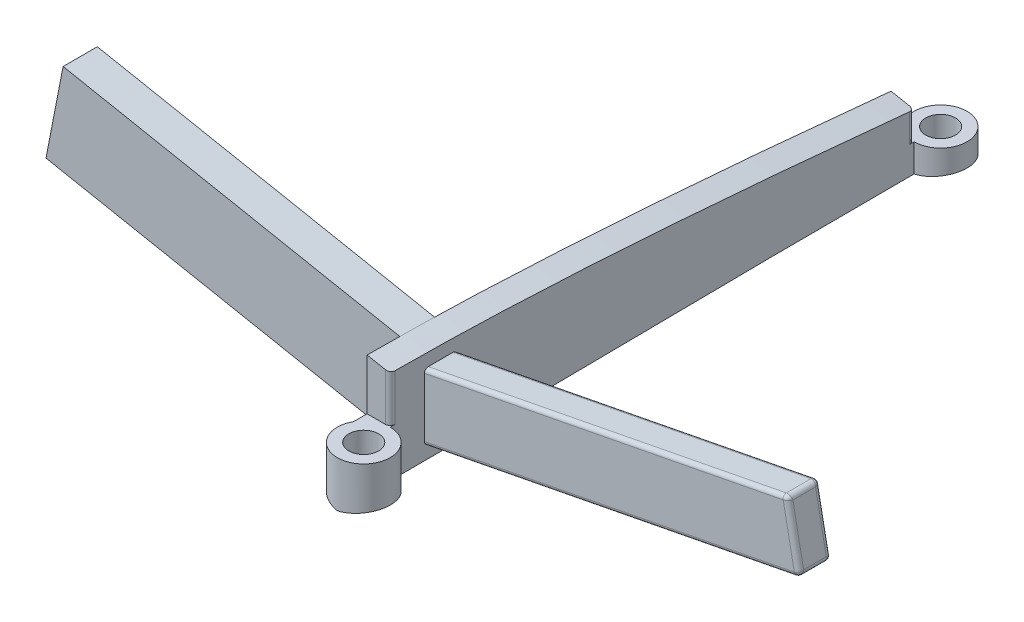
ISO-10303-21;
HEADER;
FILE_DESCRIPTION(('STEP AP214'),'2;1');
FILE_NAME('part.step','',(''),(''),'','','');
FILE_SCHEMA(('AUTOMOTIVE_DESIGN { 1 0 10303 214 1 1 1 1 }'));
ENDSEC;
DATA;
#1=APPLICATION_CONTEXT('core data for automotive mechanical design processes');
#2=APPLICATION_PROTOCOL_DEFINITION('international standard','automotive_design',2000,#1);
#3=PRODUCT_CONTEXT('',#1,'mechanical');
#4=PRODUCT('Part','Part','',(#3));
#5=PRODUCT_RELATED_PRODUCT_CATEGORY('part','',(#4));
#6=PRODUCT_DEFINITION_FORMATION('','',#4);
#7=PRODUCT_DEFINITION_CONTEXT('part definition',#1,'design');
#8=PRODUCT_DEFINITION('design','',#6,#7);
#9=PRODUCT_DEFINITION_SHAPE('','',#8);
#10=(LENGTH_UNIT() NAMED_UNIT(*) SI_UNIT(.MILLI.,.METRE.));
#11=(NAMED_UNIT(*) PLANE_ANGLE_UNIT() SI_UNIT($,.RADIAN.));
#12=(NAMED_UNIT(*) SI_UNIT($,.STERADIAN.) SOLID_ANGLE_UNIT());
#13=UNCERTAINTY_MEASURE_WITH_UNIT(LENGTH_MEASURE(1.E-05),#10,'distance_accuracy_value','');
#14=(GEOMETRIC_REPRESENTATION_CONTEXT(3) GLOBAL_UNCERTAINTY_ASSIGNED_CONTEXT((#13)) GLOBAL_UNIT_ASSIGNED_CONTEXT((#10,
#11,#12)) REPRESENTATION_CONTEXT('',''));
#15=CARTESIAN_POINT('',(0.,0.,0.));
#16=DIRECTION('',(0.,0.,1.));
#17=DIRECTION('',(1.,0.,0.));
#18=AXIS2_PLACEMENT_3D('',#15,#16,#17);
#19=CARTESIAN_POINT('',(-2.4,15.3966077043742,-60.0450652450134));
#20=DIRECTION('',(-1.,0.,0.));
#21=DIRECTION('',(0.,0.,1.));
#22=AXIS2_PLACEMENT_3D('',#19,#20,#21);
#23=PLANE('',#22);
#24=DIRECTION('',(0.,0.,-1.));
#25=VECTOR('',#24,1.);
#26=CARTESIAN_POINT('',(-2.4,11.2124816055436,-60.0450652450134));
#27=LINE('',#26,#25);
#28=CARTESIAN_POINT('',(-2.4,11.2124816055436,-31.3425721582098));
#29=VERTEX_POINT('',#28);
#30=CARTESIAN_POINT('',(-2.4,11.2124816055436,-32.75));
#31=VERTEX_POINT('',#30);
#32=EDGE_CURVE('E463',#29,#31,#27,.T.);
#33=ORIENTED_EDGE('',*,*,#32,.T.);
#34=DIRECTION('',(0.,1.,0.));
#35=VECTOR('',#34,1.);
#36=CARTESIAN_POINT('',(-2.4,15.3966077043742,-32.75));
#37=LINE('',#36,#35);
#38=CARTESIAN_POINT('',(-2.4,16.5101615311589,-32.75));
#39=VERTEX_POINT('',#38);
#40=EDGE_CURVE('E845',#31,#39,#37,.T.);
#41=ORIENTED_EDGE('',*,*,#40,.T.);
#42=CARTESIAN_POINT('',(-2.4,12.7468332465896,-90.0000000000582));
#43=CARTESIAN_POINT('',(-2.4,12.816163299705,-89.3221558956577));
#44=CARTESIAN_POINT('',(-2.4,12.9575103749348,-87.9304294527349));
#45=CARTESIAN_POINT('',(-2.4,13.1684204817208,-85.8247567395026));
#46=CARTESIAN_POINT('',(-2.4,13.378959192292,-83.6830026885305));
#47=CARTESIAN_POINT('',(-2.4,13.5862371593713,-81.5414799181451));
#48=CARTESIAN_POINT('',(-2.4,13.7889863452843,-79.4000728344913));
#49=CARTESIAN_POINT('',(-2.4,13.9880589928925,-77.2590385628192));
#50=CARTESIAN_POINT('',(-2.4,14.1820650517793,-75.118202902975));
#51=CARTESIAN_POINT('',(-2.4,14.3720567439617,-72.9777893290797));
#52=CARTESIAN_POINT('',(-2.4,14.5560981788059,-70.8375836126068));
#53=CARTESIAN_POINT('',(-2.4,14.7353834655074,-68.6977112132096));
#54=CARTESIAN_POINT('',(-2.4,14.9088029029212,-66.5582950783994));
#55=CARTESIAN_POINT('',(-2.4,15.0758725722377,-64.4193682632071));
#56=CARTESIAN_POINT('',(-2.4,15.2370186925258,-62.2810826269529));
#57=CARTESIAN_POINT('',(-2.4,15.3907723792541,-60.1432879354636));
#58=CARTESIAN_POINT('',(-2.4,15.5380370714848,-58.0061219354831));
#59=CARTESIAN_POINT('',(-2.4,15.6767051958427,-55.869449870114));
#60=CARTESIAN_POINT('',(-2.4,15.8076868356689,-53.7337136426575));
#61=CARTESIAN_POINT('',(-2.4,15.9303022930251,-51.5992388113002));
#62=CARTESIAN_POINT('',(-2.4,16.0427395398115,-49.466043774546));
#63=CARTESIAN_POINT('',(-2.4,16.1453661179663,-47.3342152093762));
#64=CARTESIAN_POINT('',(-2.4,16.2375058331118,-45.2040840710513));
#65=CARTESIAN_POINT('',(-2.4,16.3178170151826,-43.0758059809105));
#66=CARTESIAN_POINT('',(-2.4,16.3857565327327,-40.9496729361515));
#67=CARTESIAN_POINT('',(-2.4,16.4401293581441,-38.8259032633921));
#68=CARTESIAN_POINT('',(-2.4,16.4806161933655,-36.7048850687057));
#69=CARTESIAN_POINT('',(-2.4,16.50494267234,-34.5870264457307));
#70=CARTESIAN_POINT('',(-2.4,16.513260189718,-32.4727607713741));
#71=CARTESIAN_POINT('',(-2.4,16.5060173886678,-30.9442009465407));
#72=CARTESIAN_POINT('',(-2.4,16.4974100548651,-30.1204539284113));
#73=CARTESIAN_POINT('',(-2.4,16.4960507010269,-30.0000000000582));
#74=B_SPLINE_CURVE_WITH_KNOTS('',3,(#42,#43,#44,#45,#46,#47,#48,#49,#50,#51,#52,#53,#54,#55,#56,
#57,#58,#59,#60,#61,#62,#63,#64,#65,#66,#67,#68,#69,#70,#71,#72,#73),.UNSPECIFIED.,.F.,.F.,(4,1,
1,1,1,1,1,1,1,1,1,1,1,1,1,1,1,1,1,1,1,1,1,1,1,1,1,1,1,4),(0.209093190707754,0.215633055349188,
0.222519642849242,0.229404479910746,0.236288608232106,0.243169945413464,0.250049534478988,
0.256926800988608,0.263801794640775,0.270673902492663,0.277544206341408,0.284412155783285,
0.291275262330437,0.298136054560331,0.304993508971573,0.311846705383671,0.318697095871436,
0.325544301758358,0.332383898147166,0.339217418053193,0.34604697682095,0.352868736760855,
0.359681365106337,0.366488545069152,0.373285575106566,0.380071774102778,0.386849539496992,
0.393613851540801,0.400364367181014,0.401520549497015),.UNSPECIFIED.);
#75=CARTESIAN_POINT('',(-2.4,13.0254881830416,-87.25));
#76=VERTEX_POINT('',#75);
#77=EDGE_CURVE('E673',#76,#39,#74,.T.);
#78=ORIENTED_EDGE('',*,*,#77,.F.);
#79=DIRECTION('',(0.,-1.,0.));
#80=VECTOR('',#79,1.);
#81=CARTESIAN_POINT('',(-2.4,15.3966077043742,-87.25));
#82=LINE('',#81,#80);
#83=CARTESIAN_POINT('',(-2.4,9.6632470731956,-87.25));
#84=VERTEX_POINT('',#83);
#85=EDGE_CURVE('E838',#76,#84,#82,.T.);
#86=ORIENTED_EDGE('',*,*,#85,.T.);
#87=DIRECTION('',(0.,0.,-1.));
#88=VECTOR('',#87,1.);
#89=CARTESIAN_POINT('',(-2.4,9.6632470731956,-60.0450652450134));
#90=LINE('',#89,#88);
#91=CARTESIAN_POINT('',(-2.4,9.6632470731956,-88.6574278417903));
#92=VERTEX_POINT('',#91);
#93=EDGE_CURVE('E736',#84,#92,#90,.T.);
#94=ORIENTED_EDGE('',*,*,#93,.T.);
#95=DIRECTION('',(0.,-1.,0.));
#96=VECTOR('',#95,1.);
#97=CARTESIAN_POINT('',(-2.4,20.,-88.6574278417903));
#98=LINE('',#97,#96);
#99=CARTESIAN_POINT('',(-2.40000000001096,7.23118236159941,-88.6574278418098));
#100=VERTEX_POINT('',#99);
#101=EDGE_CURVE('E659',#92,#100,#98,.T.);
#102=ORIENTED_EDGE('',*,*,#101,.T.);
#103=CARTESIAN_POINT('',(-2.4,6.86555735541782,-30.0000000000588));
#104=CARTESIAN_POINT('',(-2.4,6.86044188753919,-30.5758008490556));
#105=CARTESIAN_POINT('',(-2.4,6.85095588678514,-31.8647244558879));
#106=CARTESIAN_POINT('',(-2.4,6.8431782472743,-33.8678038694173));
#107=CARTESIAN_POINT('',(-2.4,6.84111051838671,-36.0101567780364));
#108=CARTESIAN_POINT('',(-2.4,6.84526340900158,-38.154983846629));
#109=CARTESIAN_POINT('',(-2.4,6.85397680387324,-40.3021612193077));
#110=CARTESIAN_POINT('',(-2.4,6.86769360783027,-42.4518565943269));
#111=CARTESIAN_POINT('',(-2.4,6.88419188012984,-44.6037418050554));
#112=CARTESIAN_POINT('',(-2.4,6.90334023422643,-46.7572715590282));
#113=CARTESIAN_POINT('',(-2.4,6.92485650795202,-48.911960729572));
#114=CARTESIAN_POINT('',(-2.4,6.94800589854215,-51.0679480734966));
#115=CARTESIAN_POINT('',(-2.4,6.97205388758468,-53.2252207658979));
#116=CARTESIAN_POINT('',(-2.4,6.99720394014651,-55.3836004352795));
#117=CARTESIAN_POINT('',(-2.4,7.02244113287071,-57.5431336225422));
#118=CARTESIAN_POINT('',(-2.4,7.04777039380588,-59.7034378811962));
#119=CARTESIAN_POINT('',(-2.4,7.07239020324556,-61.8637877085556));
#120=CARTESIAN_POINT('',(-2.4,7.09701586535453,-64.0233276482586));
#121=CARTESIAN_POINT('',(-2.4,7.11970926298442,-66.1820202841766));
#122=CARTESIAN_POINT('',(-2.4,7.14209542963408,-68.3398787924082));
#123=CARTESIAN_POINT('',(-2.4,7.16209760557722,-70.4969199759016));
#124=CARTESIAN_POINT('',(-2.4,7.1809121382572,-72.6528510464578));
#125=CARTESIAN_POINT('',(-2.4,7.19695082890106,-74.8080905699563));
#126=CARTESIAN_POINT('',(-2.4,7.21065880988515,-76.9628769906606));
#127=CARTESIAN_POINT('',(-2.4,7.22142204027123,-79.1172617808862));
#128=CARTESIAN_POINT('',(-2.4,7.22970458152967,-81.2708174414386));
#129=CARTESIAN_POINT('',(-2.4,7.23432787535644,-83.4239557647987));
#130=CARTESIAN_POINT('',(-2.4,7.23575328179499,-85.5767180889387));
#131=CARTESIAN_POINT('',(-2.4,7.23397802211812,-87.7289957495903));
#132=CARTESIAN_POINT('',(-2.4,7.22982411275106,-89.2033220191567));
#133=CARTESIAN_POINT('',(-2.4,7.22701857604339,-89.9602036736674));
#134=CARTESIAN_POINT('',(-2.4,7.22686917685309,-90.0000000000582));
#135=B_SPLINE_CURVE_WITH_KNOTS('',3,(#103,#104,#105,#106,#107,#108,#109,#110,#111,#112,#113,
#114,#115,#116,#117,#118,#119,#120,#121,#122,#123,#124,#125,#126,#127,#128,#129,#130,#131,#132,
#133,#134),.UNSPECIFIED.,.F.,.F.,(4,1,1,1,1,1,1,1,1,1,1,1,1,1,1,1,1,1,1,1,1,1,1,1,1,1,1,1,1,4),
(0.600232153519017,0.605758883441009,0.612603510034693,0.619457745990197,0.626321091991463,
0.633189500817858,0.640066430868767,0.646954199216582,0.653843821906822,0.660736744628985,
0.667635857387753,0.674538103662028,0.681443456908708,0.688353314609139,0.695266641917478,
0.702179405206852,0.709089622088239,0.715995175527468,0.722899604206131,0.729801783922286,
0.736699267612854,0.743592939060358,0.750488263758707,0.757381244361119,0.764270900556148,
0.771158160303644,0.778047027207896,0.784933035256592,0.791815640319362,0.792197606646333),.UNSPECIFIED.);
#136=CARTESIAN_POINT('',(-2.40000000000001,6.85522833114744,-31.3425721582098));
#137=VERTEX_POINT('',#136);
#138=EDGE_CURVE('E682',#137,#100,#135,.T.);
#139=ORIENTED_EDGE('',*,*,#138,.F.);
#140=DIRECTION('',(0.,-1.,0.));
#141=VECTOR('',#140,1.);
#142=CARTESIAN_POINT('',(-2.4,20.,-31.3425721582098));
#143=LINE('',#142,#141);
#144=EDGE_CURVE('E704',#29,#137,#143,.T.);
#145=ORIENTED_EDGE('',*,*,#144,.F.);
#146=EDGE_LOOP('',(#33,#41,#78,#86,#94,#102,#139,#145));
#147=FACE_BOUND('',#146,.T.);
#148=DIRECTION('',(0.,-1.,0.));
#149=VECTOR('',#148,1.);
#150=CARTESIAN_POINT('',(-2.4,15.3966077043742,-36.22));
#151=LINE('',#150,#149);
#152=CARTESIAN_POINT('',(-2.4,16.3971066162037,-36.22));
#153=VERTEX_POINT('',#152);
#154=CARTESIAN_POINT('',(-2.4,6.90764162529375,-36.22));
#155=VERTEX_POINT('',#154);
#156=EDGE_CURVE('E263',#153,#155,#151,.T.);
#157=ORIENTED_EDGE('',*,*,#156,.T.);
#158=DIRECTION('',(0.,0.,-1.));
#159=VECTOR('',#158,1.);
#160=CARTESIAN_POINT('',(-2.4,6.90764162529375,-60.0450652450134));
#161=LINE('',#160,#159);
#162=CARTESIAN_POINT('',(-2.4,6.90764162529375,-39.78));
#163=VERTEX_POINT('',#162);
#164=EDGE_CURVE('E273',#155,#163,#161,.T.);
#165=ORIENTED_EDGE('',*,*,#164,.T.);
#166=DIRECTION('',(0.,1.,0.));
#167=VECTOR('',#166,1.);
#168=CARTESIAN_POINT('',(-2.4,15.3966077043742,-39.78));
#169=LINE('',#168,#167);
#170=CARTESIAN_POINT('',(-2.4,16.3971066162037,-39.78));
#171=VERTEX_POINT('',#170);
#172=EDGE_CURVE('E242',#163,#171,#169,.T.);
#173=ORIENTED_EDGE('',*,*,#172,.T.);
#174=DIRECTION('',(0.,0.,1.));
#175=VECTOR('',#174,1.);
#176=CARTESIAN_POINT('',(-2.4,16.3971066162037,-60.0450652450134));
#177=LINE('',#176,#175);
#178=EDGE_CURVE('E267',#171,#153,#177,.T.);
#179=ORIENTED_EDGE('',*,*,#178,.T.);
#180=EDGE_LOOP('',(#157,#165,#173,#179));
#181=FACE_BOUND('',#180,.T.);
#182=ADVANCED_FACE('F40',(#147,#181),#23,.T.);
#183=CARTESIAN_POINT('',(0.,6.6039579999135,-104.933412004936));
#184=CARTESIAN_POINT('',(39.2650873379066,14.2363178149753,-104.933412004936));
#185=CARTESIAN_POINT('',(0.,6.61651233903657,-104.217093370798));
#186=CARTESIAN_POINT('',(39.2650873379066,14.2488721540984,-104.217093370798));
#187=CARTESIAN_POINT('',(0.,6.64004096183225,-102.784140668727));
#188=CARTESIAN_POINT('',(39.2650873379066,14.2724007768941,-102.784140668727));
#189=CARTESIAN_POINT('',(0.,6.67090742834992,-100.634313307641));
#190=CARTESIAN_POINT('',(39.2650873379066,14.3032672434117,-100.634313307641));
#191=CARTESIAN_POINT('',(0.,6.69739144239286,-98.484230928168));
#192=CARTESIAN_POINT('',(39.2650873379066,14.3297512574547,-98.484230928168));
#193=CARTESIAN_POINT('',(0.,6.7198780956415,-96.3338970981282));
#194=CARTESIAN_POINT('',(39.2650873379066,14.3522379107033,-96.3338970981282));
#195=CARTESIAN_POINT('',(0.,6.7375166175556,-94.1832570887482));
#196=CARTESIAN_POINT('',(39.2650873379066,14.3698764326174,-94.1832570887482));
#197=CARTESIAN_POINT('',(0.,6.75171634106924,-92.0320636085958));
#198=CARTESIAN_POINT('',(39.2650873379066,14.3840761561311,-92.0320636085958));
#199=CARTESIAN_POINT('',(0.,6.76140292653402,-89.8806766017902));
#200=CARTESIAN_POINT('',(39.2650873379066,14.3937627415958,-89.8806766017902));
#201=CARTESIAN_POINT('',(0.,6.76746528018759,-87.7289957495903));
#202=CARTESIAN_POINT('',(39.2650873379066,14.3998250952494,-87.7289957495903));
#203=CARTESIAN_POINT('',(0.,6.76924053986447,-85.5767180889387));
#204=CARTESIAN_POINT('',(39.2650873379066,14.4016003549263,-85.5767180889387));
#205=CARTESIAN_POINT('',(0.,6.76781513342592,-83.4239557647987));
#206=CARTESIAN_POINT('',(39.2650873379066,14.4001749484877,-83.4239557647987));
#207=CARTESIAN_POINT('',(0.,6.76319183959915,-81.2708174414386));
#208=CARTESIAN_POINT('',(39.2650873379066,14.395551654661,-81.2708174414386));
#209=CARTESIAN_POINT('',(0.,6.7549092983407,-79.1172617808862));
#210=CARTESIAN_POINT('',(39.2650873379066,14.3872691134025,-79.1172617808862));
#211=CARTESIAN_POINT('',(0.,6.74414606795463,-76.9628769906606));
#212=CARTESIAN_POINT('',(39.2650873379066,14.3765058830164,-76.9628769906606));
#213=CARTESIAN_POINT('',(0.,6.73043808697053,-74.8080905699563));
#214=CARTESIAN_POINT('',(39.2650873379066,14.3627979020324,-74.8080905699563));
#215=CARTESIAN_POINT('',(0.,6.71439939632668,-72.6528510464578));
#216=CARTESIAN_POINT('',(39.2650873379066,14.3467592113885,-72.6528510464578));
#217=CARTESIAN_POINT('',(0.,6.6955848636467,-70.4969199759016));
#218=CARTESIAN_POINT('',(39.2650873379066,14.3279446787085,-70.4969199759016));
#219=CARTESIAN_POINT('',(0.,6.67558268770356,-68.3398787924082));
#220=CARTESIAN_POINT('',(39.2650873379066,14.3079425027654,-68.3398787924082));
#221=CARTESIAN_POINT('',(0.,6.65319652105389,-66.1820202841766));
#222=CARTESIAN_POINT('',(39.2650873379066,14.2855563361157,-66.1820202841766));
#223=CARTESIAN_POINT('',(0.,6.630503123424,-64.0233276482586));
#224=CARTESIAN_POINT('',(39.2650873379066,14.2628629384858,-64.0233276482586));
#225=CARTESIAN_POINT('',(0.,6.60587746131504,-61.8637877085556));
#226=CARTESIAN_POINT('',(39.2650873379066,14.2382372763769,-61.8637877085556));
#227=CARTESIAN_POINT('',(0.,6.58125765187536,-59.7034378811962));
#228=CARTESIAN_POINT('',(39.2650873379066,14.2136174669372,-59.7034378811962));
#229=CARTESIAN_POINT('',(0.,6.55592839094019,-57.5431336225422));
#230=CARTESIAN_POINT('',(39.2650873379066,14.188288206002,-57.5431336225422));
#231=CARTESIAN_POINT('',(0.,6.53069119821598,-55.3836004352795));
#232=CARTESIAN_POINT('',(39.2650873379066,14.1630510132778,-55.3836004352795));
#233=CARTESIAN_POINT('',(0.,6.50554114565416,-53.2252207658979));
#234=CARTESIAN_POINT('',(39.2650873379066,14.137900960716,-53.2252207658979));
#235=CARTESIAN_POINT('',(0.,6.48149315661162,-51.0679480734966));
#236=CARTESIAN_POINT('',(39.2650873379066,14.1138529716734,-51.0679480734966));
#237=CARTESIAN_POINT('',(0.,6.4583437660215,-48.911960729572));
#238=CARTESIAN_POINT('',(39.2650873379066,14.0907035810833,-48.911960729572));
#239=CARTESIAN_POINT('',(0.,6.43682749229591,-46.7572715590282));
#240=CARTESIAN_POINT('',(39.2650873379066,14.0691873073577,-46.7572715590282));
#241=CARTESIAN_POINT('',(0.,6.41767913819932,-44.6037418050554));
#242=CARTESIAN_POINT('',(39.2650873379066,14.0500389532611,-44.6037418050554));
#243=CARTESIAN_POINT('',(0.,6.40118086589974,-42.4518565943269));
#244=CARTESIAN_POINT('',(39.2650873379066,14.0335406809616,-42.4518565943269));
#245=CARTESIAN_POINT('',(0.,6.38746406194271,-40.3021612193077));
#246=CARTESIAN_POINT('',(39.2650873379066,14.0198238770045,-40.3021612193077));
#247=CARTESIAN_POINT('',(0.,6.37875066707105,-38.154983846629));
#248=CARTESIAN_POINT('',(39.2650873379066,14.0111104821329,-38.154983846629));
#249=CARTESIAN_POINT('',(0.,6.37459777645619,-36.0101567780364));
#250=CARTESIAN_POINT('',(39.2650873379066,14.006957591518,-36.0101567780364));
#251=CARTESIAN_POINT('',(0.,6.37666550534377,-33.8678038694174));
#252=CARTESIAN_POINT('',(39.2650873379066,14.0090253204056,-33.8678038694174));
#253=CARTESIAN_POINT('',(0.,6.38497419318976,-31.7279564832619));
#254=CARTESIAN_POINT('',(39.2650873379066,14.0173340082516,-31.7279564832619));
#255=CARTESIAN_POINT('',(0.,6.4014889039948,-29.5911127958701));
#256=CARTESIAN_POINT('',(39.2650873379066,14.0338487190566,-29.5911127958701));
#257=CARTESIAN_POINT('',(0.,6.42598325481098,-27.457663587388));
#258=CARTESIAN_POINT('',(39.2650873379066,14.0583430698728,-27.457663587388));
#259=CARTESIAN_POINT('',(0.,6.46065108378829,-25.3283788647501));
#260=CARTESIAN_POINT('',(39.2650873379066,14.0930108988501,-25.3283788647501));
#261=CARTESIAN_POINT('',(0.,6.50717609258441,-23.2036294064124));
#262=CARTESIAN_POINT('',(39.2650873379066,14.1395359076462,-23.2036294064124));
#263=CARTESIAN_POINT('',(0.,6.56589828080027,-21.0839502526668));
#264=CARTESIAN_POINT('',(39.2650873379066,14.1982580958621,-21.0839502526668));
#265=CARTESIAN_POINT('',(0.,6.64004813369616,-18.9711462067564));
#266=CARTESIAN_POINT('',(39.2650873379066,14.272407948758,-18.9711462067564));
#267=CARTESIAN_POINT('',(0.,6.71534428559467,-17.2094120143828));
#268=CARTESIAN_POINT('',(39.2650873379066,14.3477041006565,-17.2094120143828));
#269=CARTESIAN_POINT('',(0.,6.76867511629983,-16.152471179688));
#270=CARTESIAN_POINT('',(39.2650873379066,14.4010349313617,-16.152471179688));
#271=CARTESIAN_POINT('',(0.,6.78761784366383,-15.7968710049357));
#272=CARTESIAN_POINT('',(39.2650873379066,14.4199776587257,-15.7968710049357));
#273=B_SPLINE_SURFACE_WITH_KNOTS('',3,1,((#183,#184),(#185,#186),(#187,#188),(#189,#190),(#191,
#192),(#193,#194),(#195,#196),(#197,#198),(#199,#200),(#201,#202),(#203,#204),(#205,#206),(#207,
#208),(#209,#210),(#211,#212),(#213,#214),(#215,#216),(#217,#218),(#219,#220),(#221,#222),(#223,
#224),(#225,#226),(#227,#228),(#229,#230),(#231,#232),(#233,#234),(#235,#236),(#237,#238),(#239,
#240),(#241,#242),(#243,#244),(#245,#246),(#247,#248),(#249,#250),(#251,#252),(#253,#254),(#255,
#256),(#257,#258),(#259,#260),(#261,#262),(#263,#264),(#265,#266),(#267,#268),(#269,#270),(#271,
#272)),.UNSPECIFIED.,.F.,.F.,.F.,(4,1,1,1,1,1,1,1,1,1,1,1,1,1,1,1,1,1,1,1,1,1,1,1,1,1,1,1,1,1,1,
1,1,1,1,1,1,1,1,1,1,1,4),(2,2),(0.,0.0241097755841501,0.0482292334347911,0.0723549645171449,
0.0964713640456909,0.120597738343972,0.144732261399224,0.168866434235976,0.192998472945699,
0.217142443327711,0.241296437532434,0.265444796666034,0.289601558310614,0.313769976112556,
0.33794661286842,0.362117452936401,0.386301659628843,0.410502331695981,0.434710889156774,
0.45892339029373,0.483152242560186,0.50739002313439,0.531629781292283,0.555857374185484,
0.580069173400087,0.604270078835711,0.628459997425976,0.652628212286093,0.676784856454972,
0.7009349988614,0.725047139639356,0.74912940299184,0.773193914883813,0.797226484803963,
0.821225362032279,0.845206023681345,0.869139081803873,0.893026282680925,0.916871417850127,
0.940659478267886,0.964386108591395,0.988016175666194,1.),(0.,1.),.UNSPECIFIED.);
#274=CARTESIAN_POINT('',(0.,6.75352851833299,-91.55));
#275=CARTESIAN_POINT('',(0.0442391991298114,6.76212773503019,-91.5499992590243));
#276=CARTESIAN_POINT('',(0.0884555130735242,6.77073217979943,-91.5481048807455));
#277=CARTESIAN_POINT('',(0.176572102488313,6.78789876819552,-91.5405453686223));
#278=CARTESIAN_POINT('',(0.220472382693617,6.79646091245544,-91.5348802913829));
#279=CARTESIAN_POINT('',(0.351201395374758,6.82198672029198,-91.5122700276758));
#280=CARTESIAN_POINT('',(0.437155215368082,6.83880859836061,-91.4897097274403));
#281=CARTESIAN_POINT('',(0.604116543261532,6.8715607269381,-91.4301795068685));
#282=CARTESIAN_POINT('',(0.685120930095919,6.88749041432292,-91.3932006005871));
#283=CARTESIAN_POINT('',(0.839794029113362,6.91798463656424,-91.3058055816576));
#284=CARTESIAN_POINT('',(0.913465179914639,6.93254962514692,-91.2553939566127));
#285=CARTESIAN_POINT('',(1.05070884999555,6.95976348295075,-91.1429431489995));
#286=CARTESIAN_POINT('',(1.11435828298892,6.97242690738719,-91.0810013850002));
#287=CARTESIAN_POINT('',(1.23032574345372,6.9955861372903,-90.9469179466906));
#288=CARTESIAN_POINT('',(1.2826429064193,7.00608177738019,-90.8747754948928));
#289=CARTESIAN_POINT('',(1.37345257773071,7.0244005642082,-90.7237110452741));
#290=CARTESIAN_POINT('',(1.4121732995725,7.03226770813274,-90.6449315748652));
#291=CARTESIAN_POINT('',(1.47582142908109,7.04532739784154,-90.4817833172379));
#292=CARTESIAN_POINT('',(1.5007511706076,7.05052039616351,-90.3974154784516));
#293=CARTESIAN_POINT('',(1.53570956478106,7.05799820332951,-90.2270109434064));
#294=CARTESIAN_POINT('',(1.54598236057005,7.06033056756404,-90.1410263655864));
#295=CARTESIAN_POINT('',(1.55208158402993,7.06217130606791,-89.9685172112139));
#296=CARTESIAN_POINT('',(1.54790860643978,7.06167979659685,-89.8819926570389));
#297=CARTESIAN_POINT('',(1.52533955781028,7.05790504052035,-89.711625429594));
#298=CARTESIAN_POINT('',(1.50706355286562,7.05464533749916,-89.6277663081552));
#299=CARTESIAN_POINT('',(1.45701158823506,7.04547091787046,-89.4643468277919));
#300=CARTESIAN_POINT('',(1.42523561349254,7.03955619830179,-89.3847864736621));
#301=CARTESIAN_POINT('',(1.34898007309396,7.02522320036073,-89.2318381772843));
#302=CARTESIAN_POINT('',(1.30445410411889,7.01679577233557,-89.1584740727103));
#303=CARTESIAN_POINT('',(1.22926591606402,7.00249345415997,-89.0548899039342));
#304=CARTESIAN_POINT('',(1.20279693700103,6.99744793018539,-89.0214325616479));
#305=CARTESIAN_POINT('',(1.14721562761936,6.98683366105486,-88.9568253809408));
#306=CARTESIAN_POINT('',(1.11810093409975,6.98126444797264,-88.9256776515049));
#307=CARTESIAN_POINT('',(1.02631942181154,6.96368217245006,-88.8352694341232));
#308=CARTESIAN_POINT('',(0.959856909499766,6.95091657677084,-88.7799269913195));
#309=CARTESIAN_POINT('',(0.818890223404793,6.92378361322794,-88.6811640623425));
#310=CARTESIAN_POINT('',(0.744385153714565,6.90941606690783,-88.6377449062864));
#311=CARTESIAN_POINT('',(0.627479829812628,6.88683705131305,-88.5820132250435));
#312=CARTESIAN_POINT('',(0.587233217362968,6.8790580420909,-88.564882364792));
#313=CARTESIAN_POINT('',(0.505522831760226,6.86325390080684,-88.5341032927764));
#314=CARTESIAN_POINT('',(0.464060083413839,6.85522897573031,-88.5204522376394));
#315=CARTESIAN_POINT('',(0.338282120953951,6.8308700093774,-88.4848664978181));
#316=CARTESIAN_POINT('',(0.25242835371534,6.81422302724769,-88.4682285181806));
#317=CARTESIAN_POINT('',(0.138375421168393,6.7920838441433,-88.4559377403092));
#318=CARTESIAN_POINT('',(0.11072090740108,6.78671386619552,-88.4537098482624));
#319=CARTESIAN_POINT('',(0.0553823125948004,6.7759644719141,-88.4507433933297));
#320=CARTESIAN_POINT('',(0.0276983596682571,6.77058508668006,-88.4500023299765));
#321=CARTESIAN_POINT('',(0.,6.76520107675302,-88.45));
#322=B_SPLINE_CURVE_WITH_KNOTS('',3,(#274,#275,#276,#277,#278,#279,#280,#281,#282,#283,#284,
#285,#286,#287,#288,#289,#290,#291,#292,#293,#294,#295,#296,#297,#298,#299,#300,#301,#302,#303,
#304,#305,#306,#307,#308,#309,#310,#311,#312,#313,#314,#315,#316,#317,#318,#319,#320,#321),
.UNSPECIFIED.,.F.,.F.,(4,2,2,2,2,2,2,2,2,2,2,2,2,2,2,2,2,2,2,2,2,2,2,4),(0.,0.135119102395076,
0.270236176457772,0.540177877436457,0.810288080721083,1.08030815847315,1.34814263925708,
1.61599754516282,1.87911348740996,2.14218488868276,2.40082095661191,2.65944637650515,
2.91589395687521,3.17234182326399,3.42973515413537,3.55848536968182,3.68735173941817,
3.94833872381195,4.20935481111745,4.34249640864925,4.47552886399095,4.74109776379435,
4.82585095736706,4.91046149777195),.UNSPECIFIED.);
#323=CARTESIAN_POINT('',(0.,6.75352851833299,-91.55));
#324=VERTEX_POINT('',#323);
#325=CARTESIAN_POINT('',(0.,6.76520107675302,-88.45));
#326=VERTEX_POINT('',#325);
#327=EDGE_CURVE('E323',#324,#326,#322,.T.);
#328=CARTESIAN_POINT('',(0.,6.6039579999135,-104.933412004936));
#329=CARTESIAN_POINT('',(0.,6.61651233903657,-104.217093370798));
#330=CARTESIAN_POINT('',(0.,6.64004096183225,-102.784140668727));
#331=CARTESIAN_POINT('',(0.,6.67090742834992,-100.634313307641));
#332=CARTESIAN_POINT('',(0.,6.69739144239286,-98.484230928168));
#333=CARTESIAN_POINT('',(0.,6.7198780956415,-96.3338970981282));
#334=CARTESIAN_POINT('',(0.,6.7375166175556,-94.1832570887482));
#335=CARTESIAN_POINT('',(0.,6.75171634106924,-92.0320636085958));
#336=CARTESIAN_POINT('',(0.,6.76140292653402,-89.8806766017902));
#337=CARTESIAN_POINT('',(0.,6.76746528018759,-87.7289957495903));
#338=CARTESIAN_POINT('',(0.,6.76924053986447,-85.5767180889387));
#339=CARTESIAN_POINT('',(0.,6.76781513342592,-83.4239557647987));
#340=CARTESIAN_POINT('',(0.,6.76319183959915,-81.2708174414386));
#341=CARTESIAN_POINT('',(0.,6.7549092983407,-79.1172617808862));
#342=CARTESIAN_POINT('',(0.,6.74414606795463,-76.9628769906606));
#343=CARTESIAN_POINT('',(0.,6.73043808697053,-74.8080905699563));
#344=CARTESIAN_POINT('',(0.,6.71439939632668,-72.6528510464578));
#345=CARTESIAN_POINT('',(0.,6.6955848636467,-70.4969199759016));
#346=CARTESIAN_POINT('',(0.,6.67558268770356,-68.3398787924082));
#347=CARTESIAN_POINT('',(0.,6.65319652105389,-66.1820202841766));
#348=CARTESIAN_POINT('',(0.,6.630503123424,-64.0233276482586));
#349=CARTESIAN_POINT('',(0.,6.60587746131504,-61.8637877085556));
#350=CARTESIAN_POINT('',(0.,6.58125765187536,-59.7034378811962));
#351=CARTESIAN_POINT('',(0.,6.55592839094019,-57.5431336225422));
#352=CARTESIAN_POINT('',(0.,6.53069119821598,-55.3836004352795));
#353=CARTESIAN_POINT('',(0.,6.50554114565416,-53.2252207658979));
#354=CARTESIAN_POINT('',(0.,6.48149315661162,-51.0679480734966));
#355=CARTESIAN_POINT('',(0.,6.4583437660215,-48.911960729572));
#356=CARTESIAN_POINT('',(0.,6.43682749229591,-46.7572715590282));
#357=CARTESIAN_POINT('',(0.,6.41767913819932,-44.6037418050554));
#358=CARTESIAN_POINT('',(0.,6.40118086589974,-42.4518565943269));
#359=CARTESIAN_POINT('',(0.,6.38746406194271,-40.3021612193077));
#360=CARTESIAN_POINT('',(0.,6.37875066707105,-38.154983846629));
#361=CARTESIAN_POINT('',(0.,6.37459777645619,-36.0101567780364));
#362=CARTESIAN_POINT('',(0.,6.37666550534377,-33.8678038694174));
#363=CARTESIAN_POINT('',(0.,6.38497419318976,-31.7279564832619));
#364=CARTESIAN_POINT('',(0.,6.4014889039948,-29.5911127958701));
#365=CARTESIAN_POINT('',(0.,6.42598325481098,-27.457663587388));
#366=CARTESIAN_POINT('',(0.,6.46065108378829,-25.3283788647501));
#367=CARTESIAN_POINT('',(0.,6.50717609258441,-23.2036294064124));
#368=CARTESIAN_POINT('',(0.,6.56589828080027,-21.0839502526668));
#369=CARTESIAN_POINT('',(0.,6.64004813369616,-18.9711462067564));
#370=CARTESIAN_POINT('',(0.,6.71534428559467,-17.2094120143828));
#371=CARTESIAN_POINT('',(0.,6.76867511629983,-16.152471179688));
#372=CARTESIAN_POINT('',(0.,6.78761784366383,-15.7968710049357));
#373=B_SPLINE_CURVE_WITH_KNOTS('',3,(#328,#329,#330,#331,#332,#333,#334,#335,#336,#337,#338,
#339,#340,#341,#342,#343,#344,#345,#346,#347,#348,#349,#350,#351,#352,#353,#354,#355,#356,#357,
#358,#359,#360,#361,#362,#363,#364,#365,#366,#367,#368,#369,#370,#371,#372),.UNSPECIFIED.,.F.,
.F.,(4,1,1,1,1,1,1,1,1,1,1,1,1,1,1,1,1,1,1,1,1,1,1,1,1,1,1,1,1,1,1,1,1,1,1,1,1,1,1,1,1,1,4),
(0.554771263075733,0.5616475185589,0.568526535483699,0.575407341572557,0.582285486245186,
0.589166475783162,0.596049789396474,0.602933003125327,0.609815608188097,0.616701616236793,
0.623590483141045,0.630477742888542,0.63736739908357,0.644260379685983,0.651155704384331,
0.658049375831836,0.664946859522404,0.671849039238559,0.678753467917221,0.68565902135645,
0.692569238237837,0.699482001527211,0.70639532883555,0.713305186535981,0.720210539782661,
0.727112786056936,0.734011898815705,0.740904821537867,0.747794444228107,0.754682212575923,
0.761559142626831,0.768427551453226,0.775290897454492,0.782145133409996,0.788989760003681,
0.795829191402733,0.802655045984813,0.80946782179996,0.8162686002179,0.823053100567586,
0.829820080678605,0.836559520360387,0.839977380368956),.UNSPECIFIED.);
#374=CARTESIAN_POINT('',(0.,6.74673344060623,-92.7500000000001));
#375=VERTEX_POINT('',#374);
#376=EDGE_CURVE('E372',#375,#324,#373,.T.);
#377=CARTESIAN_POINT('',(0.,6.76751870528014,-87.25));
#378=CARTESIAN_POINT('',(0.0783962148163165,6.78275733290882,-87.249993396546));
#379=CARTESIAN_POINT('',(0.156790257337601,6.79799098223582,-87.2533523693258));
#380=CARTESIAN_POINT('',(0.313027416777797,6.82834170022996,-87.2667506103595));
#381=CARTESIAN_POINT('',(0.39087053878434,6.8434587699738,-87.2767898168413));
#382=CARTESIAN_POINT('',(0.545449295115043,6.87346776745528,-87.303495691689));
#383=CARTESIAN_POINT('',(0.622185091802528,6.88835972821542,-87.320161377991));
#384=CARTESIAN_POINT('',(0.773989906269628,6.91780905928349,-87.3599988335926));
#385=CARTESIAN_POINT('',(0.849058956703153,6.93236643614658,-87.3831704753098));
#386=CARTESIAN_POINT('',(1.07106350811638,6.97539867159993,-87.4622927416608));
#387=CARTESIAN_POINT('',(1.21483176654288,7.00324050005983,-87.5278568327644));
#388=CARTESIAN_POINT('',(1.48927727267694,7.05632265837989,-87.6828014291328));
#389=CARTESIAN_POINT('',(1.61995907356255,7.08156389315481,-87.7721736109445));
#390=CARTESIAN_POINT('',(1.86336564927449,7.12848808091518,-87.9714839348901));
#391=CARTESIAN_POINT('',(1.97623872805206,7.15020047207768,-88.0812336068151));
#392=CARTESIAN_POINT('',(2.18191764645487,7.18964584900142,-88.3188031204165));
#393=CARTESIAN_POINT('',(2.27472196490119,7.20737853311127,-88.446624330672));
#394=CARTESIAN_POINT('',(2.43581789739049,7.23800025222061,-88.7142169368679));
#395=CARTESIAN_POINT('',(2.50452291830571,7.25097117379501,-88.8537300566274));
#396=CARTESIAN_POINT('',(2.6175346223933,7.27208813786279,-89.1426415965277));
#397=CARTESIAN_POINT('',(2.66184541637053,7.28023499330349,-89.2920383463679));
#398=CARTESIAN_POINT('',(2.72413103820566,7.2913425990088,-89.5938413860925));
#399=CARTESIAN_POINT('',(2.7425264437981,7.29438632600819,-89.7461579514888));
#400=CARTESIAN_POINT('',(2.75375954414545,7.29544690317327,-90.0517521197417));
#401=CARTESIAN_POINT('',(2.74659813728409,7.29346393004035,-90.2050296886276));
#402=CARTESIAN_POINT('',(2.70711757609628,7.28456889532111,-90.5069997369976));
#403=CARTESIAN_POINT('',(2.67498157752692,7.27769274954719,-90.6557174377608));
#404=CARTESIAN_POINT('',(2.58673611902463,7.25925858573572,-90.9456341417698));
#405=CARTESIAN_POINT('',(2.53062645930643,7.24770052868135,-91.0868330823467));
#406=CARTESIAN_POINT('',(2.42972283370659,7.22711233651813,-91.2902502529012));
#407=CARTESIAN_POINT('',(2.39316406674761,7.21968066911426,-91.3568451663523));
#408=CARTESIAN_POINT('',(2.31472859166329,7.20378856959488,-91.4866995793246));
#409=CARTESIAN_POINT('',(2.27285302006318,7.19532835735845,-91.5499597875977));
#410=CARTESIAN_POINT('',(2.18410766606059,7.1774460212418,-91.6726946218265));
#411=CARTESIAN_POINT('',(2.13723960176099,7.1680242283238,-91.7321705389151));
#412=CARTESIAN_POINT('',(2.03881359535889,7.14828143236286,-91.8470164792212));
#413=CARTESIAN_POINT('',(1.98725145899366,7.13795962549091,-91.9023827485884));
#414=CARTESIAN_POINT('',(1.82457014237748,7.10545659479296,-92.0632200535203));
#415=CARTESIAN_POINT('',(1.70668207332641,7.08198490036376,-92.1617356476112));
#416=CARTESIAN_POINT('',(1.45655375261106,7.03235179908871,-92.3375908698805));
#417=CARTESIAN_POINT('',(1.32431191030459,7.00619009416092,-92.414928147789));
#418=CARTESIAN_POINT('',(1.11675764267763,6.96525185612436,-92.5142417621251));
#419=CARTESIAN_POINT('',(1.04528878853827,6.9511756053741,-92.5447797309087));
#420=CARTESIAN_POINT('',(0.900137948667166,6.92262838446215,-92.5996653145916));
#421=CARTESIAN_POINT('',(0.826457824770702,6.90815774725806,-92.6240179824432));
#422=CARTESIAN_POINT('',(0.67743157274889,6.87893031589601,-92.6663805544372));
#423=CARTESIAN_POINT('',(0.602086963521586,6.8641737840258,-92.6843960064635));
#424=CARTESIAN_POINT('',(0.450196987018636,6.83446644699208,-92.7140017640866));
#425=CARTESIAN_POINT('',(0.37365194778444,6.81951569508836,-92.725593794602));
#426=CARTESIAN_POINT('',(0.247458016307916,6.79490100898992,-92.7392931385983));
#427=CARTESIAN_POINT('',(0.198003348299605,6.78526301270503,-92.7433108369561));
#428=CARTESIAN_POINT('',(0.0990346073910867,6.76599214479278,-92.7486622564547));
#429=CARTESIAN_POINT('',(0.0495207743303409,6.75635929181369,-92.7500004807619));
#430=CARTESIAN_POINT('',(0.,6.74673344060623,-92.75));
#431=B_SPLINE_CURVE_WITH_KNOTS('',3,(#377,#378,#379,#380,#381,#382,#383,#384,#385,#386,#387,
#388,#389,#390,#391,#392,#393,#394,#395,#396,#397,#398,#399,#400,#401,#402,#403,#404,#405,#406,
#407,#408,#409,#410,#411,#412,#413,#414,#415,#416,#417,#418,#419,#420,#421,#422,#423,#424,#425,
#426,#427,#428,#429,#430),.UNSPECIFIED.,.F.,.F.,(4,2,2,2,2,2,2,2,2,2,2,2,2,2,2,2,2,2,2,2,2,2,2,
2,2,2,4),(0.,0.239514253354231,0.479026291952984,0.718502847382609,0.957974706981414,
1.43681020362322,1.91547851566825,2.38992225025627,2.86440193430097,3.3302906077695,
3.79610074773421,4.25426063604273,4.71240441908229,5.16721966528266,5.62203870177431,
5.85081771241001,6.07954790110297,6.30819962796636,6.53705770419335,7.00101282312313,
7.4650194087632,7.70174120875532,7.93826899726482,8.17458920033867,8.41084591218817,
8.56241512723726,8.71372939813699),.UNSPECIFIED.);
#432=CARTESIAN_POINT('',(0.,6.76751870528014,-87.2499999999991));
#433=VERTEX_POINT('',#432);
#434=EDGE_CURVE('E351',#433,#375,#431,.T.);
#435=EDGE_CURVE('E724',#326,#433,#373,.T.);
#436=ORIENTED_EDGE('',*,*,#327,.F.);
#437=ORIENTED_EDGE('',*,*,#376,.F.);
#438=ORIENTED_EDGE('',*,*,#434,.F.);
#439=ORIENTED_EDGE('',*,*,#435,.F.);
#440=EDGE_LOOP('',(#436,#437,#438,#439));
#441=FACE_BOUND('',#440,.T.);
#442=ADVANCED_FACE('F333',(#441),#273,.F.);
#443=CARTESIAN_POINT('',(0.,6.38740647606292,-31.55));
#444=CARTESIAN_POINT('',(0.0442479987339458,6.39600745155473,-31.5499992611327));
#445=CARTESIAN_POINT('',(0.0884727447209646,6.40461544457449,-31.5481041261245));
#446=CARTESIAN_POINT('',(0.176605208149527,6.42179304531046,-31.5405418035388));
#447=CARTESIAN_POINT('',(0.220512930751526,6.43036265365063,-31.5348746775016));
#448=CARTESIAN_POINT('',(0.351261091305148,6.45591695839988,-31.5122569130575));
#449=CARTESIAN_POINT('',(0.437224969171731,6.47276627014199,-31.4896898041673));
#450=CARTESIAN_POINT('',(0.604200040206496,6.50559729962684,-31.4301447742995));
#451=CARTESIAN_POINT('',(0.685208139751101,6.52157847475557,-31.3931579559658));
#452=CARTESIAN_POINT('',(0.839882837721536,6.55221102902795,-31.3057487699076));
#453=CARTESIAN_POINT('',(0.913551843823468,6.56686284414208,-31.2553308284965));
#454=CARTESIAN_POINT('',(1.05080524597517,6.59430189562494,-31.1428563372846));
#455=CARTESIAN_POINT('',(1.11446400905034,6.60710281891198,-31.0808938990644));
#456=CARTESIAN_POINT('',(1.23044164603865,6.63059684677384,-30.9467691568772));
#457=CARTESIAN_POINT('',(1.28275961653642,6.64128978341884,-30.8746060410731));
#458=CARTESIAN_POINT('',(1.37358936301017,6.66007419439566,-30.7234591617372));
#459=CARTESIAN_POINT('',(1.41232254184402,6.66820714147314,-30.6446136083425));
#460=CARTESIAN_POINT('',(1.47597481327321,6.68186782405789,-30.481325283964));
#461=CARTESIAN_POINT('',(1.50089619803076,6.68739599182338,-30.396883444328));
#462=CARTESIAN_POINT('',(1.53582040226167,6.69560631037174,-30.2262974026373));
#463=CARTESIAN_POINT('',(1.54606324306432,6.69833403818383,-30.1402044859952));
#464=CARTESIAN_POINT('',(1.55206612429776,6.7010190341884,-29.9674729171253));
#465=CARTESIAN_POINT('',(1.54782678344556,6.70097642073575,-29.8808342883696));
#466=CARTESIAN_POINT('',(1.52508881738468,6.69813341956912,-29.7102766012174));
#467=CARTESIAN_POINT('',(1.5067165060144,6.69535740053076,-29.6263402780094));
#468=CARTESIAN_POINT('',(1.45643855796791,6.68716873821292,-29.4627744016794));
#469=CARTESIAN_POINT('',(1.42453298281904,6.68175610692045,-29.3831448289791));
#470=CARTESIAN_POINT('',(1.34802676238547,6.66843191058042,-29.2301639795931));
#471=CARTESIAN_POINT('',(1.30339383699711,6.66051398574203,-29.1568292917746));
#472=CARTESIAN_POINT('',(1.22804188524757,6.64695593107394,-29.0532991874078));
#473=CARTESIAN_POINT('',(1.20151782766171,6.64215522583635,-29.0198616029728));
#474=CARTESIAN_POINT('',(1.14582575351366,6.63202105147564,-28.9552981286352));
#475=CARTESIAN_POINT('',(1.1166553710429,6.62668710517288,-28.924174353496));
#476=CARTESIAN_POINT('',(1.02478148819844,6.60981101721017,-28.833920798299));
#477=CARTESIAN_POINT('',(0.95829502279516,6.59749889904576,-28.7787042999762));
#478=CARTESIAN_POINT('',(0.817310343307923,6.57119800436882,-28.6801885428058));
#479=CARTESIAN_POINT('',(0.74281125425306,6.55720904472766,-28.6368905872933));
#480=CARTESIAN_POINT('',(0.625963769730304,6.53513271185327,-28.5813451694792));
#481=CARTESIAN_POINT('',(0.585756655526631,6.5275138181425,-28.5642810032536));
#482=CARTESIAN_POINT('',(0.504136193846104,6.51200279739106,-28.5336277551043));
#483=CARTESIAN_POINT('',(0.462723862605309,6.50411089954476,-28.520035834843));
#484=CARTESIAN_POINT('',(0.337113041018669,6.4801070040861,-28.4846137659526));
#485=CARTESIAN_POINT('',(0.251392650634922,6.46363883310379,-28.4680671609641));
#486=CARTESIAN_POINT('',(0.137635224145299,6.44166982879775,-28.4558742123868));
#487=CARTESIAN_POINT('',(0.110126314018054,6.43634853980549,-28.4536700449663));
#488=CARTESIAN_POINT('',(0.0550825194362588,6.42568360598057,-28.4507353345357));
#489=CARTESIAN_POINT('',(0.0275477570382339,6.4203400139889,-28.450002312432));
#490=CARTESIAN_POINT('',(0.,6.41498529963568,-28.45));
#491=B_SPLINE_CURVE_WITH_KNOTS('',3,(#443,#444,#445,#446,#447,#448,#449,#450,#451,#452,#453,
#454,#455,#456,#457,#458,#459,#460,#461,#462,#463,#464,#465,#466,#467,#468,#469,#470,#471,#472,
#473,#474,#475,#476,#477,#478,#479,#480,#481,#482,#483,#484,#485,#486,#487,#488,#489,#490),
.UNSPECIFIED.,.F.,.F.,(4,2,2,2,2,2,2,2,2,2,2,2,2,2,2,2,2,2,2,2,2,2,2,4),(0.,0.135145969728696,
0.270289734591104,0.540280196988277,0.81043751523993,1.08050591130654,1.348462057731,
1.61643954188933,1.87982088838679,2.14315851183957,2.40213892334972,2.66110827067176,
2.91778958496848,3.17446973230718,3.43180677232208,3.56052819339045,3.68936585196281,
3.94997369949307,4.21061003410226,4.34348425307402,4.47624950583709,4.74128712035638,
4.82557998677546,4.90973068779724),.UNSPECIFIED.);
#492=CARTESIAN_POINT('',(0.,6.38740647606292,-31.55));
#493=VERTEX_POINT('',#492);
#494=CARTESIAN_POINT('',(0.,6.41498529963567,-28.45));
#495=VERTEX_POINT('',#494);
#496=EDGE_CURVE('E287',#493,#495,#491,.T.);
#497=CARTESIAN_POINT('',(0.,6.38131442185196,-32.75));
#498=VERTEX_POINT('',#497);
#499=EDGE_CURVE('E373',#498,#493,#373,.T.);
#500=CARTESIAN_POINT('',(0.,6.43061970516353,-27.25));
#501=CARTESIAN_POINT('',(0.078263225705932,6.44583279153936,-27.2499933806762));
#502=CARTESIAN_POINT('',(0.156532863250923,6.46099866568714,-27.2533410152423));
#503=CARTESIAN_POINT('',(0.312540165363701,6.49113193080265,-27.2666981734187));
#504=CARTESIAN_POINT('',(0.390277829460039,6.5060993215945,-27.2767077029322));
#505=CARTESIAN_POINT('',(0.544668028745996,6.53572995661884,-27.3033406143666));
#506=CARTESIAN_POINT('',(0.62132067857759,6.55039323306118,-27.319963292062));
#507=CARTESIAN_POINT('',(0.772977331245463,6.57931008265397,-27.3597046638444));
#508=CARTESIAN_POINT('',(0.847981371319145,6.59356366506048,-27.3828232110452));
#509=CARTESIAN_POINT('',(1.06982403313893,6.63558085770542,-27.4617784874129));
#510=CARTESIAN_POINT('',(1.21352063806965,6.6626061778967,-27.5272195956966));
#511=CARTESIAN_POINT('',(1.48786851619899,6.7138378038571,-27.6819040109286));
#512=CARTESIAN_POINT('',(1.61852463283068,6.73804515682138,-27.7711384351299));
#513=CARTESIAN_POINT('',(1.86179391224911,6.78275210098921,-27.9700606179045));
#514=CARTESIAN_POINT('',(1.97457121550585,6.80328567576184,-28.0795395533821));
#515=CARTESIAN_POINT('',(2.18012863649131,6.84033285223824,-28.3165085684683));
#516=CARTESIAN_POINT('',(2.27290705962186,6.85684611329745,-28.4440001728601));
#517=CARTESIAN_POINT('',(2.4340771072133,6.88510398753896,-28.7109501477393));
#518=CARTESIAN_POINT('',(2.50286932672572,6.89692743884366,-28.8501583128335));
#519=CARTESIAN_POINT('',(2.61613570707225,6.91586158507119,-29.1384273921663));
#520=CARTESIAN_POINT('',(2.6606137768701,6.92297303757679,-29.287486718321));
#521=CARTESIAN_POINT('',(2.72338455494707,6.93219825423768,-29.5888732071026));
#522=CARTESIAN_POINT('',(2.74205267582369,6.93438396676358,-29.7411200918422));
#523=CARTESIAN_POINT('',(2.75384906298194,6.9339061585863,-30.0465968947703));
#524=CARTESIAN_POINT('',(2.74697796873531,6.9312427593,-30.1998267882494));
#525=CARTESIAN_POINT('',(2.70806424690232,6.9211820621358,-30.5019673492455));
#526=CARTESIAN_POINT('',(2.67616722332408,6.9138121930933,-30.6508978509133));
#527=CARTESIAN_POINT('',(2.588337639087,6.89457001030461,-30.9412668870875));
#528=CARTESIAN_POINT('',(2.53240480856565,6.88269764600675,-31.0827053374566));
#529=CARTESIAN_POINT('',(2.43170049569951,6.86175302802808,-31.2865257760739));
#530=CARTESIAN_POINT('',(2.39518777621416,6.85421968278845,-31.3532760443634));
#531=CARTESIAN_POINT('',(2.31682182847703,6.83815889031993,-31.4834413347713));
#532=CARTESIAN_POINT('',(2.27496974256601,6.82963165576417,-31.5468570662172));
#533=CARTESIAN_POINT('',(2.18624883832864,6.81164530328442,-31.6699004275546));
#534=CARTESIAN_POINT('',(2.13938176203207,6.80218650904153,-31.7295293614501));
#535=CARTESIAN_POINT('',(2.0409354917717,6.78239418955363,-31.8446765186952));
#536=CARTESIAN_POINT('',(1.98935207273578,6.77205988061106,-31.9001909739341));
#537=CARTESIAN_POINT('',(1.82664825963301,6.7395621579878,-32.0613913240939));
#538=CARTESIAN_POINT('',(1.70873790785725,6.71613961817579,-32.1601221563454));
#539=CARTESIAN_POINT('',(1.45851007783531,6.66663695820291,-32.3363809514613));
#540=CARTESIAN_POINT('',(1.32619108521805,6.64055655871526,-32.4139066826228));
#541=CARTESIAN_POINT('',(1.11855489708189,6.5997472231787,-32.5134430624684));
#542=CARTESIAN_POINT('',(1.04709803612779,6.58572216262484,-32.5440361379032));
#543=CARTESIAN_POINT('',(0.901966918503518,6.55727168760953,-32.5990316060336));
#544=CARTESIAN_POINT('',(0.828294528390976,6.54284661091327,-32.6234390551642));
#545=CARTESIAN_POINT('',(0.679279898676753,6.51370091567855,-32.6659105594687));
#546=CARTESIAN_POINT('',(0.60393916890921,6.49898056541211,-32.6839801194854));
#547=CARTESIAN_POINT('',(0.452054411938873,6.46933368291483,-32.7136932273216));
#548=CARTESIAN_POINT('',(0.375510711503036,6.45440720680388,-32.7253384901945));
#549=CARTESIAN_POINT('',(0.249009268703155,6.42976116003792,-32.739158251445));
#550=CARTESIAN_POINT('',(0.199244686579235,6.42007128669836,-32.7432266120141));
#551=CARTESIAN_POINT('',(0.099655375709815,6.40069098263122,-32.7486454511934));
#552=CARTESIAN_POINT('',(0.0498308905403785,6.39100058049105,-32.7500005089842));
#553=CARTESIAN_POINT('',(0.,6.38131442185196,-32.75));
#554=B_SPLINE_CURVE_WITH_KNOTS('',3,(#500,#501,#502,#503,#504,#505,#506,#507,#508,#509,#510,
#511,#512,#513,#514,#515,#516,#517,#518,#519,#520,#521,#522,#523,#524,#525,#526,#527,#528,#529,
#530,#531,#532,#533,#534,#535,#536,#537,#538,#539,#540,#541,#542,#543,#544,#545,#546,#547,#548,
#549,#550,#551,#552,#553),.UNSPECIFIED.,.F.,.F.,(4,2,2,2,2,2,2,2,2,2,2,2,2,2,2,2,2,2,2,2,2,2,2,
2,2,2,4),(0.,0.239108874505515,0.478217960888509,0.717301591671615,0.956379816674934,
1.43445231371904,1.91234658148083,2.38556156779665,2.85881663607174,3.32373958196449,
3.78858776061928,4.24660082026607,4.70460241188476,5.15995887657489,5.61532045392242,
5.84446941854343,6.07356943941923,6.30259013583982,6.53181804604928,6.99620583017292,
7.46064246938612,7.69736830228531,7.93389999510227,8.17022573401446,8.4064883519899,
8.55900768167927,8.71126939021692),.UNSPECIFIED.);
#555=CARTESIAN_POINT('',(0.,6.43061970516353,-27.2499999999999));
#556=VERTEX_POINT('',#555);
#557=EDGE_CURVE('E361',#556,#498,#554,.T.);
#558=EDGE_CURVE('E410',#495,#556,#373,.T.);
#559=ORIENTED_EDGE('',*,*,#496,.F.);
#560=ORIENTED_EDGE('',*,*,#499,.F.);
#561=ORIENTED_EDGE('',*,*,#557,.F.);
#562=ORIENTED_EDGE('',*,*,#558,.F.);
#563=EDGE_LOOP('',(#559,#560,#561,#562));
#564=FACE_BOUND('',#563,.T.);
#565=ADVANCED_FACE('F339',(#564),#273,.F.);
#566=CARTESIAN_POINT('',(0.,6.6039579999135,-104.933412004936));
#567=CARTESIAN_POINT('',(-39.2650873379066,14.236317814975,-104.933412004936));
#568=CARTESIAN_POINT('',(0.,6.61651233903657,-104.217093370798));
#569=CARTESIAN_POINT('',(-39.2650873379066,14.2488721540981,-104.217093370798));
#570=CARTESIAN_POINT('',(0.,6.64004096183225,-102.784140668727));
#571=CARTESIAN_POINT('',(-39.2650873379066,14.2724007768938,-102.784140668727));
#572=CARTESIAN_POINT('',(0.,6.67090742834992,-100.634313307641));
#573=CARTESIAN_POINT('',(-39.2650873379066,14.3032672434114,-100.634313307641));
#574=CARTESIAN_POINT('',(0.,6.69739144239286,-98.484230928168));
#575=CARTESIAN_POINT('',(-39.2650873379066,14.3297512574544,-98.484230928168));
#576=CARTESIAN_POINT('',(0.,6.7198780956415,-96.3338970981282));
#577=CARTESIAN_POINT('',(-39.2650873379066,14.352237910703,-96.3338970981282));
#578=CARTESIAN_POINT('',(0.,6.7375166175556,-94.1832570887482));
#579=CARTESIAN_POINT('',(-39.2650873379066,14.3698764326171,-94.1832570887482));
#580=CARTESIAN_POINT('',(0.,6.75171634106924,-92.0320636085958));
#581=CARTESIAN_POINT('',(-39.2650873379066,14.3840761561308,-92.0320636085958));
#582=CARTESIAN_POINT('',(0.,6.76140292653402,-89.8806766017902));
#583=CARTESIAN_POINT('',(-39.2650873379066,14.3937627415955,-89.8806766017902));
#584=CARTESIAN_POINT('',(0.,6.76746528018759,-87.7289957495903));
#585=CARTESIAN_POINT('',(-39.2650873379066,14.3998250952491,-87.7289957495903));
#586=CARTESIAN_POINT('',(0.,6.76924053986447,-85.5767180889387));
#587=CARTESIAN_POINT('',(-39.2650873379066,14.401600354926,-85.5767180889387));
#588=CARTESIAN_POINT('',(0.,6.76781513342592,-83.4239557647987));
#589=CARTESIAN_POINT('',(-39.2650873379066,14.4001749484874,-83.4239557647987));
#590=CARTESIAN_POINT('',(0.,6.76319183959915,-81.2708174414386));
#591=CARTESIAN_POINT('',(-39.2650873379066,14.3955516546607,-81.2708174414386));
#592=CARTESIAN_POINT('',(0.,6.7549092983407,-79.1172617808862));
#593=CARTESIAN_POINT('',(-39.2650873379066,14.3872691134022,-79.1172617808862));
#594=CARTESIAN_POINT('',(0.,6.74414606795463,-76.9628769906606));
#595=CARTESIAN_POINT('',(-39.2650873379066,14.3765058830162,-76.9628769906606));
#596=CARTESIAN_POINT('',(0.,6.73043808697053,-74.8080905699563));
#597=CARTESIAN_POINT('',(-39.2650873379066,14.3627979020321,-74.8080905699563));
#598=CARTESIAN_POINT('',(0.,6.71439939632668,-72.6528510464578));
#599=CARTESIAN_POINT('',(-39.2650873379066,14.3467592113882,-72.6528510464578));
#600=CARTESIAN_POINT('',(0.,6.6955848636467,-70.4969199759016));
#601=CARTESIAN_POINT('',(-39.2650873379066,14.3279446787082,-70.4969199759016));
#602=CARTESIAN_POINT('',(0.,6.67558268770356,-68.3398787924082));
#603=CARTESIAN_POINT('',(-39.2650873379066,14.3079425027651,-68.3398787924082));
#604=CARTESIAN_POINT('',(0.,6.65319652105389,-66.1820202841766));
#605=CARTESIAN_POINT('',(-39.2650873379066,14.2855563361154,-66.1820202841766));
#606=CARTESIAN_POINT('',(0.,6.630503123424,-64.0233276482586));
#607=CARTESIAN_POINT('',(-39.2650873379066,14.2628629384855,-64.0233276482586));
#608=CARTESIAN_POINT('',(0.,6.60587746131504,-61.8637877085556));
#609=CARTESIAN_POINT('',(-39.2650873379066,14.2382372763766,-61.8637877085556));
#610=CARTESIAN_POINT('',(0.,6.58125765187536,-59.7034378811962));
#611=CARTESIAN_POINT('',(-39.2650873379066,14.2136174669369,-59.7034378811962));
#612=CARTESIAN_POINT('',(0.,6.55592839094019,-57.5431336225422));
#613=CARTESIAN_POINT('',(-39.2650873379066,14.1882882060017,-57.5431336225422));
#614=CARTESIAN_POINT('',(0.,6.53069119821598,-55.3836004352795));
#615=CARTESIAN_POINT('',(-39.2650873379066,14.1630510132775,-55.3836004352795));
#616=CARTESIAN_POINT('',(0.,6.50554114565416,-53.2252207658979));
#617=CARTESIAN_POINT('',(-39.2650873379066,14.1379009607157,-53.2252207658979));
#618=CARTESIAN_POINT('',(0.,6.48149315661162,-51.0679480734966));
#619=CARTESIAN_POINT('',(-39.2650873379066,14.1138529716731,-51.0679480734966));
#620=CARTESIAN_POINT('',(0.,6.4583437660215,-48.911960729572));
#621=CARTESIAN_POINT('',(-39.2650873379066,14.090703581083,-48.911960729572));
#622=CARTESIAN_POINT('',(0.,6.43682749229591,-46.7572715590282));
#623=CARTESIAN_POINT('',(-39.2650873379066,14.0691873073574,-46.7572715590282));
#624=CARTESIAN_POINT('',(0.,6.41767913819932,-44.6037418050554));
#625=CARTESIAN_POINT('',(-39.2650873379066,14.0500389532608,-44.6037418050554));
#626=CARTESIAN_POINT('',(0.,6.40118086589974,-42.4518565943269));
#627=CARTESIAN_POINT('',(-39.2650873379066,14.0335406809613,-42.4518565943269));
#628=CARTESIAN_POINT('',(0.,6.38746406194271,-40.3021612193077));
#629=CARTESIAN_POINT('',(-39.2650873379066,14.0198238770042,-40.3021612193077));
#630=CARTESIAN_POINT('',(0.,6.37875066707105,-38.154983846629));
#631=CARTESIAN_POINT('',(-39.2650873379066,14.0111104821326,-38.154983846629));
#632=CARTESIAN_POINT('',(0.,6.37459777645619,-36.0101567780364));
#633=CARTESIAN_POINT('',(-39.2650873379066,14.0069575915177,-36.0101567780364));
#634=CARTESIAN_POINT('',(0.,6.37666550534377,-33.8678038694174));
#635=CARTESIAN_POINT('',(-39.2650873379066,14.0090253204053,-33.8678038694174));
#636=CARTESIAN_POINT('',(0.,6.38497419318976,-31.7279564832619));
#637=CARTESIAN_POINT('',(-39.2650873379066,14.0173340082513,-31.7279564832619));
#638=CARTESIAN_POINT('',(0.,6.4014889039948,-29.5911127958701));
#639=CARTESIAN_POINT('',(-39.2650873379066,14.0338487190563,-29.5911127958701));
#640=CARTESIAN_POINT('',(0.,6.42598325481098,-27.457663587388));
#641=CARTESIAN_POINT('',(-39.2650873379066,14.0583430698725,-27.457663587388));
#642=CARTESIAN_POINT('',(0.,6.46065108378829,-25.3283788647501));
#643=CARTESIAN_POINT('',(-39.2650873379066,14.0930108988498,-25.3283788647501));
#644=CARTESIAN_POINT('',(0.,6.50717609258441,-23.2036294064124));
#645=CARTESIAN_POINT('',(-39.2650873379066,14.1395359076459,-23.2036294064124));
#646=CARTESIAN_POINT('',(0.,6.56589828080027,-21.0839502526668));
#647=CARTESIAN_POINT('',(-39.2650873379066,14.1982580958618,-21.0839502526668));
#648=CARTESIAN_POINT('',(0.,6.64004813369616,-18.9711462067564));
#649=CARTESIAN_POINT('',(-39.2650873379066,14.2724079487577,-18.9711462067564));
#650=CARTESIAN_POINT('',(0.,6.71534428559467,-17.2094120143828));
#651=CARTESIAN_POINT('',(-39.2650873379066,14.3477041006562,-17.2094120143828));
#652=CARTESIAN_POINT('',(0.,6.76867511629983,-16.152471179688));
#653=CARTESIAN_POINT('',(-39.2650873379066,14.4010349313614,-16.152471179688));
#654=CARTESIAN_POINT('',(0.,6.78761784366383,-15.7968710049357));
#655=CARTESIAN_POINT('',(-39.2650873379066,14.4199776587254,-15.7968710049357));
#656=B_SPLINE_SURFACE_WITH_KNOTS('',3,1,((#566,#567),(#568,#569),(#570,#571),(#572,#573),(#574,
#575),(#576,#577),(#578,#579),(#580,#581),(#582,#583),(#584,#585),(#586,#587),(#588,#589),(#590,
#591),(#592,#593),(#594,#595),(#596,#597),(#598,#599),(#600,#601),(#602,#603),(#604,#605),(#606,
#607),(#608,#609),(#610,#611),(#612,#613),(#614,#615),(#616,#617),(#618,#619),(#620,#621),(#622,
#623),(#624,#625),(#626,#627),(#628,#629),(#630,#631),(#632,#633),(#634,#635),(#636,#637),(#638,
#639),(#640,#641),(#642,#643),(#644,#645),(#646,#647),(#648,#649),(#650,#651),(#652,#653),(#654,
#655)),.UNSPECIFIED.,.F.,.F.,.F.,(4,1,1,1,1,1,1,1,1,1,1,1,1,1,1,1,1,1,1,1,1,1,1,1,1,1,1,1,1,1,1,
1,1,1,1,1,1,1,1,1,1,1,4),(2,2),(0.,0.0241097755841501,0.0482292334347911,0.0723549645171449,
0.0964713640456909,0.120597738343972,0.144732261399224,0.168866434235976,0.192998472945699,
0.217142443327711,0.241296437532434,0.265444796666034,0.289601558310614,0.313769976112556,
0.33794661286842,0.362117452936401,0.386301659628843,0.410502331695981,0.434710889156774,
0.45892339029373,0.483152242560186,0.50739002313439,0.531629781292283,0.555857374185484,
0.580069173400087,0.604270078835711,0.628459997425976,0.652628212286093,0.676784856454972,
0.7009349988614,0.725047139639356,0.74912940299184,0.773193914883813,0.797226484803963,
0.821225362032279,0.845206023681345,0.869139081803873,0.893026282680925,0.916871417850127,
0.940659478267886,0.964386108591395,0.988016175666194,1.),(0.,1.),.UNSPECIFIED.);
#657=CARTESIAN_POINT('',(0.,6.38740647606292,-31.55));
#658=CARTESIAN_POINT('',(-0.0442479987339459,6.39600745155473,-31.5499992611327));
#659=CARTESIAN_POINT('',(-0.0884727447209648,6.40461544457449,-31.5481041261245));
#660=CARTESIAN_POINT('',(-0.176605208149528,6.42179304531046,-31.5405418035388));
#661=CARTESIAN_POINT('',(-0.220512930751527,6.43036265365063,-31.5348746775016));
#662=CARTESIAN_POINT('',(-0.351261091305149,6.45591695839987,-31.5122569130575));
#663=CARTESIAN_POINT('',(-0.437224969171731,6.47276627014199,-31.4896898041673));
#664=CARTESIAN_POINT('',(-0.604200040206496,6.50559729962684,-31.4301447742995));
#665=CARTESIAN_POINT('',(-0.685208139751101,6.52157847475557,-31.3931579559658));
#666=CARTESIAN_POINT('',(-0.839882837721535,6.55221102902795,-31.3057487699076));
#667=CARTESIAN_POINT('',(-0.913551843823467,6.56686284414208,-31.2553308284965));
#668=CARTESIAN_POINT('',(-1.05080524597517,6.59430189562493,-31.1428563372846));
#669=CARTESIAN_POINT('',(-1.11446400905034,6.60710281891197,-31.0808938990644));
#670=CARTESIAN_POINT('',(-1.23044164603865,6.63059684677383,-30.9467691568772));
#671=CARTESIAN_POINT('',(-1.28275961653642,6.64128978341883,-30.8746060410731));
#672=CARTESIAN_POINT('',(-1.37358936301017,6.66007419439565,-30.7234591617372));
#673=CARTESIAN_POINT('',(-1.41232254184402,6.66820714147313,-30.6446136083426));
#674=CARTESIAN_POINT('',(-1.47597481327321,6.68186782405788,-30.481325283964));
#675=CARTESIAN_POINT('',(-1.50089619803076,6.68739599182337,-30.396883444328));
#676=CARTESIAN_POINT('',(-1.53582040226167,6.69560631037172,-30.2262974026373));
#677=CARTESIAN_POINT('',(-1.54606324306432,6.69833403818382,-30.1402044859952));
#678=CARTESIAN_POINT('',(-1.55206612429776,6.70101903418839,-29.9674729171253));
#679=CARTESIAN_POINT('',(-1.54782678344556,6.70097642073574,-29.8808342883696));
#680=CARTESIAN_POINT('',(-1.52508881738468,6.69813341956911,-29.7102766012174));
#681=CARTESIAN_POINT('',(-1.5067165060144,6.69535740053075,-29.6263402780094));
#682=CARTESIAN_POINT('',(-1.45643855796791,6.68716873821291,-29.4627744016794));
#683=CARTESIAN_POINT('',(-1.42453298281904,6.68175610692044,-29.3831448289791));
#684=CARTESIAN_POINT('',(-1.34802676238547,6.66843191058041,-29.2301639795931));
#685=CARTESIAN_POINT('',(-1.30339383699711,6.66051398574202,-29.1568292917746));
#686=CARTESIAN_POINT('',(-1.22804188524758,6.64695593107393,-29.0532991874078));
#687=CARTESIAN_POINT('',(-1.20151782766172,6.64215522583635,-29.0198616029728));
#688=CARTESIAN_POINT('',(-1.14582575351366,6.63202105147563,-28.9552981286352));
#689=CARTESIAN_POINT('',(-1.11665537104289,6.62668710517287,-28.9241743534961));
#690=CARTESIAN_POINT('',(-1.02478148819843,6.60981101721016,-28.8339207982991));
#691=CARTESIAN_POINT('',(-0.958295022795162,6.59749889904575,-28.7787042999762));
#692=CARTESIAN_POINT('',(-0.817310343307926,6.57119800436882,-28.6801885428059));
#693=CARTESIAN_POINT('',(-0.742811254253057,6.55720904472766,-28.6368905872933));
#694=CARTESIAN_POINT('',(-0.625963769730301,6.53513271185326,-28.5813451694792));
#695=CARTESIAN_POINT('',(-0.58575665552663,6.52751381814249,-28.5642810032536));
#696=CARTESIAN_POINT('',(-0.504136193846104,6.51200279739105,-28.5336277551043));
#697=CARTESIAN_POINT('',(-0.462723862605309,6.50411089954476,-28.520035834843));
#698=CARTESIAN_POINT('',(-0.337113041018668,6.4801070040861,-28.4846137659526));
#699=CARTESIAN_POINT('',(-0.251392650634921,6.46363883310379,-28.4680671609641));
#700=CARTESIAN_POINT('',(-0.137635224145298,6.44166982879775,-28.4558742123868));
#701=CARTESIAN_POINT('',(-0.110126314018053,6.43634853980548,-28.4536700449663));
#702=CARTESIAN_POINT('',(-0.0550825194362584,6.42568360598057,-28.4507353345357));
#703=CARTESIAN_POINT('',(-0.0275477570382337,6.4203400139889,-28.450002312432));
#704=CARTESIAN_POINT('',(0.,6.41498529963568,-28.45));
#705=B_SPLINE_CURVE_WITH_KNOTS('',3,(#657,#658,#659,#660,#661,#662,#663,#664,#665,#666,#667,
#668,#669,#670,#671,#672,#673,#674,#675,#676,#677,#678,#679,#680,#681,#682,#683,#684,#685,#686,
#687,#688,#689,#690,#691,#692,#693,#694,#695,#696,#697,#698,#699,#700,#701,#702,#703,#704),
.UNSPECIFIED.,.F.,.F.,(4,2,2,2,2,2,2,2,2,2,2,2,2,2,2,2,2,2,2,2,2,2,2,4),(0.,0.135145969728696,
0.270289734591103,0.540280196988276,0.810437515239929,1.08050591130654,1.348462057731,
1.61643954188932,1.87982088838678,2.14315851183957,2.40213892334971,2.66110827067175,
2.91778958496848,3.17446973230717,3.43180677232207,3.56052819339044,3.6893658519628,
3.94997369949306,4.21061003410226,4.34348425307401,4.47624950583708,4.74128712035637,
4.82557998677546,4.90973068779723),.UNSPECIFIED.);
#706=EDGE_CURVE('E277',#493,#495,#705,.T.);
#707=CARTESIAN_POINT('',(0.,6.43061970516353,-27.25));
#708=CARTESIAN_POINT('',(-0.0782632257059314,6.44583279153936,-27.2499933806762));
#709=CARTESIAN_POINT('',(-0.156532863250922,6.46099866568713,-27.2533410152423));
#710=CARTESIAN_POINT('',(-0.3125401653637,6.49113193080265,-27.2666981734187));
#711=CARTESIAN_POINT('',(-0.390277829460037,6.5060993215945,-27.2767077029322));
#712=CARTESIAN_POINT('',(-0.544668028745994,6.53572995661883,-27.3033406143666));
#713=CARTESIAN_POINT('',(-0.621320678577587,6.55039323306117,-27.319963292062));
#714=CARTESIAN_POINT('',(-0.772977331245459,6.57931008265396,-27.3597046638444));
#715=CARTESIAN_POINT('',(-0.847981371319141,6.59356366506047,-27.3828232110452));
#716=CARTESIAN_POINT('',(-1.06982403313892,6.63558085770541,-27.4617784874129));
#717=CARTESIAN_POINT('',(-1.21352063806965,6.66260617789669,-27.5272195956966));
#718=CARTESIAN_POINT('',(-1.48786851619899,6.71383780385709,-27.6819040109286));
#719=CARTESIAN_POINT('',(-1.61852463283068,6.73804515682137,-27.7711384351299));
#720=CARTESIAN_POINT('',(-1.8617939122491,6.78275210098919,-27.9700606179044));
#721=CARTESIAN_POINT('',(-1.97457121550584,6.80328567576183,-28.0795395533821));
#722=CARTESIAN_POINT('',(-2.1801286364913,6.84033285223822,-28.3165085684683));
#723=CARTESIAN_POINT('',(-2.27290705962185,6.85684611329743,-28.4440001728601));
#724=CARTESIAN_POINT('',(-2.4340771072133,6.88510398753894,-28.7109501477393));
#725=CARTESIAN_POINT('',(-2.50286932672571,6.89692743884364,-28.8501583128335));
#726=CARTESIAN_POINT('',(-2.61613570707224,6.91586158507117,-29.1384273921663));
#727=CARTESIAN_POINT('',(-2.6606137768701,6.92297303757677,-29.287486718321));
#728=CARTESIAN_POINT('',(-2.72338455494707,6.93219825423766,-29.5888732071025));
#729=CARTESIAN_POINT('',(-2.7420526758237,6.93438396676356,-29.7411200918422));
#730=CARTESIAN_POINT('',(-2.75384906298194,6.93390615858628,-30.0465968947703));
#731=CARTESIAN_POINT('',(-2.74697796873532,6.93124275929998,-30.1998267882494));
#732=CARTESIAN_POINT('',(-2.70806424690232,6.92118206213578,-30.5019673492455));
#733=CARTESIAN_POINT('',(-2.67616722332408,6.91381219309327,-30.6508978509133));
#734=CARTESIAN_POINT('',(-2.588337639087,6.89457001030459,-30.9412668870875));
#735=CARTESIAN_POINT('',(-2.53240480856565,6.88269764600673,-31.0827053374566));
#736=CARTESIAN_POINT('',(-2.43170049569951,6.86175302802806,-31.2865257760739));
#737=CARTESIAN_POINT('',(-2.39518777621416,6.85421968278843,-31.3532760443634));
#738=CARTESIAN_POINT('',(-2.31682182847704,6.83815889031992,-31.4834413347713));
#739=CARTESIAN_POINT('',(-2.27496974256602,6.82963165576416,-31.5468570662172));
#740=CARTESIAN_POINT('',(-2.18624883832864,6.81164530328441,-31.6699004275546));
#741=CARTESIAN_POINT('',(-2.13938176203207,6.80218650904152,-31.7295293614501));
#742=CARTESIAN_POINT('',(-2.04093549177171,6.78239418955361,-31.8446765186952));
#743=CARTESIAN_POINT('',(-1.98935207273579,6.77205988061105,-31.9001909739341));
#744=CARTESIAN_POINT('',(-1.82664825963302,6.73956215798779,-32.0613913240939));
#745=CARTESIAN_POINT('',(-1.70873790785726,6.71613961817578,-32.1601221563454));
#746=CARTESIAN_POINT('',(-1.45851007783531,6.6666369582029,-32.3363809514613));
#747=CARTESIAN_POINT('',(-1.32619108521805,6.64055655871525,-32.4139066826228));
#748=CARTESIAN_POINT('',(-1.11855489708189,6.59974722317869,-32.5134430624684));
#749=CARTESIAN_POINT('',(-1.04709803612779,6.58572216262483,-32.5440361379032));
#750=CARTESIAN_POINT('',(-0.90196691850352,6.55727168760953,-32.5990316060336));
#751=CARTESIAN_POINT('',(-0.828294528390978,6.54284661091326,-32.6234390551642));
#752=CARTESIAN_POINT('',(-0.679279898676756,6.51370091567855,-32.6659105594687));
#753=CARTESIAN_POINT('',(-0.603939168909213,6.49898056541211,-32.6839801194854));
#754=CARTESIAN_POINT('',(-0.452054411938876,6.46933368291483,-32.7136932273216));
#755=CARTESIAN_POINT('',(-0.375510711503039,6.45440720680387,-32.7253384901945));
#756=CARTESIAN_POINT('',(-0.249009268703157,6.42976116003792,-32.739158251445));
#757=CARTESIAN_POINT('',(-0.199244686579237,6.42007128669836,-32.7432266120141));
#758=CARTESIAN_POINT('',(-0.0996553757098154,6.40069098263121,-32.7486454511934));
#759=CARTESIAN_POINT('',(-0.0498308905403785,6.39100058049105,-32.7500005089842));
#760=CARTESIAN_POINT('',(0.,6.38131442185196,-32.75));
#761=B_SPLINE_CURVE_WITH_KNOTS('',3,(#707,#708,#709,#710,#711,#712,#713,#714,#715,#716,#717,
#718,#719,#720,#721,#722,#723,#724,#725,#726,#727,#728,#729,#730,#731,#732,#733,#734,#735,#736,
#737,#738,#739,#740,#741,#742,#743,#744,#745,#746,#747,#748,#749,#750,#751,#752,#753,#754,#755,
#756,#757,#758,#759,#760),.UNSPECIFIED.,.F.,.F.,(4,2,2,2,2,2,2,2,2,2,2,2,2,2,2,2,2,2,2,2,2,2,2,
2,2,2,4),(0.,0.239108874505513,0.478217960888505,0.71730159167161,0.956379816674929,
1.43445231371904,1.91234658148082,2.38556156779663,2.85881663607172,3.32373958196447,
3.78858776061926,4.24660082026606,4.70460241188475,5.15995887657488,5.61532045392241,
5.84446941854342,6.07356943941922,6.30259013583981,6.53181804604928,6.99620583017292,
7.46064246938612,7.6973683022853,7.93389999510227,8.17022573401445,8.40648835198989,
8.55900768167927,8.71126939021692),.UNSPECIFIED.);
#762=EDGE_CURVE('E402',#556,#137,#761,.T.);
#763=CARTESIAN_POINT('',(0.,6.38131442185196,-32.75));
#764=CARTESIAN_POINT('',(-0.0785862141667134,6.39659012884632,-32.7499982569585));
#765=CARTESIAN_POINT('',(-0.1571317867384,6.41187146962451,-32.7466291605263));
#766=CARTESIAN_POINT('',(-0.313661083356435,6.44235263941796,-32.733184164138));
#767=CARTESIAN_POINT('',(-0.391644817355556,6.45755246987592,-32.7231083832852));
#768=CARTESIAN_POINT('',(-0.62374700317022,6.50283484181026,-32.6829128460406));
#769=CARTESIAN_POINT('',(-0.776313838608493,6.53265806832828,-32.6428246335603));
#770=CARTESIAN_POINT('',(-1.07269199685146,6.59072626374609,-32.5370573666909));
#771=CARTESIAN_POINT('',(-1.21649461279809,6.61896966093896,-32.471353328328));
#772=CARTESIAN_POINT('',(-1.49111703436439,6.67307378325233,-32.3160091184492));
#773=CARTESIAN_POINT('',(-1.6219401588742,6.69893511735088,-32.226375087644));
#774=CARTESIAN_POINT('',(-1.81006529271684,6.73629082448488,-32.0720659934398));
#775=CARTESIAN_POINT('',(-1.87346596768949,6.74891391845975,-32.0149240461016));
#776=CARTESIAN_POINT('',(-1.99480393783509,6.77314822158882,-31.894869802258));
#777=CARTESIAN_POINT('',(-2.05274086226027,6.78475936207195,-31.8319571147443));
#778=CARTESIAN_POINT('',(-2.16277162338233,6.80690034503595,-31.7006700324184));
#779=CARTESIAN_POINT('',(-2.21484482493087,6.81742635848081,-31.6322777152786));
#780=CARTESIAN_POINT('',(-2.31244993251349,6.83726244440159,-31.4907980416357));
#781=CARTESIAN_POINT('',(-2.35798104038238,6.8465723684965,-31.4177101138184));
#782=CARTESIAN_POINT('',(-2.4,6.85522833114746,-31.3425721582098));
#783=B_SPLINE_CURVE_WITH_KNOTS('',3,(#763,#764,#765,#766,#767,#768,#769,#770,#771,#772,#773,
#774,#775,#776,#777,#778,#779,#780,#781,#782),.UNSPECIFIED.,.F.,.F.,(4,2,2,2,2,2,2,2,2,4),(0.,
0.240023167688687,0.480042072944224,0.95918246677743,1.43879135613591,1.91827729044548,
2.17680263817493,2.43534551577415,2.69477153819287,2.95422918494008),.UNSPECIFIED.);
#784=EDGE_CURVE('E394',#498,#137,#783,.T.);
#785=ORIENTED_EDGE('',*,*,#499,.T.);
#786=ORIENTED_EDGE('',*,*,#706,.T.);
#787=ORIENTED_EDGE('',*,*,#558,.T.);
#788=ORIENTED_EDGE('',*,*,#762,.T.);
#789=ORIENTED_EDGE('',*,*,#784,.F.);
#790=EDGE_LOOP('',(#785,#786,#787,#788,#789));
#791=FACE_BOUND('',#790,.T.);
#792=ADVANCED_FACE('F294',(#791),#656,.T.);
#793=CARTESIAN_POINT('',(0.,6.75352851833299,-91.55));
#794=CARTESIAN_POINT('',(-0.0442391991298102,6.76212773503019,-91.5499992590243));
#795=CARTESIAN_POINT('',(-0.0884555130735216,6.77073217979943,-91.5481048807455));
#796=CARTESIAN_POINT('',(-0.176572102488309,6.78789876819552,-91.5405453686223));
#797=CARTESIAN_POINT('',(-0.220472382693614,6.79646091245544,-91.5348802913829));
#798=CARTESIAN_POINT('',(-0.351201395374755,6.82198672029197,-91.5122700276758));
#799=CARTESIAN_POINT('',(-0.437155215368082,6.83880859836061,-91.4897097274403));
#800=CARTESIAN_POINT('',(-0.604116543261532,6.8715607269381,-91.4301795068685));
#801=CARTESIAN_POINT('',(-0.685120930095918,6.88749041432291,-91.3932006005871));
#802=CARTESIAN_POINT('',(-0.839794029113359,6.91798463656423,-91.3058055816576));
#803=CARTESIAN_POINT('',(-0.913465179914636,6.93254962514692,-91.2553939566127));
#804=CARTESIAN_POINT('',(-1.05070884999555,6.95976348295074,-91.1429431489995));
#805=CARTESIAN_POINT('',(-1.11435828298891,6.97242690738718,-91.0810013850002));
#806=CARTESIAN_POINT('',(-1.23032574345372,6.99558613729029,-90.9469179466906));
#807=CARTESIAN_POINT('',(-1.2826429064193,7.00608177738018,-90.8747754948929));
#808=CARTESIAN_POINT('',(-1.37345257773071,7.02440056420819,-90.7237110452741));
#809=CARTESIAN_POINT('',(-1.41217329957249,7.03226770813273,-90.6449315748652));
#810=CARTESIAN_POINT('',(-1.47582142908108,7.04532739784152,-90.4817833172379));
#811=CARTESIAN_POINT('',(-1.5007511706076,7.0505203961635,-90.3974154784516));
#812=CARTESIAN_POINT('',(-1.53570956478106,7.0579982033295,-90.2270109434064));
#813=CARTESIAN_POINT('',(-1.54598236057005,7.06033056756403,-90.1410263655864));
#814=CARTESIAN_POINT('',(-1.55208158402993,7.0621713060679,-89.9685172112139));
#815=CARTESIAN_POINT('',(-1.54790860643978,7.06167979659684,-89.8819926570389));
#816=CARTESIAN_POINT('',(-1.52533955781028,7.05790504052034,-89.711625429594));
#817=CARTESIAN_POINT('',(-1.50706355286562,7.05464533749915,-89.6277663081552));
#818=CARTESIAN_POINT('',(-1.45701158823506,7.04547091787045,-89.4643468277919));
#819=CARTESIAN_POINT('',(-1.42523561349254,7.03955619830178,-89.384786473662));
#820=CARTESIAN_POINT('',(-1.34898007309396,7.02522320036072,-89.2318381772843));
#821=CARTESIAN_POINT('',(-1.30445410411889,7.01679577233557,-89.1584740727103));
#822=CARTESIAN_POINT('',(-1.229265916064,7.00249345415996,-89.0548899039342));
#823=CARTESIAN_POINT('',(-1.20279693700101,6.99744793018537,-89.0214325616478));
#824=CARTESIAN_POINT('',(-1.14721562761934,6.98683366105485,-88.9568253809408));
#825=CARTESIAN_POINT('',(-1.11810093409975,6.98126444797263,-88.9256776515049));
#826=CARTESIAN_POINT('',(-1.02631942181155,6.96368217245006,-88.8352694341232));
#827=CARTESIAN_POINT('',(-0.959856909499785,6.95091657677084,-88.7799269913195));
#828=CARTESIAN_POINT('',(-0.818890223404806,6.92378361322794,-88.6811640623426));
#829=CARTESIAN_POINT('',(-0.744385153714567,6.90941606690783,-88.6377449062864));
#830=CARTESIAN_POINT('',(-0.627479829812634,6.88683705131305,-88.5820132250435));
#831=CARTESIAN_POINT('',(-0.587233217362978,6.87905804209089,-88.564882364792));
#832=CARTESIAN_POINT('',(-0.505522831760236,6.86325390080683,-88.5341032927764));
#833=CARTESIAN_POINT('',(-0.464060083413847,6.85522897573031,-88.5204522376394));
#834=CARTESIAN_POINT('',(-0.338282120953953,6.8308700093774,-88.4848664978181));
#835=CARTESIAN_POINT('',(-0.252428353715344,6.81422302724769,-88.4682285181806));
#836=CARTESIAN_POINT('',(-0.138375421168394,6.7920838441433,-88.4559377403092));
#837=CARTESIAN_POINT('',(-0.110720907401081,6.78671386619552,-88.4537098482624));
#838=CARTESIAN_POINT('',(-0.0553823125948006,6.7759644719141,-88.4507433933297));
#839=CARTESIAN_POINT('',(-0.0276983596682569,6.77058508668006,-88.4500023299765));
#840=CARTESIAN_POINT('',(0.,6.76520107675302,-88.45));
#841=B_SPLINE_CURVE_WITH_KNOTS('',3,(#793,#794,#795,#796,#797,#798,#799,#800,#801,#802,#803,
#804,#805,#806,#807,#808,#809,#810,#811,#812,#813,#814,#815,#816,#817,#818,#819,#820,#821,#822,
#823,#824,#825,#826,#827,#828,#829,#830,#831,#832,#833,#834,#835,#836,#837,#838,#839,#840),
.UNSPECIFIED.,.F.,.F.,(4,2,2,2,2,2,2,2,2,2,2,2,2,2,2,2,2,2,2,2,2,2,2,4),(0.,0.135119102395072,
0.270236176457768,0.540177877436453,0.810288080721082,1.08030815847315,1.34814263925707,
1.61599754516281,1.87911348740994,2.14218488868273,2.4008209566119,2.65944637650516,
2.91589395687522,3.17234182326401,3.42973515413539,3.55848536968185,3.68735173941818,
3.94833872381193,4.20935481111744,4.34249640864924,4.47552886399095,4.74109776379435,
4.82585095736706,4.91046149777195),.UNSPECIFIED.);
#842=EDGE_CURVE('E317',#324,#326,#841,.T.);
#843=CARTESIAN_POINT('',(0.,6.76751870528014,-87.25));
#844=CARTESIAN_POINT('',(-0.100727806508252,6.7870980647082,-87.2499907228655));
#845=CARTESIAN_POINT('',(-0.201413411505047,6.80666181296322,-87.25553593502));
#846=CARTESIAN_POINT('',(-0.401782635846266,6.84557867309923,-87.2776409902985));
#847=CARTESIAN_POINT('',(-0.501464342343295,6.86493138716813,-87.2942188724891));
#848=CARTESIAN_POINT('',(-0.752820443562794,6.91370867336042,-87.3504250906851));
#849=CARTESIAN_POINT('',(-0.902910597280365,6.94281341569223,-87.3977185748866));
#850=CARTESIAN_POINT('',(-1.1932220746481,6.99905593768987,-87.5173794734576));
#851=CARTESIAN_POINT('',(-1.33343605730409,7.0261922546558,-87.5897653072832));
#852=CARTESIAN_POINT('',(-1.59958964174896,7.0776301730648,-87.7575623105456));
#853=CARTESIAN_POINT('',(-1.72555197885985,7.10193629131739,-87.852936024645));
#854=CARTESIAN_POINT('',(-1.95953741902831,7.14698921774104,-88.0641586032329));
#855=CARTESIAN_POINT('',(-2.06758408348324,7.16774070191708,-88.1799801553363));
#856=CARTESIAN_POINT('',(-2.20858291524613,7.19472642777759,-88.3599721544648));
#857=CARTESIAN_POINT('',(-2.25007413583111,7.20265286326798,-88.4173784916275));
#858=CARTESIAN_POINT('',(-2.32848777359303,7.21760101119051,-88.5352011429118));
#859=CARTESIAN_POINT('',(-2.36541778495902,7.22462422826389,-88.5956122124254));
#860=CARTESIAN_POINT('',(-2.4,7.23118236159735,-88.6574278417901));
#861=B_SPLINE_CURVE_WITH_KNOTS('',3,(#843,#844,#845,#846,#847,#848,#849,#850,#851,#852,#853,
#854,#855,#856,#857,#858,#859,#860),.UNSPECIFIED.,.F.,.F.,(4,2,2,2,2,2,2,2,4),(0.,
0.307602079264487,0.615708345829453,1.0934145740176,1.57147221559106,2.04875613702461,
2.52540730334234,2.73904568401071,2.95232342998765),.UNSPECIFIED.);
#862=EDGE_CURVE('E433',#433,#100,#861,.T.);
#863=CARTESIAN_POINT('',(0.,6.76751870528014,-87.25));
#864=CARTESIAN_POINT('',(-0.0783962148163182,6.78275733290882,-87.249993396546));
#865=CARTESIAN_POINT('',(-0.156790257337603,6.79799098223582,-87.2533523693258));
#866=CARTESIAN_POINT('',(-0.313027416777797,6.82834170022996,-87.2667506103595));
#867=CARTESIAN_POINT('',(-0.390870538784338,6.8434587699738,-87.2767898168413));
#868=CARTESIAN_POINT('',(-0.545449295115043,6.87346776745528,-87.303495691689));
#869=CARTESIAN_POINT('',(-0.622185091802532,6.88835972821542,-87.320161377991));
#870=CARTESIAN_POINT('',(-0.773989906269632,6.91780905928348,-87.3599988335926));
#871=CARTESIAN_POINT('',(-0.849058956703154,6.93236643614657,-87.3831704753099));
#872=CARTESIAN_POINT('',(-1.07106350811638,6.97539867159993,-87.4622927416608));
#873=CARTESIAN_POINT('',(-1.21483176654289,7.00324050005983,-87.5278568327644));
#874=CARTESIAN_POINT('',(-1.48927727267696,7.05632265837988,-87.6828014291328));
#875=CARTESIAN_POINT('',(-1.61995907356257,7.08156389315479,-87.7721736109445));
#876=CARTESIAN_POINT('',(-1.86336564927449,7.12848808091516,-87.9714839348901));
#877=CARTESIAN_POINT('',(-1.97623872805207,7.15020047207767,-88.0812336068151));
#878=CARTESIAN_POINT('',(-2.18191764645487,7.1896458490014,-88.3188031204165));
#879=CARTESIAN_POINT('',(-2.27472196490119,7.20737853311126,-88.4466243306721));
#880=CARTESIAN_POINT('',(-2.43581789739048,7.23800025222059,-88.7142169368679));
#881=CARTESIAN_POINT('',(-2.50452291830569,7.25097117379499,-88.8537300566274));
#882=CARTESIAN_POINT('',(-2.6175346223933,7.27208813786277,-89.1426415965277));
#883=CARTESIAN_POINT('',(-2.66184541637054,7.28023499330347,-89.2920383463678));
#884=CARTESIAN_POINT('',(-2.72413103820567,7.29134259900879,-89.5938413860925));
#885=CARTESIAN_POINT('',(-2.74252644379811,7.29438632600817,-89.7461579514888));
#886=CARTESIAN_POINT('',(-2.75375954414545,7.29544690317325,-90.0517521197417));
#887=CARTESIAN_POINT('',(-2.74659813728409,7.29346393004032,-90.2050296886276));
#888=CARTESIAN_POINT('',(-2.70711757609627,7.28456889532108,-90.5069997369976));
#889=CARTESIAN_POINT('',(-2.67498157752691,7.27769274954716,-90.6557174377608));
#890=CARTESIAN_POINT('',(-2.58673611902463,7.2592585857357,-90.9456341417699));
#891=CARTESIAN_POINT('',(-2.53062645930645,7.24770052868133,-91.0868330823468));
#892=CARTESIAN_POINT('',(-2.42972283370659,7.22711233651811,-91.2902502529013));
#893=CARTESIAN_POINT('',(-2.39316406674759,7.21968066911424,-91.3568451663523));
#894=CARTESIAN_POINT('',(-2.31472859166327,7.20378856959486,-91.4866995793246));
#895=CARTESIAN_POINT('',(-2.27285302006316,7.19532835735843,-91.5499597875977));
#896=CARTESIAN_POINT('',(-2.18410766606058,7.17744602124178,-91.6726946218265));
#897=CARTESIAN_POINT('',(-2.13723960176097,7.16802422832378,-91.7321705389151));
#898=CARTESIAN_POINT('',(-2.03881359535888,7.14828143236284,-91.8470164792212));
#899=CARTESIAN_POINT('',(-1.98725145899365,7.1379596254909,-91.9023827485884));
#900=CARTESIAN_POINT('',(-1.82457014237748,7.10545659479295,-92.0632200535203));
#901=CARTESIAN_POINT('',(-1.70668207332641,7.08198490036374,-92.1617356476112));
#902=CARTESIAN_POINT('',(-1.45655375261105,7.03235179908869,-92.3375908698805));
#903=CARTESIAN_POINT('',(-1.32431191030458,7.00619009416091,-92.4149281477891));
#904=CARTESIAN_POINT('',(-1.11675764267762,6.96525185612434,-92.5142417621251));
#905=CARTESIAN_POINT('',(-1.04528878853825,6.95117560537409,-92.5447797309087));
#906=CARTESIAN_POINT('',(-0.90013794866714,6.92262838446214,-92.5996653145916));
#907=CARTESIAN_POINT('',(-0.826457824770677,6.90815774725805,-92.6240179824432));
#908=CARTESIAN_POINT('',(-0.677431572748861,6.878930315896,-92.6663805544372));
#909=CARTESIAN_POINT('',(-0.602086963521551,6.86417378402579,-92.6843960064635));
#910=CARTESIAN_POINT('',(-0.450196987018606,6.83446644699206,-92.7140017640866));
#911=CARTESIAN_POINT('',(-0.373651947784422,6.81951569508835,-92.7255937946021));
#912=CARTESIAN_POINT('',(-0.247458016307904,6.79490100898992,-92.7392931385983));
#913=CARTESIAN_POINT('',(-0.198003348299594,6.78526301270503,-92.7433108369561));
#914=CARTESIAN_POINT('',(-0.0990346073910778,6.76599214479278,-92.7486622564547));
#915=CARTESIAN_POINT('',(-0.0495207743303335,6.75635929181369,-92.7500004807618));
#916=CARTESIAN_POINT('',(0.,6.74673344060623,-92.75));
#917=B_SPLINE_CURVE_WITH_KNOTS('',3,(#863,#864,#865,#866,#867,#868,#869,#870,#871,#872,#873,
#874,#875,#876,#877,#878,#879,#880,#881,#882,#883,#884,#885,#886,#887,#888,#889,#890,#891,#892,
#893,#894,#895,#896,#897,#898,#899,#900,#901,#902,#903,#904,#905,#906,#907,#908,#909,#910,#911,
#912,#913,#914,#915,#916),.UNSPECIFIED.,.F.,.F.,(4,2,2,2,2,2,2,2,2,2,2,2,2,2,2,2,2,2,2,2,2,2,2,
2,2,2,4),(0.,0.239514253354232,0.479026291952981,0.718502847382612,0.957974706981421,
1.43681020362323,1.91547851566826,2.38992225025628,2.86440193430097,3.33029060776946,
3.79610074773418,4.25426063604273,4.7124044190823,5.1672196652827,5.62203870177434,
5.85081771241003,6.07954790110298,6.30819962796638,6.53705770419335,7.00101282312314,
7.46501940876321,7.70174120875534,7.93826899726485,8.1745892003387,8.41084591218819,
8.56241512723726,8.71372939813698),.UNSPECIFIED.);
#918=EDGE_CURVE('E411',#100,#375,#917,.T.);
#919=ORIENTED_EDGE('',*,*,#376,.T.);
#920=ORIENTED_EDGE('',*,*,#842,.T.);
#921=ORIENTED_EDGE('',*,*,#435,.T.);
#922=ORIENTED_EDGE('',*,*,#862,.T.);
#923=ORIENTED_EDGE('',*,*,#918,.T.);
#924=EDGE_LOOP('',(#919,#920,#921,#922,#923));
#925=FACE_BOUND('',#924,.T.);
#926=ADVANCED_FACE('F384',(#925),#656,.T.);
#927=CARTESIAN_POINT('',(0.,20.,-30.));
#928=DIRECTION('',(0.,-1.,0.));
#929=DIRECTION('',(0.,0.,-1.));
#930=AXIS2_PLACEMENT_3D('',#927,#928,#929);
#931=CYLINDRICAL_SURFACE('',#930,2.75);
#932=CARTESIAN_POINT('',(0.,11.2124816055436,-30.));
#933=DIRECTION('',(0.,1.,0.));
#934=DIRECTION('',(0.,0.,1.));
#935=AXIS2_PLACEMENT_3D('',#932,#933,#934);
#936=CIRCLE('',#935,2.75);
#937=CARTESIAN_POINT('',(0.,11.2124816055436,-32.75));
#938=VERTEX_POINT('',#937);
#939=EDGE_CURVE('E418',#29,#938,#936,.T.);
#940=ORIENTED_EDGE('',*,*,#939,.F.);
#941=ORIENTED_EDGE('',*,*,#144,.T.);
#942=ORIENTED_EDGE('',*,*,#762,.F.);
#943=ORIENTED_EDGE('',*,*,#557,.T.);
#944=DIRECTION('',(0.,-1.,0.));
#945=VECTOR('',#944,1.);
#946=CARTESIAN_POINT('',(0.,20.,-32.75));
#947=LINE('',#946,#945);
#948=EDGE_CURVE('E441',#938,#498,#947,.T.);
#949=ORIENTED_EDGE('',*,*,#948,.F.);
#950=EDGE_LOOP('',(#940,#941,#942,#943,#949));
#951=FACE_BOUND('',#950,.T.);
#952=ADVANCED_FACE('F378',(#951),#931,.T.);
#953=CARTESIAN_POINT('',(0.,20.,-90.));
#954=DIRECTION('',(0.,-1.,0.));
#955=DIRECTION('',(0.,0.,-1.));
#956=AXIS2_PLACEMENT_3D('',#953,#954,#955);
#957=CYLINDRICAL_SURFACE('',#956,2.75);
#958=CARTESIAN_POINT('',(0.,9.6632470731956,-90.));
#959=DIRECTION('',(0.,1.,0.));
#960=DIRECTION('',(0.,0.,1.));
#961=AXIS2_PLACEMENT_3D('',#958,#959,#960);
#962=CIRCLE('',#961,2.75);
#963=CARTESIAN_POINT('',(0.,9.6632470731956,-87.25));
#964=VERTEX_POINT('',#963);
#965=EDGE_CURVE('E843',#964,#92,#962,.T.);
#966=ORIENTED_EDGE('',*,*,#965,.F.);
#967=DIRECTION('',(0.,-1.,0.));
#968=VECTOR('',#967,1.);
#969=CARTESIAN_POINT('',(0.,20.,-87.25));
#970=LINE('',#969,#968);
#971=EDGE_CURVE('E662',#964,#433,#970,.T.);
#972=ORIENTED_EDGE('',*,*,#971,.T.);
#973=ORIENTED_EDGE('',*,*,#434,.T.);
#974=ORIENTED_EDGE('',*,*,#918,.F.);
#975=ORIENTED_EDGE('',*,*,#101,.F.);
#976=EDGE_LOOP('',(#966,#972,#973,#974,#975));
#977=FACE_BOUND('',#976,.T.);
#978=ADVANCED_FACE('F383',(#977),#957,.T.);
#979=CARTESIAN_POINT('',(0.,12.2803205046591,-90.0000000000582));
#980=CARTESIAN_POINT('',(-2.4,12.7468332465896,-90.0000000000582));
#981=CARTESIAN_POINT('',(0.,12.3496505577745,-89.3221558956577));
#982=CARTESIAN_POINT('',(-2.4,12.816163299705,-89.3221558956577));
#983=CARTESIAN_POINT('',(0.,12.4909976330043,-87.9304294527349));
#984=CARTESIAN_POINT('',(-2.4,12.9575103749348,-87.9304294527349));
#985=CARTESIAN_POINT('',(0.,12.7019077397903,-85.8247567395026));
#986=CARTESIAN_POINT('',(-2.4,13.1684204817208,-85.8247567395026));
#987=CARTESIAN_POINT('',(0.,12.9124464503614,-83.6830026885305));
#988=CARTESIAN_POINT('',(-2.4,13.378959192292,-83.6830026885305));
#989=CARTESIAN_POINT('',(0.,13.1197244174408,-81.5414799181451));
#990=CARTESIAN_POINT('',(-2.4,13.5862371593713,-81.5414799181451));
#991=CARTESIAN_POINT('',(0.,13.3224736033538,-79.4000728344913));
#992=CARTESIAN_POINT('',(-2.4,13.7889863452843,-79.4000728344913));
#993=CARTESIAN_POINT('',(0.,13.521546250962,-77.2590385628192));
#994=CARTESIAN_POINT('',(-2.4,13.9880589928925,-77.2590385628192));
#995=CARTESIAN_POINT('',(0.,13.7155523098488,-75.118202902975));
#996=CARTESIAN_POINT('',(-2.4,14.1820650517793,-75.118202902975));
#997=CARTESIAN_POINT('',(0.,13.9055440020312,-72.9777893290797));
#998=CARTESIAN_POINT('',(-2.4,14.3720567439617,-72.9777893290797));
#999=CARTESIAN_POINT('',(0.,14.0895854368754,-70.8375836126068));
#1000=CARTESIAN_POINT('',(-2.4,14.5560981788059,-70.8375836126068));
#1001=CARTESIAN_POINT('',(0.,14.2688707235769,-68.6977112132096));
#1002=CARTESIAN_POINT('',(-2.4,14.7353834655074,-68.6977112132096));
#1003=CARTESIAN_POINT('',(0.,14.4422901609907,-66.5582950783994));
#1004=CARTESIAN_POINT('',(-2.4,14.9088029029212,-66.5582950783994));
#1005=CARTESIAN_POINT('',(0.,14.6093598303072,-64.4193682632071));
#1006=CARTESIAN_POINT('',(-2.4,15.0758725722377,-64.4193682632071));
#1007=CARTESIAN_POINT('',(0.,14.7705059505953,-62.2810826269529));
#1008=CARTESIAN_POINT('',(-2.4,15.2370186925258,-62.2810826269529));
#1009=CARTESIAN_POINT('',(0.,14.9242596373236,-60.1432879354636));
#1010=CARTESIAN_POINT('',(-2.4,15.3907723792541,-60.1432879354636));
#1011=CARTESIAN_POINT('',(0.,15.0715243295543,-58.0061219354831));
#1012=CARTESIAN_POINT('',(-2.4,15.5380370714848,-58.0061219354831));
#1013=CARTESIAN_POINT('',(0.,15.2101924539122,-55.869449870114));
#1014=CARTESIAN_POINT('',(-2.4,15.6767051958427,-55.869449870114));
#1015=CARTESIAN_POINT('',(0.,15.3411740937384,-53.7337136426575));
#1016=CARTESIAN_POINT('',(-2.4,15.8076868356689,-53.7337136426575));
#1017=CARTESIAN_POINT('',(0.,15.4637895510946,-51.5992388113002));
#1018=CARTESIAN_POINT('',(-2.4,15.9303022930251,-51.5992388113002));
#1019=CARTESIAN_POINT('',(0.,15.576226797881,-49.466043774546));
#1020=CARTESIAN_POINT('',(-2.4,16.0427395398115,-49.466043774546));
#1021=CARTESIAN_POINT('',(0.,15.6788533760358,-47.3342152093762));
#1022=CARTESIAN_POINT('',(-2.4,16.1453661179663,-47.3342152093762));
#1023=CARTESIAN_POINT('',(0.,15.7709930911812,-45.2040840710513));
#1024=CARTESIAN_POINT('',(-2.4,16.2375058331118,-45.2040840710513));
#1025=CARTESIAN_POINT('',(0.,15.8513042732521,-43.0758059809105));
#1026=CARTESIAN_POINT('',(-2.4,16.3178170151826,-43.0758059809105));
#1027=CARTESIAN_POINT('',(0.,15.9192437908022,-40.9496729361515));
#1028=CARTESIAN_POINT('',(-2.4,16.3857565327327,-40.9496729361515));
#1029=CARTESIAN_POINT('',(0.,15.9736166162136,-38.8259032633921));
#1030=CARTESIAN_POINT('',(-2.4,16.4401293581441,-38.8259032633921));
#1031=CARTESIAN_POINT('',(0.,16.014103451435,-36.7048850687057));
#1032=CARTESIAN_POINT('',(-2.4,16.4806161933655,-36.7048850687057));
#1033=CARTESIAN_POINT('',(0.,16.0384299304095,-34.5870264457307));
#1034=CARTESIAN_POINT('',(-2.4,16.50494267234,-34.5870264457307));
#1035=CARTESIAN_POINT('',(0.,16.0467474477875,-32.4727607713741));
#1036=CARTESIAN_POINT('',(-2.4,16.513260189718,-32.4727607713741));
#1037=CARTESIAN_POINT('',(0.,16.0395046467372,-30.9442009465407));
#1038=CARTESIAN_POINT('',(-2.4,16.5060173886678,-30.9442009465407));
#1039=CARTESIAN_POINT('',(0.,16.0308973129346,-30.1204539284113));
#1040=CARTESIAN_POINT('',(-2.4,16.4974100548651,-30.1204539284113));
#1041=CARTESIAN_POINT('',(0.,16.0295379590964,-30.0000000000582));
#1042=CARTESIAN_POINT('',(-2.4,16.4960507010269,-30.0000000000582));
#1043=B_SPLINE_SURFACE_WITH_KNOTS('',3,1,((#979,#980),(#981,#982),(#983,#984),(#985,#986),(#987,
#988),(#989,#990),(#991,#992),(#993,#994),(#995,#996),(#997,#998),(#999,#1000),(#1001,#1002),
(#1003,#1004),(#1005,#1006),(#1007,#1008),(#1009,#1010),(#1011,#1012),(#1013,#1014),(#1015,
#1016),(#1017,#1018),(#1019,#1020),(#1021,#1022),(#1023,#1024),(#1025,#1026),(#1027,#1028),
(#1029,#1030),(#1031,#1032),(#1033,#1034),(#1035,#1036),(#1037,#1038),(#1039,#1040),(#1041,
#1042)),.UNSPECIFIED.,.F.,.F.,.F.,(4,1,1,1,1,1,1,1,1,1,1,1,1,1,1,1,1,1,1,1,1,1,1,1,1,1,1,1,1,4),
(2,2),(0.,0.0339861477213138,0.0697741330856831,0.105553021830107,0.141328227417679,
0.17708892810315,0.212840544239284,0.248580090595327,0.284307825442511,0.32002056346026,
0.355723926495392,0.391415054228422,0.427081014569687,0.462734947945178,0.498371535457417,
0.533985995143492,0.569585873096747,0.605169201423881,0.640712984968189,0.676225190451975,
0.711716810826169,0.747167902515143,0.782571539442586,0.817946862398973,0.853269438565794,
0.888535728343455,0.923758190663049,0.958910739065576,0.993991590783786,1.),(0.,1.),.UNSPECIFIED.);
#1044=CARTESIAN_POINT('',(0.,12.2803205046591,-90.0000000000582));
#1045=CARTESIAN_POINT('',(0.,12.3496505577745,-89.3221558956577));
#1046=CARTESIAN_POINT('',(0.,12.4909976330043,-87.9304294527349));
#1047=CARTESIAN_POINT('',(0.,12.7019077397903,-85.8247567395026));
#1048=CARTESIAN_POINT('',(0.,12.9124464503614,-83.6830026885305));
#1049=CARTESIAN_POINT('',(0.,13.1197244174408,-81.5414799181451));
#1050=CARTESIAN_POINT('',(0.,13.3224736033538,-79.4000728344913));
#1051=CARTESIAN_POINT('',(0.,13.521546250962,-77.2590385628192));
#1052=CARTESIAN_POINT('',(0.,13.7155523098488,-75.118202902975));
#1053=CARTESIAN_POINT('',(0.,13.9055440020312,-72.9777893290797));
#1054=CARTESIAN_POINT('',(0.,14.0895854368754,-70.8375836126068));
#1055=CARTESIAN_POINT('',(0.,14.2688707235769,-68.6977112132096));
#1056=CARTESIAN_POINT('',(0.,14.4422901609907,-66.5582950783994));
#1057=CARTESIAN_POINT('',(0.,14.6093598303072,-64.4193682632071));
#1058=CARTESIAN_POINT('',(0.,14.7705059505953,-62.2810826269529));
#1059=CARTESIAN_POINT('',(0.,14.9242596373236,-60.1432879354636));
#1060=CARTESIAN_POINT('',(0.,15.0715243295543,-58.0061219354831));
#1061=CARTESIAN_POINT('',(0.,15.2101924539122,-55.869449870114));
#1062=CARTESIAN_POINT('',(0.,15.3411740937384,-53.7337136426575));
#1063=CARTESIAN_POINT('',(0.,15.4637895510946,-51.5992388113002));
#1064=CARTESIAN_POINT('',(0.,15.576226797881,-49.466043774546));
#1065=CARTESIAN_POINT('',(0.,15.6788533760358,-47.3342152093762));
#1066=CARTESIAN_POINT('',(0.,15.7709930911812,-45.2040840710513));
#1067=CARTESIAN_POINT('',(0.,15.8513042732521,-43.0758059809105));
#1068=CARTESIAN_POINT('',(0.,15.9192437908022,-40.9496729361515));
#1069=CARTESIAN_POINT('',(0.,15.9736166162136,-38.8259032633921));
#1070=CARTESIAN_POINT('',(0.,16.014103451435,-36.7048850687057));
#1071=CARTESIAN_POINT('',(0.,16.0384299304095,-34.5870264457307));
#1072=CARTESIAN_POINT('',(0.,16.0467474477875,-32.4727607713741));
#1073=CARTESIAN_POINT('',(0.,16.0395046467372,-30.9442009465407));
#1074=CARTESIAN_POINT('',(0.,16.0308973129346,-30.1204539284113));
#1075=CARTESIAN_POINT('',(0.,16.0295379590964,-30.0000000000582));
#1076=B_SPLINE_CURVE_WITH_KNOTS('',3,(#1044,#1045,#1046,#1047,#1048,#1049,#1050,#1051,#1052,
#1053,#1054,#1055,#1056,#1057,#1058,#1059,#1060,#1061,#1062,#1063,#1064,#1065,#1066,#1067,#1068,
#1069,#1070,#1071,#1072,#1073,#1074,#1075),.UNSPECIFIED.,.F.,.F.,(4,1,1,1,1,1,1,1,1,1,1,1,1,1,1,
1,1,1,1,1,1,1,1,1,1,1,1,1,1,4),(0.209093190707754,0.215633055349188,0.222519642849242,
0.229404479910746,0.236288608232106,0.243169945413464,0.250049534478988,0.256926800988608,
0.263801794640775,0.270673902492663,0.277544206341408,0.284412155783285,0.291275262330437,
0.298136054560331,0.304993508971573,0.311846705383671,0.318697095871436,0.325544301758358,
0.332383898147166,0.339217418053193,0.34604697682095,0.352868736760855,0.359681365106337,
0.366488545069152,0.373285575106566,0.380071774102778,0.386849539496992,0.393613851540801,
0.400364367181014,0.401520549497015),.UNSPECIFIED.);
#1077=CARTESIAN_POINT('',(0.,12.6090697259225,-86.749999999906));
#1078=VERTEX_POINT('',#1077);
#1079=CARTESIAN_POINT('',(0.,16.0427858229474,-33.25));
#1080=VERTEX_POINT('',#1079);
#1081=EDGE_CURVE('E666',#1078,#1080,#1076,.T.);
#1082=CARTESIAN_POINT('',(0.,12.609069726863,-86.75));
#1083=CARTESIAN_POINT('',(2.57914836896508E-05,12.6063179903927,-86.7774684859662));
#1084=CARTESIAN_POINT('',(-0.00226228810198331,12.60401077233,-86.8049799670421));
#1085=CARTESIAN_POINT('',(-0.0113240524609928,12.6003368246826,-86.8593005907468));
#1086=CARTESIAN_POINT('',(-0.0180948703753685,12.5989694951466,-86.8861101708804));
#1087=CARTESIAN_POINT('',(-0.0359871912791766,12.5972224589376,-86.9382958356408));
#1088=CARTESIAN_POINT('',(-0.0471120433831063,12.596843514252,-86.9636707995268));
#1089=CARTESIAN_POINT('',(-0.0733877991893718,12.5970865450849,-87.0122277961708));
#1090=CARTESIAN_POINT('',(-0.0885376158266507,12.5977082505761,-87.0354104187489));
#1091=CARTESIAN_POINT('',(-0.122346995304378,12.5999276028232,-87.0788345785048));
#1092=CARTESIAN_POINT('',(-0.140990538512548,12.6015208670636,-87.099088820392));
#1093=CARTESIAN_POINT('',(-0.181288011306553,12.6056294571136,-87.1362299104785));
#1094=CARTESIAN_POINT('',(-0.202942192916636,12.6081448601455,-87.1531164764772));
#1095=CARTESIAN_POINT('',(-0.248811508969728,12.6140430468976,-87.1832004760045));
#1096=CARTESIAN_POINT('',(-0.27304523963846,12.6174324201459,-87.1963682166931));
#1097=CARTESIAN_POINT('',(-0.323245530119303,12.6249676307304,-87.2185191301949));
#1098=CARTESIAN_POINT('',(-0.349211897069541,12.6291133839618,-87.2275027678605));
#1099=CARTESIAN_POINT('',(-0.396032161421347,12.6370079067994,-87.2395230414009));
#1100=CARTESIAN_POINT('',(-0.416683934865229,12.6406277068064,-87.243453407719));
#1101=CARTESIAN_POINT('',(-0.458230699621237,12.6481777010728,-87.2486925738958));
#1102=CARTESIAN_POINT('',(-0.479125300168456,12.6521074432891,-87.2500051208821));
#1103=CARTESIAN_POINT('',(-0.500000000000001,12.6561655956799,-87.25));
#1104=B_SPLINE_CURVE_WITH_KNOTS('',3,(#1082,#1083,#1084,#1085,#1086,#1087,#1088,#1089,#1090,
#1091,#1092,#1093,#1094,#1095,#1096,#1097,#1098,#1099,#1100,#1101,#1102,#1103),.UNSPECIFIED.,
.F.,.F.,(4,2,2,2,2,2,2,2,2,2,4),(0.,0.082717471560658,0.165382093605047,0.248110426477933,
0.330816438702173,0.413152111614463,0.495494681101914,0.578477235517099,0.661450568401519,
0.725287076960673,0.789032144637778),.UNSPECIFIED.);
#1105=CARTESIAN_POINT('',(-0.5,12.6561655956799,-87.25));
#1106=VERTEX_POINT('',#1105);
#1107=EDGE_CURVE('E774',#1078,#1106,#1104,.T.);
#1108=DIRECTION('',(-0.981627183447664,0.190808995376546,0.));
#1109=VECTOR('',#1108,1.);
#1110=CARTESIAN_POINT('',(-1.2,12.7922318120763,-87.25));
#1111=LINE('',#1110,#1109);
#1112=EDGE_CURVE('E830',#76,#1106,#1111,.F.);
#1113=DIRECTION('',(-0.981627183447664,0.190808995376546,0.));
#1114=VECTOR('',#1113,1.);
#1115=CARTESIAN_POINT('',(-1.2,16.2769051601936,-32.75));
#1116=LINE('',#1115,#1114);
#1117=CARTESIAN_POINT('',(-0.499999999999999,16.1408389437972,-32.75));
#1118=VERTEX_POINT('',#1117);
#1119=EDGE_CURVE('E848',#1118,#39,#1116,.T.);
#1120=CARTESIAN_POINT('',(-0.5,16.1408389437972,-32.75));
#1121=CARTESIAN_POINT('',(-0.471479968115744,16.1352950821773,-32.7499779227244));
#1122=CARTESIAN_POINT('',(-0.442964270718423,16.129750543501,-32.7524389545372));
#1123=CARTESIAN_POINT('',(-0.386741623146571,16.1188146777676,-32.7621677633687));
#1124=CARTESIAN_POINT('',(-0.359034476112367,16.1134233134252,-32.7694343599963));
#1125=CARTESIAN_POINT('',(-0.305196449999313,16.1029420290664,-32.7886213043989));
#1126=CARTESIAN_POINT('',(-0.27906662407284,16.0978523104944,-32.8005447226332));
#1127=CARTESIAN_POINT('',(-0.22917422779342,16.0881263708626,-32.8287240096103));
#1128=CARTESIAN_POINT('',(-0.20541088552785,16.0834900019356,-32.8449784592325));
#1129=CARTESIAN_POINT('',(-0.161144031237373,16.0748425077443,-32.8812338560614));
#1130=CARTESIAN_POINT('',(-0.140615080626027,16.0708265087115,-32.9012025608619));
#1131=CARTESIAN_POINT('',(-0.103214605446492,16.0634951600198,-32.9444225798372));
#1132=CARTESIAN_POINT('',(-0.0863424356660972,16.0601796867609,-32.9676733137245));
#1133=CARTESIAN_POINT('',(-0.0570420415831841,16.0544015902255,-33.0163711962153));
#1134=CARTESIAN_POINT('',(-0.0445430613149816,16.0519254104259,-33.0417742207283));
#1135=CARTESIAN_POINT('',(-0.0239993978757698,16.0478270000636,-33.0943757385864));
#1136=CARTESIAN_POINT('',(-0.0159508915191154,16.0462040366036,-33.1215726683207));
#1137=CARTESIAN_POINT('',(-0.0068464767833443,16.044331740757,-33.1658183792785));
#1138=CARTESIAN_POINT('',(-0.00428055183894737,16.0437925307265,-33.1825590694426));
#1139=CARTESIAN_POINT('',(-0.000857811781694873,16.0430426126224,-33.2161970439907));
#1140=CARTESIAN_POINT('',(1.46560540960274E-06,16.0428314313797,-33.2330940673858));
#1141=CARTESIAN_POINT('',(0.,16.0427858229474,-33.2499999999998));
#1142=B_SPLINE_CURVE_WITH_KNOTS('',3,(#1120,#1121,#1122,#1123,#1124,#1125,#1126,#1127,#1128,
#1129,#1130,#1131,#1132,#1133,#1134,#1135,#1136,#1137,#1138,#1139,#1140,#1141),.UNSPECIFIED.,
.F.,.F.,(4,2,2,2,2,2,2,2,2,2,4),(0.,0.0870522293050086,0.174083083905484,0.261171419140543,
0.34823125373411,0.434567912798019,0.520889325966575,0.605741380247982,0.690520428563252,
0.741272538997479,0.791951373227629),.UNSPECIFIED.);
#1143=EDGE_CURVE('E767',#1118,#1080,#1142,.T.);
#1144=ORIENTED_EDGE('',*,*,#1081,.F.);
#1145=ORIENTED_EDGE('',*,*,#1107,.T.);
#1146=ORIENTED_EDGE('',*,*,#1112,.F.);
#1147=ORIENTED_EDGE('',*,*,#77,.T.);
#1148=ORIENTED_EDGE('',*,*,#1119,.F.);
#1149=ORIENTED_EDGE('',*,*,#1143,.T.);
#1150=EDGE_LOOP('',(#1144,#1145,#1146,#1147,#1148,#1149));
#1151=FACE_BOUND('',#1150,.T.);
#1152=ADVANCED_FACE('F424',(#1151),#1043,.F.);
#1153=CARTESIAN_POINT('',(0.,14.9300949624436,-60.0450652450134));
#1154=DIRECTION('',(-1.,0.,0.));
#1155=DIRECTION('',(0.,0.,1.));
#1156=AXIS2_PLACEMENT_3D('',#1153,#1154,#1155);
#1157=PLANE('',#1156);
#1158=DIRECTION('',(0.,0.,1.));
#1159=VECTOR('',#1158,1.);
#1160=CARTESIAN_POINT('',(0.,14.68,-36.32));
#1161=LINE('',#1160,#1159);
#1162=CARTESIAN_POINT('',(0.,14.68,-39.28));
#1163=VERTEX_POINT('',#1162);
#1164=CARTESIAN_POINT('',(0.,14.68,-36.72));
#1165=VERTEX_POINT('',#1164);
#1166=EDGE_CURVE('E648',#1163,#1165,#1161,.T.);
#1167=ORIENTED_EDGE('',*,*,#1166,.F.);
#1168=CARTESIAN_POINT('',(0.,14.2725133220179,-39.28));
#1169=DIRECTION('',(-1.,0.,0.));
#1170=DIRECTION('',(0.,1.,0.));
#1171=AXIS2_PLACEMENT_3D('',#1168,#1169,#1170);
#1172=ELLIPSE('',#1171,0.407486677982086,0.4);
#1173=CARTESIAN_POINT('',(0.,14.2725133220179,-39.68));
#1174=VERTEX_POINT('',#1173);
#1175=EDGE_CURVE('E619',#1163,#1174,#1172,.T.);
#1176=ORIENTED_EDGE('',*,*,#1175,.T.);
#1177=DIRECTION('',(0.,1.,0.));
#1178=VECTOR('',#1177,1.);
#1179=CARTESIAN_POINT('',(0.,7.72,-39.68));
#1180=LINE('',#1179,#1178);
#1181=CARTESIAN_POINT('',(0.,8.12748667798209,-39.68));
#1182=VERTEX_POINT('',#1181);
#1183=EDGE_CURVE('E371',#1182,#1174,#1180,.T.);
#1184=ORIENTED_EDGE('',*,*,#1183,.F.);
#1185=CARTESIAN_POINT('',(0.,8.12748667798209,-39.28));
#1186=DIRECTION('',(-1.,0.,0.));
#1187=DIRECTION('',(0.,1.,0.));
#1188=AXIS2_PLACEMENT_3D('',#1185,#1186,#1187);
#1189=ELLIPSE('',#1188,0.407486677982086,0.4);
#1190=CARTESIAN_POINT('',(0.,7.72,-39.28));
#1191=VERTEX_POINT('',#1190);
#1192=EDGE_CURVE('E613',#1182,#1191,#1189,.T.);
#1193=ORIENTED_EDGE('',*,*,#1192,.T.);
#1194=DIRECTION('',(0.,0.,-1.));
#1195=VECTOR('',#1194,1.);
#1196=CARTESIAN_POINT('',(0.,7.72,-36.32));
#1197=LINE('',#1196,#1195);
#1198=CARTESIAN_POINT('',(0.,7.72,-36.72));
#1199=VERTEX_POINT('',#1198);
#1200=EDGE_CURVE('E653',#1199,#1191,#1197,.T.);
#1201=ORIENTED_EDGE('',*,*,#1200,.F.);
#1202=CARTESIAN_POINT('',(0.,8.12748667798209,-36.72));
#1203=DIRECTION('',(-1.,0.,0.));
#1204=DIRECTION('',(0.,1.,0.));
#1205=AXIS2_PLACEMENT_3D('',#1202,#1203,#1204);
#1206=ELLIPSE('',#1205,0.407486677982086,0.4);
#1207=CARTESIAN_POINT('',(0.,8.12748667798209,-36.32));
#1208=VERTEX_POINT('',#1207);
#1209=EDGE_CURVE('E616',#1199,#1208,#1206,.T.);
#1210=ORIENTED_EDGE('',*,*,#1209,.T.);
#1211=DIRECTION('',(0.,-1.,0.));
#1212=VECTOR('',#1211,1.);
#1213=CARTESIAN_POINT('',(0.,7.72,-36.32));
#1214=LINE('',#1213,#1212);
#1215=CARTESIAN_POINT('',(0.,14.2725133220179,-36.32));
#1216=VERTEX_POINT('',#1215);
#1217=EDGE_CURVE('E598',#1216,#1208,#1214,.T.);
#1218=ORIENTED_EDGE('',*,*,#1217,.F.);
#1219=CARTESIAN_POINT('',(0.,14.2725133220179,-36.72));
#1220=DIRECTION('',(-1.,0.,0.));
#1221=DIRECTION('',(0.,1.,0.));
#1222=AXIS2_PLACEMENT_3D('',#1219,#1220,#1221);
#1223=ELLIPSE('',#1222,0.407486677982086,0.4);
#1224=EDGE_CURVE('E622',#1216,#1165,#1223,.T.);
#1225=ORIENTED_EDGE('',*,*,#1224,.T.);
#1226=EDGE_LOOP('',(#1167,#1176,#1184,#1193,#1201,#1210,#1218,#1225));
#1227=FACE_BOUND('',#1226,.T.);
#1228=ORIENTED_EDGE('',*,*,#971,.F.);
#1229=DIRECTION('',(0.,0.,1.));
#1230=VECTOR('',#1229,1.);
#1231=CARTESIAN_POINT('',(0.,9.6632470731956,-87.25));
#1232=LINE('',#1231,#1230);
#1233=CARTESIAN_POINT('',(0.,9.6632470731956,-86.75));
#1234=VERTEX_POINT('',#1233);
#1235=EDGE_CURVE('E763',#964,#1234,#1232,.T.);
#1236=ORIENTED_EDGE('',*,*,#1235,.T.);
#1237=DIRECTION('',(0.,-1.,0.));
#1238=VECTOR('',#1237,1.);
#1239=CARTESIAN_POINT('',(0.,12.5589754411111,-86.75));
#1240=LINE('',#1239,#1238);
#1241=EDGE_CURVE('E760',#1234,#1078,#1240,.F.);
#1242=ORIENTED_EDGE('',*,*,#1241,.T.);
#1243=ORIENTED_EDGE('',*,*,#1081,.T.);
#1244=DIRECTION('',(0.,-1.,0.));
#1245=VECTOR('',#1244,1.);
#1246=CARTESIAN_POINT('',(0.,11.2124816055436,-33.25));
#1247=LINE('',#1246,#1245);
#1248=CARTESIAN_POINT('',(0.,11.2124816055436,-33.25));
#1249=VERTEX_POINT('',#1248);
#1250=EDGE_CURVE('E757',#1080,#1249,#1247,.T.);
#1251=ORIENTED_EDGE('',*,*,#1250,.T.);
#1252=DIRECTION('',(0.,0.,1.));
#1253=VECTOR('',#1252,1.);
#1254=CARTESIAN_POINT('',(0.,11.2124816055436,-32.75));
#1255=LINE('',#1254,#1253);
#1256=EDGE_CURVE('E714',#1249,#938,#1255,.T.);
#1257=ORIENTED_EDGE('',*,*,#1256,.T.);
#1258=ORIENTED_EDGE('',*,*,#948,.T.);
#1259=CARTESIAN_POINT('',(0.,6.39904461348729,-30.0000000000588));
#1260=CARTESIAN_POINT('',(0.,6.39392914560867,-30.5758008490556));
#1261=CARTESIAN_POINT('',(0.,6.38444314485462,-31.8647244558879));
#1262=CARTESIAN_POINT('',(0.,6.37666550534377,-33.8678038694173));
#1263=CARTESIAN_POINT('',(0.,6.37459777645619,-36.0101567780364));
#1264=CARTESIAN_POINT('',(0.,6.37875066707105,-38.154983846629));
#1265=CARTESIAN_POINT('',(0.,6.38746406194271,-40.3021612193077));
#1266=CARTESIAN_POINT('',(0.,6.40118086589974,-42.4518565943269));
#1267=CARTESIAN_POINT('',(0.,6.41767913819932,-44.6037418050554));
#1268=CARTESIAN_POINT('',(0.,6.43682749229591,-46.7572715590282));
#1269=CARTESIAN_POINT('',(0.,6.4583437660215,-48.911960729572));
#1270=CARTESIAN_POINT('',(0.,6.48149315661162,-51.0679480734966));
#1271=CARTESIAN_POINT('',(0.,6.50554114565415,-53.2252207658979));
#1272=CARTESIAN_POINT('',(0.,6.53069119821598,-55.3836004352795));
#1273=CARTESIAN_POINT('',(0.,6.55592839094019,-57.5431336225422));
#1274=CARTESIAN_POINT('',(0.,6.58125765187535,-59.7034378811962));
#1275=CARTESIAN_POINT('',(0.,6.60587746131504,-61.8637877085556));
#1276=CARTESIAN_POINT('',(0.,6.630503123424,-64.0233276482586));
#1277=CARTESIAN_POINT('',(0.,6.65319652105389,-66.1820202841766));
#1278=CARTESIAN_POINT('',(0.,6.67558268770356,-68.3398787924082));
#1279=CARTESIAN_POINT('',(0.,6.6955848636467,-70.4969199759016));
#1280=CARTESIAN_POINT('',(0.,6.71439939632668,-72.6528510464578));
#1281=CARTESIAN_POINT('',(0.,6.73043808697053,-74.8080905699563));
#1282=CARTESIAN_POINT('',(0.,6.74414606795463,-76.9628769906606));
#1283=CARTESIAN_POINT('',(0.,6.7549092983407,-79.1172617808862));
#1284=CARTESIAN_POINT('',(0.,6.76319183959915,-81.2708174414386));
#1285=CARTESIAN_POINT('',(0.,6.76781513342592,-83.4239557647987));
#1286=CARTESIAN_POINT('',(0.,6.76924053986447,-85.5767180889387));
#1287=CARTESIAN_POINT('',(0.,6.76746528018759,-87.7289957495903));
#1288=CARTESIAN_POINT('',(0.,6.76331137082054,-89.2033220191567));
#1289=CARTESIAN_POINT('',(0.,6.76050583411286,-89.9602036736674));
#1290=CARTESIAN_POINT('',(0.,6.76035643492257,-90.0000000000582));
#1291=B_SPLINE_CURVE_WITH_KNOTS('',3,(#1259,#1260,#1261,#1262,#1263,#1264,#1265,#1266,#1267,
#1268,#1269,#1270,#1271,#1272,#1273,#1274,#1275,#1276,#1277,#1278,#1279,#1280,#1281,#1282,#1283,
#1284,#1285,#1286,#1287,#1288,#1289,#1290),.UNSPECIFIED.,.F.,.F.,(4,1,1,1,1,1,1,1,1,1,1,1,1,1,1,
1,1,1,1,1,1,1,1,1,1,1,1,1,1,4),(0.600232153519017,0.605758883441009,0.612603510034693,
0.619457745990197,0.626321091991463,0.633189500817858,0.640066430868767,0.646954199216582,
0.653843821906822,0.660736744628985,0.667635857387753,0.674538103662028,0.681443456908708,
0.688353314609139,0.695266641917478,0.702179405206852,0.709089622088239,0.715995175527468,
0.722899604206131,0.729801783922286,0.736699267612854,0.743592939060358,0.750488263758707,
0.757381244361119,0.764270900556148,0.771158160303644,0.778047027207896,0.784933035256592,
0.791815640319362,0.792197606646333),.UNSPECIFIED.);
#1292=EDGE_CURVE('E672',#498,#433,#1291,.T.);
#1293=ORIENTED_EDGE('',*,*,#1292,.T.);
#1294=EDGE_LOOP('',(#1228,#1236,#1242,#1243,#1251,#1257,#1258,#1293));
#1295=FACE_BOUND('',#1294,.T.);
#1296=ADVANCED_FACE('F386',(#1227,#1295),#1157,.F.);
#1297=CARTESIAN_POINT('',(0.,6.39904461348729,-30.0000000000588));
#1298=CARTESIAN_POINT('',(-2.4,6.86555735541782,-30.0000000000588));
#1299=CARTESIAN_POINT('',(0.,6.39392914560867,-30.5758008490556));
#1300=CARTESIAN_POINT('',(-2.4,6.86044188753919,-30.5758008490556));
#1301=CARTESIAN_POINT('',(0.,6.38444314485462,-31.8647244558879));
#1302=CARTESIAN_POINT('',(-2.4,6.85095588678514,-31.8647244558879));
#1303=CARTESIAN_POINT('',(0.,6.37666550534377,-33.8678038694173));
#1304=CARTESIAN_POINT('',(-2.4,6.8431782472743,-33.8678038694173));
#1305=CARTESIAN_POINT('',(0.,6.37459777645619,-36.0101567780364));
#1306=CARTESIAN_POINT('',(-2.4,6.84111051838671,-36.0101567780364));
#1307=CARTESIAN_POINT('',(0.,6.37875066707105,-38.154983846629));
#1308=CARTESIAN_POINT('',(-2.4,6.84526340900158,-38.154983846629));
#1309=CARTESIAN_POINT('',(0.,6.38746406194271,-40.3021612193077));
#1310=CARTESIAN_POINT('',(-2.4,6.85397680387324,-40.3021612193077));
#1311=CARTESIAN_POINT('',(0.,6.40118086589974,-42.4518565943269));
#1312=CARTESIAN_POINT('',(-2.4,6.86769360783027,-42.4518565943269));
#1313=CARTESIAN_POINT('',(0.,6.41767913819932,-44.6037418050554));
#1314=CARTESIAN_POINT('',(-2.4,6.88419188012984,-44.6037418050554));
#1315=CARTESIAN_POINT('',(0.,6.43682749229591,-46.7572715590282));
#1316=CARTESIAN_POINT('',(-2.4,6.90334023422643,-46.7572715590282));
#1317=CARTESIAN_POINT('',(0.,6.4583437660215,-48.911960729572));
#1318=CARTESIAN_POINT('',(-2.4,6.92485650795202,-48.911960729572));
#1319=CARTESIAN_POINT('',(0.,6.48149315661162,-51.0679480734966));
#1320=CARTESIAN_POINT('',(-2.4,6.94800589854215,-51.0679480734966));
#1321=CARTESIAN_POINT('',(0.,6.50554114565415,-53.2252207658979));
#1322=CARTESIAN_POINT('',(-2.4,6.97205388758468,-53.2252207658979));
#1323=CARTESIAN_POINT('',(0.,6.53069119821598,-55.3836004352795));
#1324=CARTESIAN_POINT('',(-2.4,6.99720394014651,-55.3836004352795));
#1325=CARTESIAN_POINT('',(0.,6.55592839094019,-57.5431336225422));
#1326=CARTESIAN_POINT('',(-2.4,7.02244113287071,-57.5431336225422));
#1327=CARTESIAN_POINT('',(0.,6.58125765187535,-59.7034378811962));
#1328=CARTESIAN_POINT('',(-2.4,7.04777039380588,-59.7034378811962));
#1329=CARTESIAN_POINT('',(0.,6.60587746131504,-61.8637877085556));
#1330=CARTESIAN_POINT('',(-2.4,7.07239020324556,-61.8637877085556));
#1331=CARTESIAN_POINT('',(0.,6.630503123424,-64.0233276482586));
#1332=CARTESIAN_POINT('',(-2.4,7.09701586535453,-64.0233276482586));
#1333=CARTESIAN_POINT('',(0.,6.65319652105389,-66.1820202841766));
#1334=CARTESIAN_POINT('',(-2.4,7.11970926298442,-66.1820202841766));
#1335=CARTESIAN_POINT('',(0.,6.67558268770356,-68.3398787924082));
#1336=CARTESIAN_POINT('',(-2.4,7.14209542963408,-68.3398787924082));
#1337=CARTESIAN_POINT('',(0.,6.6955848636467,-70.4969199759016));
#1338=CARTESIAN_POINT('',(-2.4,7.16209760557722,-70.4969199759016));
#1339=CARTESIAN_POINT('',(0.,6.71439939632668,-72.6528510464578));
#1340=CARTESIAN_POINT('',(-2.4,7.1809121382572,-72.6528510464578));
#1341=CARTESIAN_POINT('',(0.,6.73043808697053,-74.8080905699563));
#1342=CARTESIAN_POINT('',(-2.4,7.19695082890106,-74.8080905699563));
#1343=CARTESIAN_POINT('',(0.,6.74414606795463,-76.9628769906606));
#1344=CARTESIAN_POINT('',(-2.4,7.21065880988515,-76.9628769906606));
#1345=CARTESIAN_POINT('',(0.,6.7549092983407,-79.1172617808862));
#1346=CARTESIAN_POINT('',(-2.4,7.22142204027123,-79.1172617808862));
#1347=CARTESIAN_POINT('',(0.,6.76319183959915,-81.2708174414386));
#1348=CARTESIAN_POINT('',(-2.4,7.22970458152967,-81.2708174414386));
#1349=CARTESIAN_POINT('',(0.,6.76781513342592,-83.4239557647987));
#1350=CARTESIAN_POINT('',(-2.4,7.23432787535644,-83.4239557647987));
#1351=CARTESIAN_POINT('',(0.,6.76924053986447,-85.5767180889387));
#1352=CARTESIAN_POINT('',(-2.4,7.23575328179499,-85.5767180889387));
#1353=CARTESIAN_POINT('',(0.,6.76746528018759,-87.7289957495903));
#1354=CARTESIAN_POINT('',(-2.4,7.23397802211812,-87.7289957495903));
#1355=CARTESIAN_POINT('',(0.,6.76331137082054,-89.2033220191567));
#1356=CARTESIAN_POINT('',(-2.4,7.22982411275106,-89.2033220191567));
#1357=CARTESIAN_POINT('',(0.,6.76050583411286,-89.9602036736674));
#1358=CARTESIAN_POINT('',(-2.4,7.22701857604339,-89.9602036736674));
#1359=CARTESIAN_POINT('',(0.,6.76035643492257,-90.0000000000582));
#1360=CARTESIAN_POINT('',(-2.4,7.22686917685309,-90.0000000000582));
#1361=B_SPLINE_SURFACE_WITH_KNOTS('',3,1,((#1297,#1298),(#1299,#1300),(#1301,#1302),(#1303,
#1304),(#1305,#1306),(#1307,#1308),(#1309,#1310),(#1311,#1312),(#1313,#1314),(#1315,#1316),
(#1317,#1318),(#1319,#1320),(#1321,#1322),(#1323,#1324),(#1325,#1326),(#1327,#1328),(#1329,
#1330),(#1331,#1332),(#1333,#1334),(#1335,#1336),(#1337,#1338),(#1339,#1340),(#1341,#1342),
(#1343,#1344),(#1345,#1346),(#1347,#1348),(#1349,#1350),(#1351,#1352),(#1353,#1354),(#1355,
#1356),(#1357,#1358),(#1359,#1360)),.UNSPECIFIED.,.F.,.F.,.F.,(4,1,1,1,1,1,1,1,1,1,1,1,1,1,1,1,
1,1,1,1,1,1,1,1,1,1,1,1,1,4),(2,2),(0.,0.0287902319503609,0.0644457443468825,0.100151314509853,
0.135904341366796,0.171683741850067,0.207507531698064,0.243387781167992,0.279277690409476,
0.315184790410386,0.351124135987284,0.387079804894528,0.423051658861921,0.459046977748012,
0.495060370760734,0.531070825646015,0.567068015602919,0.60304091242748,0.639007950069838,
0.674963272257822,0.710894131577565,0.746805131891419,0.782724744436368,0.818632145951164,
0.854522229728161,0.890399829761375,0.926285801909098,0.962156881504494,0.998010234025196,1.),
(0.,1.),.UNSPECIFIED.);
#1362=ORIENTED_EDGE('',*,*,#862,.F.);
#1363=ORIENTED_EDGE('',*,*,#1292,.F.);
#1364=ORIENTED_EDGE('',*,*,#784,.T.);
#1365=ORIENTED_EDGE('',*,*,#138,.T.);
#1366=EDGE_LOOP('',(#1362,#1363,#1364,#1365));
#1367=FACE_BOUND('',#1366,.T.);
#1368=ADVANCED_FACE('F442',(#1367),#1361,.F.);
#1369=CARTESIAN_POINT('',(0.,7.72,-39.68));
#1370=DIRECTION('',(0.,0.,-1.));
#1371=DIRECTION('',(-1.,0.,0.));
#1372=AXIS2_PLACEMENT_3D('',#1369,#1370,#1371);
#1373=PLANE('',#1372);
#1374=DIRECTION('',(0.981627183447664,0.190808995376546,0.));
#1375=VECTOR('',#1374,1.);
#1376=CARTESIAN_POINT('',(-1.22730734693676,14.0339489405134,-39.68));
#1377=LINE('',#1376,#1375);
#1378=CARTESIAN_POINT('',(37.3074296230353,21.5243430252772,-39.68));
#1379=VERTEX_POINT('',#1378);
#1380=EDGE_CURVE('E642',#1174,#1379,#1377,.T.);
#1381=ORIENTED_EDGE('',*,*,#1380,.T.);
#1382=DIRECTION('',(-0.190808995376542,0.981627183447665,0.));
#1383=VECTOR('',#1382,1.);
#1384=CARTESIAN_POINT('',(38.4584133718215,15.6030449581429,-39.68));
#1385=LINE('',#1384,#1383);
#1386=CARTESIAN_POINT('',(38.4584133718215,15.6030449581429,-39.68));
#1387=VERTEX_POINT('',#1386);
#1388=EDGE_CURVE('E53',#1379,#1387,#1385,.F.);
#1389=ORIENTED_EDGE('',*,*,#1388,.T.);
#1390=DIRECTION('',(0.981627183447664,0.190808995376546,0.));
#1391=VECTOR('',#1390,1.);
#1392=CARTESIAN_POINT('',(-0.0763235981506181,8.11265087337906,-39.68));
#1393=LINE('',#1392,#1391);
#1394=EDGE_CURVE('E607',#1387,#1182,#1393,.F.);
#1395=ORIENTED_EDGE('',*,*,#1394,.T.);
#1396=ORIENTED_EDGE('',*,*,#1183,.T.);
#1397=EDGE_LOOP('',(#1381,#1389,#1395,#1396));
#1398=FACE_BOUND('',#1397,.T.);
#1399=ADVANCED_FACE('F341',(#1398),#1373,.T.);
#1400=CARTESIAN_POINT('',(0.,14.68,-36.32));
#1401=DIRECTION('',(-0.190808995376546,0.981627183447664,0.));
#1402=DIRECTION('',(-0.981627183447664,-0.190808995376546,0.));
#1403=AXIS2_PLACEMENT_3D('',#1400,#1401,#1402);
#1404=PLANE('',#1403);
#1405=DIRECTION('',(0.981627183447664,0.190808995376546,0.));
#1406=VECTOR('',#1405,1.);
#1407=CARTESIAN_POINT('',(0.,14.68,-36.72));
#1408=LINE('',#1407,#1406);
#1409=CARTESIAN_POINT('',(37.2311060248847,21.9169938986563,-36.72));
#1410=VERTEX_POINT('',#1409);
#1411=EDGE_CURVE('E600',#1165,#1410,#1408,.T.);
#1412=ORIENTED_EDGE('',*,*,#1411,.T.);
#1413=DIRECTION('',(0.,0.,1.));
#1414=VECTOR('',#1413,1.);
#1415=CARTESIAN_POINT('',(37.2311060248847,21.9169938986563,-39.28));
#1416=LINE('',#1415,#1414);
#1417=CARTESIAN_POINT('',(37.2311060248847,21.9169938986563,-39.28));
#1418=VERTEX_POINT('',#1417);
#1419=EDGE_CURVE('E538',#1410,#1418,#1416,.F.);
#1420=ORIENTED_EDGE('',*,*,#1419,.T.);
#1421=DIRECTION('',(0.981627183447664,0.190808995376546,0.));
#1422=VECTOR('',#1421,1.);
#1423=CARTESIAN_POINT('',(0.,14.68,-39.28));
#1424=LINE('',#1423,#1422);
#1425=EDGE_CURVE('E605',#1418,#1163,#1424,.F.);
#1426=ORIENTED_EDGE('',*,*,#1425,.T.);
#1427=ORIENTED_EDGE('',*,*,#1166,.T.);
#1428=EDGE_LOOP('',(#1412,#1420,#1426,#1427));
#1429=FACE_BOUND('',#1428,.T.);
#1430=ADVANCED_FACE('F637',(#1429),#1404,.T.);
#1431=CARTESIAN_POINT('',(0.,7.72,-36.32));
#1432=DIRECTION('',(0.,0.,1.));
#1433=DIRECTION('',(1.,0.,0.));
#1434=AXIS2_PLACEMENT_3D('',#1431,#1432,#1433);
#1435=PLANE('',#1434);
#1436=DIRECTION('',(0.981627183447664,0.190808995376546,0.));
#1437=VECTOR('',#1436,1.);
#1438=CARTESIAN_POINT('',(-0.0763235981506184,8.11265087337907,-36.32));
#1439=LINE('',#1438,#1437);
#1440=CARTESIAN_POINT('',(38.4584133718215,15.6030449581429,-36.32));
#1441=VERTEX_POINT('',#1440);
#1442=EDGE_CURVE('E592',#1208,#1441,#1439,.T.);
#1443=ORIENTED_EDGE('',*,*,#1442,.T.);
#1444=DIRECTION('',(0.190808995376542,-0.981627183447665,0.));
#1445=VECTOR('',#1444,1.);
#1446=CARTESIAN_POINT('',(37.3074296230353,21.5243430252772,-36.32));
#1447=LINE('',#1446,#1445);
#1448=CARTESIAN_POINT('',(37.3074296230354,21.5243430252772,-36.32));
#1449=VERTEX_POINT('',#1448);
#1450=EDGE_CURVE('E529',#1441,#1449,#1447,.F.);
#1451=ORIENTED_EDGE('',*,*,#1450,.T.);
#1452=DIRECTION('',(0.981627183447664,0.190808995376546,0.));
#1453=VECTOR('',#1452,1.);
#1454=CARTESIAN_POINT('',(-1.22730734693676,14.0339489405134,-36.32));
#1455=LINE('',#1454,#1453);
#1456=EDGE_CURVE('E601',#1449,#1216,#1455,.F.);
#1457=ORIENTED_EDGE('',*,*,#1456,.T.);
#1458=ORIENTED_EDGE('',*,*,#1217,.T.);
#1459=EDGE_LOOP('',(#1443,#1451,#1457,#1458));
#1460=FACE_BOUND('',#1459,.T.);
#1461=ADVANCED_FACE('F596',(#1460),#1435,.T.);
#1462=CARTESIAN_POINT('',(0.,7.72,-36.32));
#1463=DIRECTION('',(0.190808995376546,-0.981627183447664,0.));
#1464=DIRECTION('',(0.981627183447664,0.190808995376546,0.));
#1465=AXIS2_PLACEMENT_3D('',#1462,#1463,#1464);
#1466=PLANE('',#1465);
#1467=DIRECTION('',(0.981627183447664,0.190808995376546,0.));
#1468=VECTOR('',#1467,1.);
#1469=CARTESIAN_POINT('',(0.,7.72,-39.28));
#1470=LINE('',#1469,#1468);
#1471=CARTESIAN_POINT('',(38.5347369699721,15.2103940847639,-39.28));
#1472=VERTEX_POINT('',#1471);
#1473=EDGE_CURVE('E804',#1191,#1472,#1470,.T.);
#1474=ORIENTED_EDGE('',*,*,#1473,.T.);
#1475=DIRECTION('',(0.,0.,-1.));
#1476=VECTOR('',#1475,1.);
#1477=CARTESIAN_POINT('',(38.5347369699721,15.2103940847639,-36.72));
#1478=LINE('',#1477,#1476);
#1479=CARTESIAN_POINT('',(38.5347369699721,15.2103940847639,-36.72));
#1480=VERTEX_POINT('',#1479);
#1481=EDGE_CURVE('E577',#1472,#1480,#1478,.F.);
#1482=ORIENTED_EDGE('',*,*,#1481,.T.);
#1483=DIRECTION('',(0.981627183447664,0.190808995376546,0.));
#1484=VECTOR('',#1483,1.);
#1485=CARTESIAN_POINT('',(0.,7.72,-36.72));
#1486=LINE('',#1485,#1484);
#1487=EDGE_CURVE('E593',#1480,#1199,#1486,.F.);
#1488=ORIENTED_EDGE('',*,*,#1487,.T.);
#1489=ORIENTED_EDGE('',*,*,#1200,.T.);
#1490=EDGE_LOOP('',(#1474,#1482,#1488,#1489));
#1491=FACE_BOUND('',#1490,.T.);
#1492=ADVANCED_FACE('F426',(#1491),#1466,.T.);
#1493=CARTESIAN_POINT('',(20.,9.6632470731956,-87.25));
#1494=DIRECTION('',(0.,1.,0.));
#1495=DIRECTION('',(0.,0.,1.));
#1496=AXIS2_PLACEMENT_3D('',#1493,#1494,#1495);
#1497=PLANE('',#1496);
#1498=CARTESIAN_POINT('',(0.,9.6632470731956,-90.));
#1499=DIRECTION('',(0.,1.,0.));
#1500=DIRECTION('',(0.,0.,1.));
#1501=AXIS2_PLACEMENT_3D('',#1498,#1499,#1500);
#1502=CIRCLE('',#1501,1.55);
#1503=CARTESIAN_POINT('',(0.,9.6632470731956,-88.45));
#1504=VERTEX_POINT('',#1503);
#1505=EDGE_CURVE('E748',#1504,#1504,#1502,.F.);
#1506=ORIENTED_EDGE('',*,*,#1505,.T.);
#1507=EDGE_LOOP('',(#1506));
#1508=FACE_BOUND('',#1507,.T.);
#1509=ORIENTED_EDGE('',*,*,#965,.T.);
#1510=ORIENTED_EDGE('',*,*,#93,.F.);
#1511=DIRECTION('',(-1.,0.,0.));
#1512=VECTOR('',#1511,1.);
#1513=CARTESIAN_POINT('',(20.,9.6632470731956,-87.25));
#1514=LINE('',#1513,#1512);
#1515=CARTESIAN_POINT('',(-0.5,9.6632470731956,-87.25));
#1516=VERTEX_POINT('',#1515);
#1517=EDGE_CURVE('E330',#1516,#84,#1514,.T.);
#1518=ORIENTED_EDGE('',*,*,#1517,.F.);
#1519=CARTESIAN_POINT('',(-0.5,9.6632470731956,-86.75));
#1520=DIRECTION('',(0.,1.,0.));
#1521=DIRECTION('',(0.,0.,1.));
#1522=AXIS2_PLACEMENT_3D('',#1519,#1520,#1521);
#1523=CIRCLE('',#1522,0.5);
#1524=EDGE_CURVE('E816',#1516,#1234,#1523,.F.);
#1525=ORIENTED_EDGE('',*,*,#1524,.T.);
#1526=ORIENTED_EDGE('',*,*,#1235,.F.);
#1527=EDGE_LOOP('',(#1509,#1510,#1518,#1525,#1526));
#1528=FACE_BOUND('',#1527,.T.);
#1529=ADVANCED_FACE('F842',(#1508,#1528),#1497,.T.);
#1530=CARTESIAN_POINT('',(20.,9.6632470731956,-87.25));
#1531=DIRECTION('',(0.,0.,-1.));
#1532=DIRECTION('',(-1.,0.,0.));
#1533=AXIS2_PLACEMENT_3D('',#1530,#1531,#1532);
#1534=PLANE('',#1533);
#1535=ORIENTED_EDGE('',*,*,#1112,.T.);
#1536=DIRECTION('',(0.,-1.,0.));
#1537=VECTOR('',#1536,1.);
#1538=CARTESIAN_POINT('',(-0.5,9.6632470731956,-87.25));
#1539=LINE('',#1538,#1537);
#1540=EDGE_CURVE('E742',#1106,#1516,#1539,.T.);
#1541=ORIENTED_EDGE('',*,*,#1540,.T.);
#1542=ORIENTED_EDGE('',*,*,#1517,.T.);
#1543=ORIENTED_EDGE('',*,*,#85,.F.);
#1544=EDGE_LOOP('',(#1535,#1541,#1542,#1543));
#1545=FACE_BOUND('',#1544,.T.);
#1546=ADVANCED_FACE('F836',(#1545),#1534,.T.);
#1547=CARTESIAN_POINT('',(20.,11.2124816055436,-32.75));
#1548=DIRECTION('',(0.,1.,0.));
#1549=DIRECTION('',(0.,0.,1.));
#1550=AXIS2_PLACEMENT_3D('',#1547,#1548,#1549);
#1551=PLANE('',#1550);
#1552=CARTESIAN_POINT('',(0.,11.2124816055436,-30.));
#1553=DIRECTION('',(0.,1.,0.));
#1554=DIRECTION('',(0.,0.,1.));
#1555=AXIS2_PLACEMENT_3D('',#1552,#1553,#1554);
#1556=CIRCLE('',#1555,1.55);
#1557=CARTESIAN_POINT('',(0.,11.2124816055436,-28.45));
#1558=VERTEX_POINT('',#1557);
#1559=EDGE_CURVE('E276',#1558,#1558,#1556,.F.);
#1560=ORIENTED_EDGE('',*,*,#1559,.T.);
#1561=EDGE_LOOP('',(#1560));
#1562=FACE_BOUND('',#1561,.T.);
#1563=ORIENTED_EDGE('',*,*,#939,.T.);
#1564=ORIENTED_EDGE('',*,*,#1256,.F.);
#1565=CARTESIAN_POINT('',(-0.5,11.2124816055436,-33.25));
#1566=DIRECTION('',(0.,1.,0.));
#1567=DIRECTION('',(0.,0.,1.));
#1568=AXIS2_PLACEMENT_3D('',#1565,#1566,#1567);
#1569=CIRCLE('',#1568,0.5);
#1570=CARTESIAN_POINT('',(-0.5,11.2124816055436,-32.75));
#1571=VERTEX_POINT('',#1570);
#1572=EDGE_CURVE('E810',#1249,#1571,#1569,.F.);
#1573=ORIENTED_EDGE('',*,*,#1572,.T.);
#1574=DIRECTION('',(-1.,0.,0.));
#1575=VECTOR('',#1574,1.);
#1576=CARTESIAN_POINT('',(20.,11.2124816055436,-32.75));
#1577=LINE('',#1576,#1575);
#1578=EDGE_CURVE('E331',#1571,#31,#1577,.T.);
#1579=ORIENTED_EDGE('',*,*,#1578,.T.);
#1580=ORIENTED_EDGE('',*,*,#32,.F.);
#1581=EDGE_LOOP('',(#1563,#1564,#1573,#1579,#1580));
#1582=FACE_BOUND('',#1581,.T.);
#1583=ADVANCED_FACE('F314',(#1562,#1582),#1551,.T.);
#1584=CARTESIAN_POINT('',(20.,11.2124816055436,-32.75));
#1585=DIRECTION('',(0.,0.,1.));
#1586=DIRECTION('',(1.,0.,0.));
#1587=AXIS2_PLACEMENT_3D('',#1584,#1585,#1586);
#1588=PLANE('',#1587);
#1589=ORIENTED_EDGE('',*,*,#1578,.F.);
#1590=DIRECTION('',(0.,-1.,0.));
#1591=VECTOR('',#1590,1.);
#1592=CARTESIAN_POINT('',(-0.5,16.0436487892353,-32.75));
#1593=LINE('',#1592,#1591);
#1594=EDGE_CURVE('E818',#1571,#1118,#1593,.F.);
#1595=ORIENTED_EDGE('',*,*,#1594,.T.);
#1596=ORIENTED_EDGE('',*,*,#1119,.T.);
#1597=ORIENTED_EDGE('',*,*,#40,.F.);
#1598=EDGE_LOOP('',(#1589,#1595,#1596,#1597));
#1599=FACE_BOUND('',#1598,.T.);
#1600=ADVANCED_FACE('F305',(#1599),#1588,.T.);
#1601=CARTESIAN_POINT('',(0.,20.,-30.));
#1602=DIRECTION('',(0.,-1.,0.));
#1603=DIRECTION('',(0.,0.,-1.));
#1604=AXIS2_PLACEMENT_3D('',#1601,#1602,#1603);
#1605=CYLINDRICAL_SURFACE('',#1604,1.55);
#1606=ORIENTED_EDGE('',*,*,#1559,.F.);
#1607=EDGE_LOOP('',(#1606));
#1608=FACE_BOUND('',#1607,.T.);
#1609=ORIENTED_EDGE('',*,*,#496,.T.);
#1610=ORIENTED_EDGE('',*,*,#706,.F.);
#1611=EDGE_LOOP('',(#1609,#1610));
#1612=FACE_BOUND('',#1611,.T.);
#1613=ADVANCED_FACE('F299',(#1608,#1612),#1605,.F.);
#1614=CARTESIAN_POINT('',(0.,20.,-90.));
#1615=DIRECTION('',(0.,-1.,0.));
#1616=DIRECTION('',(0.,0.,-1.));
#1617=AXIS2_PLACEMENT_3D('',#1614,#1615,#1616);
#1618=CYLINDRICAL_SURFACE('',#1617,1.55);
#1619=ORIENTED_EDGE('',*,*,#1505,.F.);
#1620=EDGE_LOOP('',(#1619));
#1621=FACE_BOUND('',#1620,.T.);
#1622=ORIENTED_EDGE('',*,*,#327,.T.);
#1623=ORIENTED_EDGE('',*,*,#842,.F.);
#1624=EDGE_LOOP('',(#1622,#1623));
#1625=FACE_BOUND('',#1624,.T.);
#1626=ADVANCED_FACE('F304',(#1621,#1625),#1618,.F.);
#1627=CARTESIAN_POINT('',(0.,6.44112888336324,-36.22));
#1628=DIRECTION('',(0.190808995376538,0.981627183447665,0.));
#1629=DIRECTION('',(-0.981627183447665,0.190808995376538,0.));
#1630=AXIS2_PLACEMENT_3D('',#1627,#1628,#1629);
#1631=PLANE('',#1630);
#1632=ORIENTED_EDGE('',*,*,#164,.F.);
#1633=DIRECTION('',(-0.981627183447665,0.190808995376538,0.));
#1634=VECTOR('',#1633,1.);
#1635=CARTESIAN_POINT('',(0.,6.44112888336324,-36.22));
#1636=LINE('',#1635,#1634);
#1637=CARTESIAN_POINT('',(-39.2650873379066,14.0734886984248,-36.22));
#1638=VERTEX_POINT('',#1637);
#1639=EDGE_CURVE('E236',#155,#1638,#1636,.T.);
#1640=ORIENTED_EDGE('',*,*,#1639,.T.);
#1641=DIRECTION('',(0.,0.,-1.));
#1642=VECTOR('',#1641,1.);
#1643=CARTESIAN_POINT('',(-39.2650873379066,14.0734886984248,-36.22));
#1644=LINE('',#1643,#1642);
#1645=CARTESIAN_POINT('',(-39.2650873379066,14.0734886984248,-39.78));
#1646=VERTEX_POINT('',#1645);
#1647=EDGE_CURVE('E228',#1638,#1646,#1644,.T.);
#1648=ORIENTED_EDGE('',*,*,#1647,.T.);
#1649=DIRECTION('',(-0.981627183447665,0.190808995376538,0.));
#1650=VECTOR('',#1649,1.);
#1651=CARTESIAN_POINT('',(0.,6.44112888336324,-39.78));
#1652=LINE('',#1651,#1650);
#1653=EDGE_CURVE('E239',#163,#1646,#1652,.T.);
#1654=ORIENTED_EDGE('',*,*,#1653,.F.);
#1655=EDGE_LOOP('',(#1632,#1640,#1648,#1654));
#1656=FACE_BOUND('',#1655,.T.);
#1657=ADVANCED_FACE('F250',(#1656),#1631,.F.);
#1658=CARTESIAN_POINT('',(0.,6.44112888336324,-39.78));
#1659=DIRECTION('',(0.,0.,1.));
#1660=DIRECTION('',(1.,0.,0.));
#1661=AXIS2_PLACEMENT_3D('',#1658,#1659,#1660);
#1662=PLANE('',#1661);
#1663=ORIENTED_EDGE('',*,*,#1653,.T.);
#1664=DIRECTION('',(0.190808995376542,0.981627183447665,0.));
#1665=VECTOR('',#1664,1.);
#1666=CARTESIAN_POINT('',(-39.2650873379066,14.0734886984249,-39.78));
#1667=LINE('',#1666,#1665);
#1668=CARTESIAN_POINT('',(-37.4876792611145,23.217460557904,-39.78));
#1669=VERTEX_POINT('',#1668);
#1670=EDGE_CURVE('E224',#1646,#1669,#1667,.T.);
#1671=ORIENTED_EDGE('',*,*,#1670,.T.);
#1672=DIRECTION('',(-0.981627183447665,0.190808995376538,0.));
#1673=VECTOR('',#1672,1.);
#1674=CARTESIAN_POINT('',(0.,15.9305938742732,-39.78));
#1675=LINE('',#1674,#1673);
#1676=EDGE_CURVE('E247',#171,#1669,#1675,.T.);
#1677=ORIENTED_EDGE('',*,*,#1676,.F.);
#1678=ORIENTED_EDGE('',*,*,#172,.F.);
#1679=EDGE_LOOP('',(#1663,#1671,#1677,#1678));
#1680=FACE_BOUND('',#1679,.T.);
#1681=ADVANCED_FACE('F240',(#1680),#1662,.F.);
#1682=CARTESIAN_POINT('',(0.,15.9305938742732,-36.22));
#1683=DIRECTION('',(-0.190808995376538,-0.981627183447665,0.));
#1684=DIRECTION('',(0.981627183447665,-0.190808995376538,0.));
#1685=AXIS2_PLACEMENT_3D('',#1682,#1683,#1684);
#1686=PLANE('',#1685);
#1687=ORIENTED_EDGE('',*,*,#1676,.T.);
#1688=DIRECTION('',(0.,0.,1.));
#1689=VECTOR('',#1688,1.);
#1690=CARTESIAN_POINT('',(-37.4876792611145,23.217460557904,-36.22));
#1691=LINE('',#1690,#1689);
#1692=CARTESIAN_POINT('',(-37.4876792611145,23.217460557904,-36.22));
#1693=VERTEX_POINT('',#1692);
#1694=EDGE_CURVE('E231',#1669,#1693,#1691,.T.);
#1695=ORIENTED_EDGE('',*,*,#1694,.T.);
#1696=DIRECTION('',(-0.981627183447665,0.190808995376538,0.));
#1697=VECTOR('',#1696,1.);
#1698=CARTESIAN_POINT('',(0.,15.9305938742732,-36.22));
#1699=LINE('',#1698,#1697);
#1700=EDGE_CURVE('E259',#153,#1693,#1699,.T.);
#1701=ORIENTED_EDGE('',*,*,#1700,.F.);
#1702=ORIENTED_EDGE('',*,*,#178,.F.);
#1703=EDGE_LOOP('',(#1687,#1695,#1701,#1702));
#1704=FACE_BOUND('',#1703,.T.);
#1705=ADVANCED_FACE('F467',(#1704),#1686,.F.);
#1706=CARTESIAN_POINT('',(0.,6.44112888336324,-36.22));
#1707=DIRECTION('',(0.,0.,-1.));
#1708=DIRECTION('',(-1.,0.,0.));
#1709=AXIS2_PLACEMENT_3D('',#1706,#1707,#1708);
#1710=PLANE('',#1709);
#1711=ORIENTED_EDGE('',*,*,#1700,.T.);
#1712=DIRECTION('',(-0.190808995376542,-0.981627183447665,0.));
#1713=VECTOR('',#1712,1.);
#1714=CARTESIAN_POINT('',(-39.2650873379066,14.0734886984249,-36.22));
#1715=LINE('',#1714,#1713);
#1716=EDGE_CURVE('E625',#1693,#1638,#1715,.T.);
#1717=ORIENTED_EDGE('',*,*,#1716,.T.);
#1718=ORIENTED_EDGE('',*,*,#1639,.F.);
#1719=ORIENTED_EDGE('',*,*,#156,.F.);
#1720=EDGE_LOOP('',(#1711,#1717,#1718,#1719));
#1721=FACE_BOUND('',#1720,.T.);
#1722=ADVANCED_FACE('F307',(#1721),#1710,.F.);
#1723=CARTESIAN_POINT('',(-0.5,9.6632470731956,-86.75));
#1724=DIRECTION('',(0.,1.,0.));
#1725=DIRECTION('',(0.,0.,1.));
#1726=AXIS2_PLACEMENT_3D('',#1723,#1724,#1725);
#1727=CYLINDRICAL_SURFACE('',#1726,0.5);
#1728=ORIENTED_EDGE('',*,*,#1107,.F.);
#1729=ORIENTED_EDGE('',*,*,#1241,.F.);
#1730=ORIENTED_EDGE('',*,*,#1524,.F.);
#1731=ORIENTED_EDGE('',*,*,#1540,.F.);
#1732=EDGE_LOOP('',(#1728,#1729,#1730,#1731));
#1733=FACE_BOUND('',#1732,.T.);
#1734=ADVANCED_FACE('F388',(#1733),#1727,.T.);
#1735=CARTESIAN_POINT('',(-0.5,14.9300949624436,-33.25));
#1736=DIRECTION('',(0.,1.,0.));
#1737=DIRECTION('',(0.,0.,1.));
#1738=AXIS2_PLACEMENT_3D('',#1735,#1736,#1737);
#1739=CYLINDRICAL_SURFACE('',#1738,0.5);
#1740=ORIENTED_EDGE('',*,*,#1143,.F.);
#1741=ORIENTED_EDGE('',*,*,#1594,.F.);
#1742=ORIENTED_EDGE('',*,*,#1572,.F.);
#1743=ORIENTED_EDGE('',*,*,#1250,.F.);
#1744=EDGE_LOOP('',(#1740,#1741,#1742,#1743));
#1745=FACE_BOUND('',#1744,.T.);
#1746=ADVANCED_FACE('F780',(#1745),#1739,.T.);
#1747=CARTESIAN_POINT('',(-0.0763235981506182,8.11265087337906,-39.28));
#1748=DIRECTION('',(0.981627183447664,0.190808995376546,0.));
#1749=DIRECTION('',(-0.190808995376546,0.981627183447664,0.));
#1750=AXIS2_PLACEMENT_3D('',#1747,#1748,#1749);
#1751=CYLINDRICAL_SURFACE('',#1750,0.4);
#1752=ORIENTED_EDGE('',*,*,#1394,.F.);
#1753=CARTESIAN_POINT('',(38.4584133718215,15.6030449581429,-39.28));
#1754=DIRECTION('',(-0.981627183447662,-0.190808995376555,0.));
#1755=DIRECTION('',(0.190808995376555,-0.981627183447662,0.));
#1756=AXIS2_PLACEMENT_3D('',#1753,#1754,#1755);
#1757=CIRCLE('',#1756,0.4);
#1758=EDGE_CURVE('E11',#1387,#1472,#1757,.T.);
#1759=ORIENTED_EDGE('',*,*,#1758,.T.);
#1760=ORIENTED_EDGE('',*,*,#1473,.F.);
#1761=ORIENTED_EDGE('',*,*,#1192,.F.);
#1762=EDGE_LOOP('',(#1752,#1759,#1760,#1761));
#1763=FACE_BOUND('',#1762,.T.);
#1764=ADVANCED_FACE('F784',(#1763),#1751,.T.);
#1765=CARTESIAN_POINT('',(-0.0763235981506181,8.11265087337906,-36.72));
#1766=DIRECTION('',(0.981627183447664,0.190808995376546,0.));
#1767=DIRECTION('',(-0.190808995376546,0.981627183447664,0.));
#1768=AXIS2_PLACEMENT_3D('',#1765,#1766,#1767);
#1769=CYLINDRICAL_SURFACE('',#1768,0.4);
#1770=ORIENTED_EDGE('',*,*,#1487,.F.);
#1771=CARTESIAN_POINT('',(38.4584133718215,15.6030449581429,-36.72));
#1772=DIRECTION('',(-0.981627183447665,-0.190808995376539,0.));
#1773=DIRECTION('',(0.190808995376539,-0.981627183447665,0.));
#1774=AXIS2_PLACEMENT_3D('',#1771,#1772,#1773);
#1775=CIRCLE('',#1774,0.4);
#1776=EDGE_CURVE('E543',#1480,#1441,#1775,.T.);
#1777=ORIENTED_EDGE('',*,*,#1776,.T.);
#1778=ORIENTED_EDGE('',*,*,#1442,.F.);
#1779=ORIENTED_EDGE('',*,*,#1209,.F.);
#1780=EDGE_LOOP('',(#1770,#1777,#1778,#1779));
#1781=FACE_BOUND('',#1780,.T.);
#1782=ADVANCED_FACE('F590',(#1781),#1769,.T.);
#1783=CARTESIAN_POINT('',(-1.22730734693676,14.0339489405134,-39.28));
#1784=DIRECTION('',(0.981627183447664,0.190808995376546,0.));
#1785=DIRECTION('',(-0.190808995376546,0.981627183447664,0.));
#1786=AXIS2_PLACEMENT_3D('',#1783,#1784,#1785);
#1787=CYLINDRICAL_SURFACE('',#1786,0.4);
#1788=ORIENTED_EDGE('',*,*,#1425,.F.);
#1789=CARTESIAN_POINT('',(37.3074296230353,21.5243430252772,-39.28));
#1790=DIRECTION('',(-0.981627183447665,-0.190808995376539,0.));
#1791=DIRECTION('',(0.190808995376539,-0.981627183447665,0.));
#1792=AXIS2_PLACEMENT_3D('',#1789,#1790,#1791);
#1793=CIRCLE('',#1792,0.4);
#1794=EDGE_CURVE('E68',#1418,#1379,#1793,.T.);
#1795=ORIENTED_EDGE('',*,*,#1794,.T.);
#1796=ORIENTED_EDGE('',*,*,#1380,.F.);
#1797=ORIENTED_EDGE('',*,*,#1175,.F.);
#1798=EDGE_LOOP('',(#1788,#1795,#1796,#1797));
#1799=FACE_BOUND('',#1798,.T.);
#1800=ADVANCED_FACE('F641',(#1799),#1787,.T.);
#1801=CARTESIAN_POINT('',(0.0763235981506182,14.2873491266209,-36.72));
#1802=DIRECTION('',(0.981627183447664,0.190808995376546,0.));
#1803=DIRECTION('',(-0.190808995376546,0.981627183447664,0.));
#1804=AXIS2_PLACEMENT_3D('',#1801,#1802,#1803);
#1805=CYLINDRICAL_SURFACE('',#1804,0.4);
#1806=ORIENTED_EDGE('',*,*,#1456,.F.);
#1807=CARTESIAN_POINT('',(37.3074296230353,21.5243430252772,-36.72));
#1808=DIRECTION('',(-0.981627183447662,-0.190808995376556,0.));
#1809=DIRECTION('',(0.190808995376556,-0.981627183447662,0.));
#1810=AXIS2_PLACEMENT_3D('',#1807,#1808,#1809);
#1811=CIRCLE('',#1810,0.4);
#1812=EDGE_CURVE('E532',#1449,#1410,#1811,.T.);
#1813=ORIENTED_EDGE('',*,*,#1812,.T.);
#1814=ORIENTED_EDGE('',*,*,#1411,.F.);
#1815=ORIENTED_EDGE('',*,*,#1224,.F.);
#1816=EDGE_LOOP('',(#1806,#1813,#1814,#1815));
#1817=FACE_BOUND('',#1816,.T.);
#1818=ADVANCED_FACE('F792',(#1817),#1805,.T.);
#1819=CARTESIAN_POINT('',(39.2650873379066,14.0734886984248,-50.));
#1820=DIRECTION('',(-0.981627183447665,-0.190808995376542,0.));
#1821=DIRECTION('',(0.190808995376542,-0.981627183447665,0.));
#1822=AXIS2_PLACEMENT_3D('',#1819,#1820,#1821);
#1823=PLANE('',#1822);
#1824=DIRECTION('',(0.190808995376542,-0.981627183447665,0.));
#1825=VECTOR('',#1824,1.);
#1826=CARTESIAN_POINT('',(38.9492269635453,15.6984494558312,-36.82));
#1827=LINE('',#1826,#1825);
#1828=CARTESIAN_POINT('',(37.8173241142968,21.5215848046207,-36.82));
#1829=VERTEX_POINT('',#1828);
#1830=CARTESIAN_POINT('',(38.9301460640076,15.796612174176,-36.82));
#1831=VERTEX_POINT('',#1830);
#1832=EDGE_CURVE('E531',#1829,#1831,#1827,.T.);
#1833=ORIENTED_EDGE('',*,*,#1832,.T.);
#1834=DIRECTION('',(0.,0.,-1.));
#1835=VECTOR('',#1834,1.);
#1836=CARTESIAN_POINT('',(38.9301460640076,15.796612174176,-39.28));
#1837=LINE('',#1836,#1835);
#1838=CARTESIAN_POINT('',(38.9301460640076,15.796612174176,-39.18));
#1839=VERTEX_POINT('',#1838);
#1840=EDGE_CURVE('E574',#1831,#1839,#1837,.T.);
#1841=ORIENTED_EDGE('',*,*,#1840,.T.);
#1842=DIRECTION('',(-0.190808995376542,0.981627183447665,0.));
#1843=VECTOR('',#1842,1.);
#1844=CARTESIAN_POINT('',(37.7982432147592,21.6197475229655,-39.18));
#1845=LINE('',#1844,#1843);
#1846=CARTESIAN_POINT('',(37.8173241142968,21.5215848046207,-39.18));
#1847=VERTEX_POINT('',#1846);
#1848=EDGE_CURVE('E628',#1839,#1847,#1845,.T.);
#1849=ORIENTED_EDGE('',*,*,#1848,.T.);
#1850=DIRECTION('',(0.,0.,1.));
#1851=VECTOR('',#1850,1.);
#1852=CARTESIAN_POINT('',(37.8173241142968,21.5215848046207,-36.72));
#1853=LINE('',#1852,#1851);
#1854=EDGE_CURVE('E582',#1847,#1829,#1853,.T.);
#1855=ORIENTED_EDGE('',*,*,#1854,.T.);
#1856=EDGE_LOOP('',(#1833,#1841,#1849,#1855));
#1857=FACE_BOUND('',#1856,.T.);
#1858=ADVANCED_FACE('F632',(#1857),#1823,.F.);
#1859=CARTESIAN_POINT('',(-39.2650873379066,14.0734886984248,-50.));
#1860=DIRECTION('',(0.981627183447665,-0.190808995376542,0.));
#1861=DIRECTION('',(0.190808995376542,0.981627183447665,0.));
#1862=AXIS2_PLACEMENT_3D('',#1859,#1860,#1861);
#1863=PLANE('',#1862);
#1864=ORIENTED_EDGE('',*,*,#1647,.F.);
#1865=ORIENTED_EDGE('',*,*,#1716,.F.);
#1866=ORIENTED_EDGE('',*,*,#1694,.F.);
#1867=ORIENTED_EDGE('',*,*,#1670,.F.);
#1868=EDGE_LOOP('',(#1864,#1865,#1866,#1867));
#1869=FACE_BOUND('',#1868,.T.);
#1870=ADVANCED_FACE('F226',(#1869),#1863,.F.);
#1871=CARTESIAN_POINT('',(37.326510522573,21.4261803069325,-50.));
#1872=DIRECTION('',(0.,0.,-1.));
#1873=DIRECTION('',(0.,1.,0.));
#1874=AXIS2_PLACEMENT_3D('',#1871,#1872,#1873);
#1875=CYLINDRICAL_SURFACE('',#1874,0.5);
#1876=CARTESIAN_POINT('',(37.326510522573,21.4261803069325,-39.18));
#1877=DIRECTION('',(-0.037420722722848,0.192512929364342,0.980580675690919));
#1878=DIRECTION('',(-0.187103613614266,0.962564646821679,-0.196116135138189));
#1879=AXIS2_PLACEMENT_3D('',#1876,#1877,#1878);
#1880=ELLIPSE('',#1879,0.509901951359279,0.5);
#1881=EDGE_CURVE('E472',#1418,#1847,#1880,.F.);
#1882=ORIENTED_EDGE('',*,*,#1881,.F.);
#1883=ORIENTED_EDGE('',*,*,#1419,.F.);
#1884=CARTESIAN_POINT('',(37.326510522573,21.4261803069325,-36.82));
#1885=DIRECTION('',(0.037420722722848,-0.192512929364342,0.980580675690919));
#1886=DIRECTION('',(-0.187103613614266,0.962564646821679,0.196116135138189));
#1887=AXIS2_PLACEMENT_3D('',#1884,#1885,#1886);
#1888=ELLIPSE('',#1887,0.509901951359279,0.5);
#1889=EDGE_CURVE('E469',#1829,#1410,#1888,.T.);
#1890=ORIENTED_EDGE('',*,*,#1889,.F.);
#1891=ORIENTED_EDGE('',*,*,#1854,.F.);
#1892=EDGE_LOOP('',(#1882,#1883,#1890,#1891));
#1893=FACE_BOUND('',#1892,.T.);
#1894=ADVANCED_FACE('F494',(#1893),#1875,.T.);
#1895=CARTESIAN_POINT('',(36.8356969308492,21.3307758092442,-36.82));
#1896=CARTESIAN_POINT('',(36.8356969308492,21.3307758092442,-36.82));
#1897=CARTESIAN_POINT('',(36.8356969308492,21.3307758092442,-36.82));
#1898=CARTESIAN_POINT('',(36.8348742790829,21.3350539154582,-36.7982176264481));
#1899=CARTESIAN_POINT('',(36.8332219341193,21.3436111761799,-36.8069282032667));
#1900=CARTESIAN_POINT('',(36.8315492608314,21.352159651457,-36.8156435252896));
#1901=CARTESIAN_POINT('',(36.8354321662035,21.3396015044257,-36.7764296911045));
#1902=CARTESIAN_POINT('',(36.8309826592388,21.3565294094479,-36.7938200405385));
#1903=CARTESIAN_POINT('',(36.8287812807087,21.3738173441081,-36.8112859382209));
#1904=CARTESIAN_POINT('',(36.8393617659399,21.3491672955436,-36.7332285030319));
#1905=CARTESIAN_POINT('',(36.8270963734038,21.3826343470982,-36.7674531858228));
#1906=CARTESIAN_POINT('',(36.8261163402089,21.4173091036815,-36.8026457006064));
#1907=CARTESIAN_POINT('',(36.8427095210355,21.3541811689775,-36.7118136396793));
#1908=CARTESIAN_POINT('',(36.8254366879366,21.3958941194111,-36.7541203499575));
#1909=CARTESIAN_POINT('',(36.8261951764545,21.4391401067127,-36.7983627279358));
#1910=CARTESIAN_POINT('',(36.8521754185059,21.3645967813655,-36.6697232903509));
#1911=CARTESIAN_POINT('',(36.8228103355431,21.4229332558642,-36.7270768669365));
#1912=CARTESIAN_POINT('',(36.8292361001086,21.48260934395,-36.7899446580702));
#1913=CARTESIAN_POINT('',(36.8582461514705,21.3699906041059,-36.6490414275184));
#1914=CARTESIAN_POINT('',(36.8218324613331,21.4367849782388,-36.7132930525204));
#1915=CARTESIAN_POINT('',(36.8321498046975,21.504244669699,-36.7858082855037));
#1916=CARTESIAN_POINT('',(36.8730807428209,21.3810777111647,-36.6087772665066));
#1917=CARTESIAN_POINT('',(36.8208454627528,21.4652935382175,-36.6851199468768));
#1918=CARTESIAN_POINT('',(36.840838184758,21.5469512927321,-36.7777554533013));
#1919=CARTESIAN_POINT('',(36.8817745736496,21.3867603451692,-36.5891804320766));
#1920=CARTESIAN_POINT('',(36.8208256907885,21.4800201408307,-36.6706601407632));
#1921=CARTESIAN_POINT('',(36.8465406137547,21.5680233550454,-36.7738360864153));
#1922=CARTESIAN_POINT('',(36.9017287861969,21.3983304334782,-36.55143008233));
#1923=CARTESIAN_POINT('',(36.8222234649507,21.5105798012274,-36.6409286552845));
#1924=CARTESIAN_POINT('',(36.8607323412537,21.6092388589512,-36.766286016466));
#1925=CARTESIAN_POINT('',(36.9128986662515,21.4042056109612,-36.5332504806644));
#1926=CARTESIAN_POINT('',(36.8236291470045,21.5264771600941,-36.6255915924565));
#1927=CARTESIAN_POINT('',(36.8691271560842,21.6293905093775,-36.7626500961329));
#1928=CARTESIAN_POINT('',(36.9376347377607,21.4160618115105,-36.4986579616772));
#1929=CARTESIAN_POINT('',(36.8286216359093,21.5596579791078,-36.5939730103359));
#1930=CARTESIAN_POINT('',(36.888582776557,21.6684122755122,-36.7557315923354));
#1931=CARTESIAN_POINT('',(36.9510937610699,21.4220303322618,-36.4822041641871));
#1932=CARTESIAN_POINT('',(36.8321914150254,21.5769952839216,-36.5776353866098));
#1933=CARTESIAN_POINT('',(36.8995301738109,21.6873019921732,-36.7524408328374));
#1934=CARTESIAN_POINT('',(36.9801942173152,21.4339711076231,-36.4513603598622));
#1935=CARTESIAN_POINT('',(36.8425986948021,21.6132196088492,-36.5440624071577));
#1936=CARTESIAN_POINT('',(36.9239224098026,21.7234644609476,-36.7462720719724));
#1937=CARTESIAN_POINT('',(36.9957182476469,21.4399323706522,-36.436912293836));
#1938=CARTESIAN_POINT('',(36.849406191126,21.6321423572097,-36.526786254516));
#1939=CARTESIAN_POINT('',(36.9372409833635,21.7407718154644,-36.7433824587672));
#1940=CARTESIAN_POINT('',(37.0286921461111,21.451754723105,-36.4103451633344));
#1941=CARTESIAN_POINT('',(36.867726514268,21.6714079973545,-36.4917377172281));
#1942=CARTESIAN_POINT('',(36.9661594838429,21.7734573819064,-36.7380690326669));
#1943=CARTESIAN_POINT('',(37.0460240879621,21.4576082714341,-36.3981506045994));
#1944=CARTESIAN_POINT('',(36.8791820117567,21.6917581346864,-36.4739472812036));
#1945=CARTESIAN_POINT('',(36.9816299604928,21.7888873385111,-36.7356301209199));
#1946=CARTESIAN_POINT('',(37.0823148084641,21.469110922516,-36.3763170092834));
#1947=CARTESIAN_POINT('',(36.908410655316,21.7331904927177,-36.4388532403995));
#1948=CARTESIAN_POINT('',(37.0145878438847,21.8175359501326,-36.7312634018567));
#1949=CARTESIAN_POINT('',(37.1011679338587,21.4747576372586,-36.3665888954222));
#1950=CARTESIAN_POINT('',(36.926075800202,21.7542405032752,-36.4215606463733));
#1951=CARTESIAN_POINT('',(37.031955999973,21.830822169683,-36.7293177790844));
#1952=CARTESIAN_POINT('',(37.1401607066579,21.4857439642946,-36.3498673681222));
#1953=CARTESIAN_POINT('',(36.968994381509,21.7955629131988,-36.3891866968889));
#1954=CARTESIAN_POINT('',(37.068396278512,21.8549399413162,-36.7259734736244));
#1955=CARTESIAN_POINT('',(37.1602204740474,21.4910869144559,-36.3427813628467));
#1956=CARTESIAN_POINT('',(36.994058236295,21.8157581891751,-36.3741448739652));
#1957=CARTESIAN_POINT('',(37.0873743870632,21.8658475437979,-36.7245562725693));
#1958=CARTESIAN_POINT('',(37.2012499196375,21.5013678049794,-36.3314652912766));
#1959=CARTESIAN_POINT('',(37.051829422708,21.8530400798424,-36.3485712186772));
#1960=CARTESIAN_POINT('',(37.1266764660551,21.8850149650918,-36.7222930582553));
#1961=CARTESIAN_POINT('',(37.2221741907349,21.5063130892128,-36.327155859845));
#1962=CARTESIAN_POINT('',(37.084239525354,21.8700143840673,-36.3380929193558));
#1963=CARTESIAN_POINT('',(37.1469429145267,21.893344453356,-36.721431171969));
#1964=CARTESIAN_POINT('',(37.2645331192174,21.515710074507,-36.3214465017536));
#1965=CARTESIAN_POINT('',(37.1547528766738,21.8982938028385,-36.3237876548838));
#1966=CARTESIAN_POINT('',(37.1884303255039,21.9072250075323,-36.7202893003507));
#1967=CARTESIAN_POINT('',(37.2859537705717,21.5201685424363,-36.32));
#1968=CARTESIAN_POINT('',(37.1924556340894,21.9094810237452,-36.32));
#1969=CARTESIAN_POINT('',(37.2096301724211,21.9128194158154,-36.72));
#1970=CARTESIAN_POINT('',(37.328905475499,21.5285175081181,-36.32));
#1971=CARTESIAN_POINT('',(37.2697564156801,21.9245067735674,-36.32));
#1972=CARTESIAN_POINT('',(37.2525818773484,21.9211683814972,-36.72));
#1973=CARTESIAN_POINT('',(37.3504365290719,21.5324080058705,-36.3214465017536));
#1974=CARTESIAN_POINT('',(37.3089046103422,21.9282578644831,-36.3237876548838));
#1975=CARTESIAN_POINT('',(37.2743337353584,21.9239229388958,-36.7202893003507));
#1976=CARTESIAN_POINT('',(37.3932312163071,21.5395632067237,-36.327155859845));
#1977=CARTESIAN_POINT('',(37.384877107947,21.9284524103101,-36.3380929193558));
#1978=CARTESIAN_POINT('',(37.3179999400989,21.9265945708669,-36.721431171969));
#1979=CARTESIAN_POINT('',(37.4144843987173,21.5428163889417,-36.3314652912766));
#1980=CARTESIAN_POINT('',(37.4212859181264,21.9248551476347,-36.3485712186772));
#1981=CARTESIAN_POINT('',(37.3399109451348,21.9264635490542,-36.7222930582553));
#1982=CARTESIAN_POINT('',(37.4563775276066,21.54865401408,-36.3427813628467));
#1983=CARTESIAN_POINT('',(37.4888164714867,21.9119294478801,-36.3741448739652));
#1984=CARTESIAN_POINT('',(37.3835314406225,21.923414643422,-36.7245562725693));
#1985=CARTESIAN_POINT('',(37.4769781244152,21.5512146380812,-36.3498673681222));
#1986=CARTESIAN_POINT('',(37.5196205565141,21.9025937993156,-36.3891866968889));
#1987=CARTESIAN_POINT('',(37.4052136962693,21.9204106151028,-36.7259734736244));
#1988=CARTESIAN_POINT('',(37.5172471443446,21.5556352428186,-36.3665888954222));
#1989=CARTESIAN_POINT('',(37.5748936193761,21.8803579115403,-36.4215606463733));
#1990=CARTESIAN_POINT('',(37.4480352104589,21.911699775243,-36.7293177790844));
#1991=CARTESIAN_POINT('',(37.5368427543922,21.5574622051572,-36.3763170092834));
#1992=CARTESIAN_POINT('',(37.5991579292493,21.8674581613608,-36.4388532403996));
#1993=CARTESIAN_POINT('',(37.4691157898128,21.9058872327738,-36.7312634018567));
#1994=CARTESIAN_POINT('',(37.5747998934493,21.5603918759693,-36.3981506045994));
#1995=CARTESIAN_POINT('',(37.6417790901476,21.8399919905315,-36.4739472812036));
#1996=CARTESIAN_POINT('',(37.51040576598,21.8916709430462,-36.7356301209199));
#1997=CARTESIAN_POINT('',(37.5930625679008,21.5614572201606,-36.4103451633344));
#1998=CARTESIAN_POINT('',(37.6600237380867,21.8254149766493,-36.4917377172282));
#1999=CARTESIAN_POINT('',(37.5305299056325,21.883159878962,-36.7380690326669));
#2000=CARTESIAN_POINT('',(37.6280641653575,21.5628479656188,-36.436912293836));
#2001=CARTESIAN_POINT('',(37.6917192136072,21.7958714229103,-36.526786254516));
#2002=CARTESIAN_POINT('',(37.5695869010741,21.8636874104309,-36.7433824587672));
#2003=CARTESIAN_POINT('',(37.6446909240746,21.563136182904,-36.4513603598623));
#2004=CARTESIAN_POINT('',(37.7051196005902,21.780876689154,-36.5440624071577));
#2005=CARTESIAN_POINT('',(37.5884191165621,21.8526295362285,-36.7462720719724));
#2006=CARTESIAN_POINT('',(37.6761454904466,21.5629661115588,-36.4822041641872));
#2007=CARTESIAN_POINT('',(37.728338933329,21.7511887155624,-36.5776353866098));
#2008=CARTESIAN_POINT('',(37.6245819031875,21.8282377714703,-36.7524408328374));
#2009=CARTESIAN_POINT('',(37.6908603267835,21.5624740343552,-36.4986579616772));
#2010=CARTESIAN_POINT('',(37.7381434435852,21.7364511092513,-36.5939730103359));
#2011=CARTESIAN_POINT('',(37.6418083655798,21.8148244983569,-36.7557315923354));
#2012=CARTESIAN_POINT('',(37.7182366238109,21.5607474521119,-36.5332504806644));
#2013=CARTESIAN_POINT('',(37.7552021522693,21.7075566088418,-36.6255915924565));
#2014=CARTESIAN_POINT('',(37.6744651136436,21.7859323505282,-36.7626500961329));
#2015=CARTESIAN_POINT('',(37.7307940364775,21.5594843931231,-36.55143008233));
#2016=CARTESIAN_POINT('',(37.7624607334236,21.693343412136,-36.6409286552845));
#2017=CARTESIAN_POINT('',(37.6897975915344,21.770392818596,-36.766286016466));
#2018=CARTESIAN_POINT('',(37.7536294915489,21.5562317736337,-36.5891804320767));
#2019=CARTESIAN_POINT('',(37.7752045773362,21.6655326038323,-36.6706601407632));
#2020=CARTESIAN_POINT('',(37.718395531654,21.7374947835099,-36.7738360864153));
#2021=CARTESIAN_POINT('',(37.7638190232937,21.5542196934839,-36.6087772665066));
#2022=CARTESIAN_POINT('',(37.7807029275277,21.6518709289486,-36.6851199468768));
#2023=CARTESIAN_POINT('',(37.7315764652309,21.7200932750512,-36.7777554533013));
#2024=CARTESIAN_POINT('',(37.7817267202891,21.5494970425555,-36.6490414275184));
#2025=CARTESIAN_POINT('',(37.7904672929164,21.6250685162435,-36.7132930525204));
#2026=CARTESIAN_POINT('',(37.7556303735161,21.6837511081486,-36.7858082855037));
#2027=CARTESIAN_POINT('',(37.7893759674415,21.5467701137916,-36.6697232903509));
#2028=CARTESIAN_POINT('',(37.7947495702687,21.6118591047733,-36.7270768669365));
#2029=CARTESIAN_POINT('',(37.7664366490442,21.6647826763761,-36.7899446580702));
#2030=CARTESIAN_POINT('',(37.80205435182,21.540658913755,-36.7118136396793));
#2031=CARTESIAN_POINT('',(37.8024434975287,21.5858050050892,-36.7541203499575));
#2032=CARTESIAN_POINT('',(37.785540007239,21.6256178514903,-36.7983627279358));
#2033=CARTESIAN_POINT('',(37.8070365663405,21.5372642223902,-36.7332285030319));
#2034=CARTESIAN_POINT('',(37.8058718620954,21.5728890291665,-36.7674531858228));
#2035=CARTESIAN_POINT('',(37.7937911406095,21.6054060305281,-36.8026457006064));
#2036=CARTESIAN_POINT('',(37.8142634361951,21.5298670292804,-36.7764296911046));
#2037=CARTESIAN_POINT('',(37.8120476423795,21.5472291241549,-36.7938200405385));
#2038=CARTESIAN_POINT('',(37.8076125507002,21.5640828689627,-36.8112859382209));
#2039=CARTESIAN_POINT('',(37.8164842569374,21.5258595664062,-36.7982176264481));
#2040=CARTESIAN_POINT('',(37.8148106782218,21.5344126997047,-36.8069282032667));
#2041=CARTESIAN_POINT('',(37.8131592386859,21.542965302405,-36.8156435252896));
#2042=CARTESIAN_POINT('',(37.8173241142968,21.5215848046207,-36.82));
#2043=CARTESIAN_POINT('',(37.8173241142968,21.5215848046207,-36.82));
#2044=CARTESIAN_POINT('',(37.8173241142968,21.5215848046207,-36.82));
#2045=(BOUNDED_SURFACE() B_SPLINE_SURFACE(3,2,((#1895,#1896,#1897),(#1898,#1899,#1900),(#1901,
#1902,#1903),(#1904,#1905,#1906),(#1907,#1908,#1909),(#1910,#1911,#1912),(#1913,#1914,#1915),
(#1916,#1917,#1918),(#1919,#1920,#1921),(#1922,#1923,#1924),(#1925,#1926,#1927),(#1928,#1929,
#1930),(#1931,#1932,#1933),(#1934,#1935,#1936),(#1937,#1938,#1939),(#1940,#1941,#1942),(#1943,
#1944,#1945),(#1946,#1947,#1948),(#1949,#1950,#1951),(#1952,#1953,#1954),(#1955,#1956,#1957),
(#1958,#1959,#1960),(#1961,#1962,#1963),(#1964,#1965,#1966),(#1967,#1968,#1969),(#1970,#1971,
#1972),(#1973,#1974,#1975),(#1976,#1977,#1978),(#1979,#1980,#1981),(#1982,#1983,#1984),(#1985,
#1986,#1987),(#1988,#1989,#1990),(#1991,#1992,#1993),(#1994,#1995,#1996),(#1997,#1998,#1999),
(#2000,#2001,#2002),(#2003,#2004,#2005),(#2006,#2007,#2008),(#2009,#2010,#2011),(#2012,#2013,
#2014),(#2015,#2016,#2017),(#2018,#2019,#2020),(#2021,#2022,#2023),(#2024,#2025,#2026),(#2027,
#2028,#2029),(#2030,#2031,#2032),(#2033,#2034,#2035),(#2036,#2037,#2038),(#2039,#2040,#2041),
(#2042,#2043,#2044)),.UNSPECIFIED.,.F.,.F.,.F.) B_SPLINE_SURFACE_WITH_KNOTS((4,2,2,2,2,2,2,2,2,
2,2,2,2,2,2,2,2,2,2,2,2,2,2,2,4),(3,3),(0.,0.0184790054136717,0.036800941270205,
0.0548155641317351,0.0723864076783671,0.0893979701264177,0.105763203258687,0.121431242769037,
0.136395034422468,0.150697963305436,0.164437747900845,0.177764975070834,0.190873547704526,
0.203982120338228,0.217309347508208,0.231049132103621,0.245352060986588,0.260315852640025,
0.27598389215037,0.292349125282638,0.309360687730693,0.326931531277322,0.344946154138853,
0.363268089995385,0.381747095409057),(0.,1.),
.UNSPECIFIED.) GEOMETRIC_REPRESENTATION_ITEM() RATIONAL_B_SPLINE_SURFACE(((1.,1.,1.),(1.,
1.00000566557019,1.),(1.,0.998576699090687,1.),(1.,0.992910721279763,1.),(1.,0.988697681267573,
1.),(1.,0.977617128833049,1.),(1.,0.970795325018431,1.),(1.,0.954789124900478,1.),(1.,
0.945667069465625,1.),(1.,0.925487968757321,1.),(1.,0.914501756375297,1.),(1.,0.891169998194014,
1.),(1.,0.878891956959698,1.),(1.,0.853706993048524,1.),(1.,0.840849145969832,1.),(1.,
0.815387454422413,1.),(1.,0.802798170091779,1.),(1.,0.77888073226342,1.),(1.,0.767521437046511,
1.),(1.,0.747118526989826,1.),(1.,0.738001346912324,1.),(1.,0.723039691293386,1.),(1.,
0.717105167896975,1.),(1.,0.709170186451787,1.),(1.,0.707106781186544,1.),(1.,0.707106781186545,
1.),(1.,0.709170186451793,1.),(1.,0.717105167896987,1.),(1.,0.723039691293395,1.),(1.,
0.738001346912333,1.),(1.,0.747118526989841,1.),(1.,0.767521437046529,1.),(1.,0.778880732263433,
1.),(1.,0.802798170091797,1.),(1.,0.815387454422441,1.),(1.,0.840849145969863,1.),(1.,
0.853706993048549,1.),(1.,0.878891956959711,1.),(1.,0.891169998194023,1.),(1.,0.914501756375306,
1.),(1.,0.925487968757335,1.),(1.,0.945667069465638,1.),(1.,0.954789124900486,1.),(1.,
0.970795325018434,1.),(1.,0.977617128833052,1.),(1.,0.988697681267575,1.),(1.,0.992910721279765,
1.),(1.,0.998576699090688,1.),(1.,1.00000566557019,1.),(1.,1.,1.))) REPRESENTATION_ITEM('') SURFACE());
#2046=ORIENTED_EDGE('',*,*,#1889,.T.);
#2047=ORIENTED_EDGE('',*,*,#1812,.F.);
#2048=CARTESIAN_POINT('',(37.326510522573,21.4261803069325,-36.82));
#2049=DIRECTION('',(0.187103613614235,-0.962564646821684,0.196116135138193));
#2050=DIRECTION('',(-0.0374207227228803,0.19251292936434,0.980580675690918));
#2051=AXIS2_PLACEMENT_3D('',#2048,#2049,#2050);
#2052=ELLIPSE('',#2051,0.50990195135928,0.5);
#2053=EDGE_CURVE('E479',#1829,#1449,#2052,.T.);
#2054=ORIENTED_EDGE('',*,*,#2053,.F.);
#2055=EDGE_LOOP('',(#2046,#2047,#2054));
#2056=FACE_BOUND('',#2055,.T.);
#2057=ADVANCED_FACE('F42',(#2056),#2045,.T.);
#2058=CARTESIAN_POINT('',(36.8356969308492,21.3307758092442,-39.18));
#2059=CARTESIAN_POINT('',(36.8356969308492,21.3307758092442,-39.18));
#2060=CARTESIAN_POINT('',(36.8356969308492,21.3307758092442,-39.18));
#2061=CARTESIAN_POINT('',(36.8315492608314,21.352159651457,-39.1843564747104));
#2062=CARTESIAN_POINT('',(36.8332219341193,21.3436111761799,-39.1930717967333));
#2063=CARTESIAN_POINT('',(36.8348742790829,21.3350539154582,-39.2017823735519));
#2064=CARTESIAN_POINT('',(36.8287812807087,21.3738173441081,-39.1887140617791));
#2065=CARTESIAN_POINT('',(36.8309826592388,21.3565294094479,-39.2061799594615));
#2066=CARTESIAN_POINT('',(36.8354321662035,21.3396015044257,-39.2235703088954));
#2067=CARTESIAN_POINT('',(36.8261163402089,21.4173091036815,-39.1973542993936));
#2068=CARTESIAN_POINT('',(36.8270963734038,21.3826343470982,-39.2325468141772));
#2069=CARTESIAN_POINT('',(36.8393617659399,21.3491672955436,-39.2667714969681));
#2070=CARTESIAN_POINT('',(36.8261951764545,21.4391401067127,-39.2016372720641));
#2071=CARTESIAN_POINT('',(36.8254366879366,21.3958941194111,-39.2458796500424));
#2072=CARTESIAN_POINT('',(36.8427095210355,21.3541811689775,-39.2881863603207));
#2073=CARTESIAN_POINT('',(36.8292361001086,21.48260934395,-39.2100553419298));
#2074=CARTESIAN_POINT('',(36.8228103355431,21.4229332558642,-39.2729231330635));
#2075=CARTESIAN_POINT('',(36.8521754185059,21.3645967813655,-39.3302767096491));
#2076=CARTESIAN_POINT('',(36.8321498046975,21.504244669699,-39.2141917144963));
#2077=CARTESIAN_POINT('',(36.8218324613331,21.4367849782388,-39.2867069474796));
#2078=CARTESIAN_POINT('',(36.8582461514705,21.3699906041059,-39.3509585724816));
#2079=CARTESIAN_POINT('',(36.840838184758,21.5469512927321,-39.2222445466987));
#2080=CARTESIAN_POINT('',(36.8208454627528,21.4652935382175,-39.3148800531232));
#2081=CARTESIAN_POINT('',(36.8730807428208,21.3810777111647,-39.3912227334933));
#2082=CARTESIAN_POINT('',(36.8465406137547,21.5680233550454,-39.2261639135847));
#2083=CARTESIAN_POINT('',(36.8208256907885,21.4800201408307,-39.3293398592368));
#2084=CARTESIAN_POINT('',(36.8817745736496,21.3867603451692,-39.4108195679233));
#2085=CARTESIAN_POINT('',(36.8607323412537,21.6092388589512,-39.233713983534));
#2086=CARTESIAN_POINT('',(36.8222234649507,21.5105798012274,-39.3590713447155));
#2087=CARTESIAN_POINT('',(36.9017287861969,21.3983304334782,-39.44856991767));
#2088=CARTESIAN_POINT('',(36.8691271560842,21.6293905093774,-39.2373499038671));
#2089=CARTESIAN_POINT('',(36.8236291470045,21.5264771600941,-39.3744084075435));
#2090=CARTESIAN_POINT('',(36.9128986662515,21.4042056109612,-39.4667495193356));
#2091=CARTESIAN_POINT('',(36.888582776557,21.6684122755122,-39.2442684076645));
#2092=CARTESIAN_POINT('',(36.8286216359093,21.5596579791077,-39.406026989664));
#2093=CARTESIAN_POINT('',(36.9376347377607,21.4160618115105,-39.5013420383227));
#2094=CARTESIAN_POINT('',(36.8995301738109,21.6873019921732,-39.2475591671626));
#2095=CARTESIAN_POINT('',(36.8321914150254,21.5769952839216,-39.4223646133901));
#2096=CARTESIAN_POINT('',(36.9510937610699,21.4220303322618,-39.5177958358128));
#2097=CARTESIAN_POINT('',(36.9239224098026,21.7234644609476,-39.2537279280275));
#2098=CARTESIAN_POINT('',(36.8425986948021,21.6132196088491,-39.4559375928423));
#2099=CARTESIAN_POINT('',(36.9801942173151,21.4339711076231,-39.5486396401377));
#2100=CARTESIAN_POINT('',(36.9372409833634,21.7407718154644,-39.2566175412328));
#2101=CARTESIAN_POINT('',(36.849406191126,21.6321423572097,-39.4732137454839));
#2102=CARTESIAN_POINT('',(36.9957182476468,21.4399323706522,-39.563087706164));
#2103=CARTESIAN_POINT('',(36.9661594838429,21.7734573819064,-39.2619309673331));
#2104=CARTESIAN_POINT('',(36.867726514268,21.6714079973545,-39.5082622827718));
#2105=CARTESIAN_POINT('',(37.0286921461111,21.451754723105,-39.5896548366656));
#2106=CARTESIAN_POINT('',(36.9816299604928,21.788887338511,-39.2643698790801));
#2107=CARTESIAN_POINT('',(36.8791820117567,21.6917581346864,-39.5260527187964));
#2108=CARTESIAN_POINT('',(37.0460240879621,21.4576082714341,-39.6018493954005));
#2109=CARTESIAN_POINT('',(37.0145878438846,21.8175359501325,-39.2687365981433));
#2110=CARTESIAN_POINT('',(36.9084106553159,21.7331904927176,-39.5611467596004));
#2111=CARTESIAN_POINT('',(37.0823148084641,21.469110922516,-39.6236829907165));
#2112=CARTESIAN_POINT('',(37.031955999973,21.830822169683,-39.2706822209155));
#2113=CARTESIAN_POINT('',(36.9260758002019,21.7542405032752,-39.5784393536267));
#2114=CARTESIAN_POINT('',(37.1011679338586,21.4747576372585,-39.6334111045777));
#2115=CARTESIAN_POINT('',(37.068396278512,21.8549399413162,-39.2740265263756));
#2116=CARTESIAN_POINT('',(36.9689943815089,21.7955629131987,-39.6108133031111));
#2117=CARTESIAN_POINT('',(37.1401607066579,21.4857439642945,-39.6501326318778));
#2118=CARTESIAN_POINT('',(37.0873743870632,21.8658475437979,-39.2754437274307));
#2119=CARTESIAN_POINT('',(36.9940582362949,21.8157581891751,-39.6258551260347));
#2120=CARTESIAN_POINT('',(37.1602204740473,21.4910869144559,-39.6572186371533));
#2121=CARTESIAN_POINT('',(37.1266764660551,21.8850149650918,-39.2777069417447));
#2122=CARTESIAN_POINT('',(37.051829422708,21.8530400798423,-39.6514287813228));
#2123=CARTESIAN_POINT('',(37.2012499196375,21.5013678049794,-39.6685347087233));
#2124=CARTESIAN_POINT('',(37.1469429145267,21.893344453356,-39.278568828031));
#2125=CARTESIAN_POINT('',(37.084239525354,21.8700143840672,-39.6619070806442));
#2126=CARTESIAN_POINT('',(37.2221741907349,21.5063130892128,-39.672844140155));
#2127=CARTESIAN_POINT('',(37.1884303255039,21.9072250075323,-39.2797106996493));
#2128=CARTESIAN_POINT('',(37.1547528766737,21.8982938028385,-39.6762123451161));
#2129=CARTESIAN_POINT('',(37.2645331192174,21.515710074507,-39.6785534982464));
#2130=CARTESIAN_POINT('',(37.2096301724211,21.9128194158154,-39.28));
#2131=CARTESIAN_POINT('',(37.1924556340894,21.9094810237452,-39.68));
#2132=CARTESIAN_POINT('',(37.2859537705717,21.5201685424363,-39.68));
#2133=CARTESIAN_POINT('',(37.2525818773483,21.9211683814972,-39.28));
#2134=CARTESIAN_POINT('',(37.26975641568,21.9245067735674,-39.68));
#2135=CARTESIAN_POINT('',(37.328905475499,21.5285175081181,-39.68));
#2136=CARTESIAN_POINT('',(37.2743337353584,21.9239229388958,-39.2797106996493));
#2137=CARTESIAN_POINT('',(37.3089046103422,21.9282578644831,-39.6762123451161));
#2138=CARTESIAN_POINT('',(37.3504365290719,21.5324080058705,-39.6785534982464));
#2139=CARTESIAN_POINT('',(37.3179999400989,21.9265945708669,-39.278568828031));
#2140=CARTESIAN_POINT('',(37.3848771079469,21.9284524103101,-39.6619070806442));
#2141=CARTESIAN_POINT('',(37.393231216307,21.5395632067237,-39.672844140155));
#2142=CARTESIAN_POINT('',(37.3399109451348,21.9264635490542,-39.2777069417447));
#2143=CARTESIAN_POINT('',(37.4212859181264,21.9248551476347,-39.6514287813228));
#2144=CARTESIAN_POINT('',(37.4144843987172,21.5428163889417,-39.6685347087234));
#2145=CARTESIAN_POINT('',(37.3835314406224,21.923414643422,-39.2754437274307));
#2146=CARTESIAN_POINT('',(37.4888164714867,21.9119294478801,-39.6258551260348));
#2147=CARTESIAN_POINT('',(37.4563775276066,21.54865401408,-39.6572186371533));
#2148=CARTESIAN_POINT('',(37.4052136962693,21.9204106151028,-39.2740265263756));
#2149=CARTESIAN_POINT('',(37.5196205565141,21.9025937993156,-39.6108133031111));
#2150=CARTESIAN_POINT('',(37.4769781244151,21.5512146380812,-39.6501326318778));
#2151=CARTESIAN_POINT('',(37.4480352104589,21.911699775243,-39.2706822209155));
#2152=CARTESIAN_POINT('',(37.5748936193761,21.8803579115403,-39.5784393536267));
#2153=CARTESIAN_POINT('',(37.5172471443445,21.5556352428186,-39.6334111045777));
#2154=CARTESIAN_POINT('',(37.4691157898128,21.9058872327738,-39.2687365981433));
#2155=CARTESIAN_POINT('',(37.5991579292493,21.8674581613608,-39.5611467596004));
#2156=CARTESIAN_POINT('',(37.5368427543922,21.5574622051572,-39.6236829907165));
#2157=CARTESIAN_POINT('',(37.51040576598,21.8916709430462,-39.2643698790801));
#2158=CARTESIAN_POINT('',(37.6417790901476,21.8399919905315,-39.5260527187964));
#2159=CARTESIAN_POINT('',(37.5747998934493,21.5603918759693,-39.6018493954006));
#2160=CARTESIAN_POINT('',(37.5305299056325,21.8831598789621,-39.2619309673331));
#2161=CARTESIAN_POINT('',(37.6600237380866,21.8254149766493,-39.5082622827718));
#2162=CARTESIAN_POINT('',(37.5930625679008,21.5614572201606,-39.5896548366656));
#2163=CARTESIAN_POINT('',(37.5695869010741,21.8636874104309,-39.2566175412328));
#2164=CARTESIAN_POINT('',(37.6917192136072,21.7958714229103,-39.473213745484));
#2165=CARTESIAN_POINT('',(37.6280641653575,21.5628479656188,-39.563087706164));
#2166=CARTESIAN_POINT('',(37.5884191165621,21.8526295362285,-39.2537279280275));
#2167=CARTESIAN_POINT('',(37.7051196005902,21.780876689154,-39.4559375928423));
#2168=CARTESIAN_POINT('',(37.6446909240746,21.563136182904,-39.5486396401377));
#2169=CARTESIAN_POINT('',(37.6245819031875,21.8282377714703,-39.2475591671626));
#2170=CARTESIAN_POINT('',(37.728338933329,21.7511887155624,-39.4223646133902));
#2171=CARTESIAN_POINT('',(37.6761454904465,21.5629661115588,-39.5177958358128));
#2172=CARTESIAN_POINT('',(37.6418083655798,21.8148244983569,-39.2442684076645));
#2173=CARTESIAN_POINT('',(37.7381434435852,21.7364511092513,-39.406026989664));
#2174=CARTESIAN_POINT('',(37.6908603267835,21.5624740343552,-39.5013420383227));
#2175=CARTESIAN_POINT('',(37.6744651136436,21.7859323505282,-39.2373499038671));
#2176=CARTESIAN_POINT('',(37.7552021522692,21.7075566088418,-39.3744084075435));
#2177=CARTESIAN_POINT('',(37.7182366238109,21.5607474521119,-39.4667495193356));
#2178=CARTESIAN_POINT('',(37.6897975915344,21.7703928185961,-39.233713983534));
#2179=CARTESIAN_POINT('',(37.7624607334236,21.693343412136,-39.3590713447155));
#2180=CARTESIAN_POINT('',(37.7307940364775,21.5594843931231,-39.44856991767));
#2181=CARTESIAN_POINT('',(37.718395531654,21.7374947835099,-39.2261639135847));
#2182=CARTESIAN_POINT('',(37.7752045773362,21.6655326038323,-39.3293398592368));
#2183=CARTESIAN_POINT('',(37.7536294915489,21.5562317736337,-39.4108195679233));
#2184=CARTESIAN_POINT('',(37.7315764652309,21.7200932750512,-39.2222445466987));
#2185=CARTESIAN_POINT('',(37.7807029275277,21.6518709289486,-39.3148800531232));
#2186=CARTESIAN_POINT('',(37.7638190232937,21.5542196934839,-39.3912227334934));
#2187=CARTESIAN_POINT('',(37.7556303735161,21.6837511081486,-39.2141917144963));
#2188=CARTESIAN_POINT('',(37.7904672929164,21.6250685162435,-39.2867069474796));
#2189=CARTESIAN_POINT('',(37.7817267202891,21.5494970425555,-39.3509585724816));
#2190=CARTESIAN_POINT('',(37.7664366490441,21.6647826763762,-39.2100553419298));
#2191=CARTESIAN_POINT('',(37.7947495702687,21.6118591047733,-39.2729231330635));
#2192=CARTESIAN_POINT('',(37.7893759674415,21.5467701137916,-39.3302767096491));
#2193=CARTESIAN_POINT('',(37.785540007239,21.6256178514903,-39.2016372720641));
#2194=CARTESIAN_POINT('',(37.8024434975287,21.5858050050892,-39.2458796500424));
#2195=CARTESIAN_POINT('',(37.80205435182,21.540658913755,-39.2881863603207));
#2196=CARTESIAN_POINT('',(37.7937911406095,21.6054060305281,-39.1973542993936));
#2197=CARTESIAN_POINT('',(37.8058718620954,21.5728890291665,-39.2325468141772));
#2198=CARTESIAN_POINT('',(37.8070365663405,21.5372642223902,-39.2667714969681));
#2199=CARTESIAN_POINT('',(37.8076125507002,21.5640828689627,-39.1887140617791));
#2200=CARTESIAN_POINT('',(37.8120476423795,21.5472291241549,-39.2061799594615));
#2201=CARTESIAN_POINT('',(37.8142634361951,21.5298670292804,-39.2235703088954));
#2202=CARTESIAN_POINT('',(37.8131592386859,21.542965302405,-39.1843564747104));
#2203=CARTESIAN_POINT('',(37.8148106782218,21.5344126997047,-39.1930717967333));
#2204=CARTESIAN_POINT('',(37.8164842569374,21.5258595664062,-39.2017823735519));
#2205=CARTESIAN_POINT('',(37.8173241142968,21.5215848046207,-39.18));
#2206=CARTESIAN_POINT('',(37.8173241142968,21.5215848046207,-39.18));
#2207=CARTESIAN_POINT('',(37.8173241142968,21.5215848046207,-39.18));
#2208=(BOUNDED_SURFACE() B_SPLINE_SURFACE(3,2,((#2058,#2059,#2060),(#2061,#2062,#2063),(#2064,
#2065,#2066),(#2067,#2068,#2069),(#2070,#2071,#2072),(#2073,#2074,#2075),(#2076,#2077,#2078),
(#2079,#2080,#2081),(#2082,#2083,#2084),(#2085,#2086,#2087),(#2088,#2089,#2090),(#2091,#2092,
#2093),(#2094,#2095,#2096),(#2097,#2098,#2099),(#2100,#2101,#2102),(#2103,#2104,#2105),(#2106,
#2107,#2108),(#2109,#2110,#2111),(#2112,#2113,#2114),(#2115,#2116,#2117),(#2118,#2119,#2120),
(#2121,#2122,#2123),(#2124,#2125,#2126),(#2127,#2128,#2129),(#2130,#2131,#2132),(#2133,#2134,
#2135),(#2136,#2137,#2138),(#2139,#2140,#2141),(#2142,#2143,#2144),(#2145,#2146,#2147),(#2148,
#2149,#2150),(#2151,#2152,#2153),(#2154,#2155,#2156),(#2157,#2158,#2159),(#2160,#2161,#2162),
(#2163,#2164,#2165),(#2166,#2167,#2168),(#2169,#2170,#2171),(#2172,#2173,#2174),(#2175,#2176,
#2177),(#2178,#2179,#2180),(#2181,#2182,#2183),(#2184,#2185,#2186),(#2187,#2188,#2189),(#2190,
#2191,#2192),(#2193,#2194,#2195),(#2196,#2197,#2198),(#2199,#2200,#2201),(#2202,#2203,#2204),
(#2205,#2206,#2207)),.UNSPECIFIED.,.F.,.F.,.F.) B_SPLINE_SURFACE_WITH_KNOTS((4,2,2,2,2,2,2,2,2,
2,2,2,2,2,2,2,2,2,2,2,2,2,2,2,4),(3,3),(0.,0.0184790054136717,0.036800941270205,
0.0548155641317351,0.0723864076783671,0.0893979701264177,0.105763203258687,0.121431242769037,
0.136395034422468,0.150697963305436,0.164437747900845,0.177764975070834,0.190873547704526,
0.203982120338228,0.217309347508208,0.231049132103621,0.245352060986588,0.260315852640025,
0.27598389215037,0.292349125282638,0.309360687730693,0.326931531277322,0.344946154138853,
0.363268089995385,0.381747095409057),(0.,1.),
.UNSPECIFIED.) GEOMETRIC_REPRESENTATION_ITEM() RATIONAL_B_SPLINE_SURFACE(((1.,1.,1.),(1.,
1.00000566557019,1.),(1.,0.998576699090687,1.),(1.,0.992910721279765,1.),(1.,0.988697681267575,
1.),(1.,0.977617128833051,1.),(1.,0.970795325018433,1.),(1.,0.954789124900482,1.),(1.,
0.945667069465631,1.),(1.,0.925487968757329,1.),(1.,0.914501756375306,1.),(1.,0.891169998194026,
1.),(1.,0.878891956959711,1.),(1.,0.85370699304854,1.),(1.,0.840849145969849,1.),(1.,
0.815387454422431,1.),(1.,0.802798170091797,1.),(1.,0.778880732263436,1.),(1.,0.767521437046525,
1.),(1.,0.747118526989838,1.),(1.,0.738001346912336,1.),(1.,0.723039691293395,1.),(1.,
0.71710516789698,1.),(1.,0.709170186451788,1.),(1.,0.707106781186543,1.),(1.,0.707106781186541,
1.),(1.,0.709170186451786,1.),(1.,0.717105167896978,1.),(1.,0.723039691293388,1.),(1.,
0.738001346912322,1.),(1.,0.747118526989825,1.),(1.,0.767521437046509,1.),(1.,0.778880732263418,
1.),(1.,0.802798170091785,1.),(1.,0.81538745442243,1.),(1.,0.840849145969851,1.),(1.,
0.853706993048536,1.),(1.,0.878891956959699,1.),(1.,0.891169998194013,1.),(1.,0.914501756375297,
1.),(1.,0.925487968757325,1.),(1.,0.945667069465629,1.),(1.,0.954789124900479,1.),(1.,
0.97079532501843,1.),(1.,0.977617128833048,1.),(1.,0.988697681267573,1.),(1.,0.992910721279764,
1.),(1.,0.998576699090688,1.),(1.,1.00000566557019,1.),(1.,1.,1.))) REPRESENTATION_ITEM('') SURFACE());
#2209=ORIENTED_EDGE('',*,*,#1794,.F.);
#2210=ORIENTED_EDGE('',*,*,#1881,.T.);
#2211=CARTESIAN_POINT('',(37.326510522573,21.4261803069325,-39.18));
#2212=DIRECTION('',(-0.187103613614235,0.962564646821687,0.19611613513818));
#2213=DIRECTION('',(-0.0374207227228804,0.192512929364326,-0.980580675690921));
#2214=AXIS2_PLACEMENT_3D('',#2211,#2212,#2213);
#2215=ELLIPSE('',#2214,0.509901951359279,0.5);
#2216=EDGE_CURVE('E520',#1379,#1847,#2215,.F.);
#2217=ORIENTED_EDGE('',*,*,#2216,.F.);
#2218=EDGE_LOOP('',(#2209,#2210,#2217));
#2219=FACE_BOUND('',#2218,.T.);
#2220=ADVANCED_FACE('F485',(#2219),#2208,.T.);
#2221=CARTESIAN_POINT('',(38.7742737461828,13.9780842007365,-36.82));
#2222=DIRECTION('',(-0.190808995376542,0.981627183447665,0.));
#2223=DIRECTION('',(-0.981627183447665,-0.190808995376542,0.));
#2224=AXIS2_PLACEMENT_3D('',#2221,#2222,#2223);
#2225=CYLINDRICAL_SURFACE('',#2224,0.5);
#2226=ORIENTED_EDGE('',*,*,#2053,.T.);
#2227=ORIENTED_EDGE('',*,*,#1450,.F.);
#2228=CARTESIAN_POINT('',(38.4393324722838,15.7012076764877,-36.82));
#2229=DIRECTION('',(0.187103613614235,-0.962564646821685,-0.196116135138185));
#2230=DIRECTION('',(0.0374207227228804,-0.192512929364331,0.98058067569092));
#2231=AXIS2_PLACEMENT_3D('',#2228,#2229,#2230);
#2232=ELLIPSE('',#2231,0.509901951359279,0.5);
#2233=EDGE_CURVE('E519',#1831,#1441,#2232,.T.);
#2234=ORIENTED_EDGE('',*,*,#2233,.F.);
#2235=ORIENTED_EDGE('',*,*,#1832,.F.);
#2236=EDGE_LOOP('',(#2226,#2227,#2234,#2235));
#2237=FACE_BOUND('',#2236,.T.);
#2238=ADVANCED_FACE('F490',(#2237),#2225,.T.);
#2239=CARTESIAN_POINT('',(38.7742737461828,13.9780842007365,-39.18));
#2240=DIRECTION('',(0.190808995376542,-0.981627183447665,0.));
#2241=DIRECTION('',(0.981627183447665,0.190808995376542,0.));
#2242=AXIS2_PLACEMENT_3D('',#2239,#2240,#2241);
#2243=CYLINDRICAL_SURFACE('',#2242,0.5);
#2244=ORIENTED_EDGE('',*,*,#2216,.T.);
#2245=ORIENTED_EDGE('',*,*,#1848,.F.);
#2246=CARTESIAN_POINT('',(38.4393324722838,15.7012076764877,-39.18));
#2247=DIRECTION('',(-0.187103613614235,0.962564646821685,-0.196116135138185));
#2248=DIRECTION('',(0.0374207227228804,-0.192512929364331,-0.98058067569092));
#2249=AXIS2_PLACEMENT_3D('',#2246,#2247,#2248);
#2250=ELLIPSE('',#2249,0.509901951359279,0.5);
#2251=EDGE_CURVE('E557',#1387,#1839,#2250,.F.);
#2252=ORIENTED_EDGE('',*,*,#2251,.F.);
#2253=ORIENTED_EDGE('',*,*,#1388,.F.);
#2254=EDGE_LOOP('',(#2244,#2245,#2252,#2253));
#2255=FACE_BOUND('',#2254,.T.);
#2256=ADVANCED_FACE('F496',(#2255),#2243,.T.);
#2257=CARTESIAN_POINT('',(37.94851888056,15.6058031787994,-36.82));
#2258=CARTESIAN_POINT('',(37.94851888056,15.6058031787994,-36.82));
#2259=CARTESIAN_POINT('',(37.94851888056,15.6058031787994,-36.82));
#2260=CARTESIAN_POINT('',(37.9526837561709,15.5844226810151,-36.8156435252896));
#2261=CARTESIAN_POINT('',(37.951032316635,15.5929752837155,-36.8069282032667));
#2262=CARTESIAN_POINT('',(37.9493587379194,15.601528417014,-36.7982176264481));
#2263=CARTESIAN_POINT('',(37.9582304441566,15.5633051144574,-36.8112859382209));
#2264=CARTESIAN_POINT('',(37.9537953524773,15.5801588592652,-36.7938200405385));
#2265=CARTESIAN_POINT('',(37.9515795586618,15.5975209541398,-36.7764296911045));
#2266=CARTESIAN_POINT('',(37.9720518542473,15.521981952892,-36.8026457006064));
#2267=CARTESIAN_POINT('',(37.9599711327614,15.5544989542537,-36.7674531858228));
#2268=CARTESIAN_POINT('',(37.9588064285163,15.5901237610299,-36.7332285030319));
#2269=CARTESIAN_POINT('',(37.9803029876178,15.5017701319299,-36.7983627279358));
#2270=CARTESIAN_POINT('',(37.9633994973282,15.5415829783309,-36.7541203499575));
#2271=CARTESIAN_POINT('',(37.9637886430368,15.5867290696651,-36.7118136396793));
#2272=CARTESIAN_POINT('',(37.9994063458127,15.462605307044,-36.7899446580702));
#2273=CARTESIAN_POINT('',(37.9710934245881,15.5155288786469,-36.7270768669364));
#2274=CARTESIAN_POINT('',(37.9764670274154,15.5806178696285,-36.6697232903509));
#2275=CARTESIAN_POINT('',(38.0102126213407,15.4436368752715,-36.7858082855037));
#2276=CARTESIAN_POINT('',(37.9753757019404,15.5023194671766,-36.7132930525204));
#2277=CARTESIAN_POINT('',(37.9841162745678,15.5778909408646,-36.6490414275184));
#2278=CARTESIAN_POINT('',(38.0342665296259,15.407294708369,-36.7777554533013));
#2279=CARTESIAN_POINT('',(37.9851400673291,15.4755170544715,-36.6851199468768));
#2280=CARTESIAN_POINT('',(38.0020239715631,15.5731682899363,-36.6087772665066));
#2281=CARTESIAN_POINT('',(38.0474474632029,15.3898931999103,-36.7738360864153));
#2282=CARTESIAN_POINT('',(37.9906384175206,15.4618553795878,-36.6706601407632));
#2283=CARTESIAN_POINT('',(38.0122135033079,15.5711562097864,-36.5891804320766));
#2284=CARTESIAN_POINT('',(38.0760454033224,15.3569951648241,-36.766286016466));
#2285=CARTESIAN_POINT('',(38.0033822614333,15.4340445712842,-36.6409286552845));
#2286=CARTESIAN_POINT('',(38.0350489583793,15.567903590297,-36.55143008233));
#2287=CARTESIAN_POINT('',(38.0913778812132,15.341455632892,-36.7626500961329));
#2288=CARTESIAN_POINT('',(38.0106408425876,15.4198313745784,-36.6255915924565));
#2289=CARTESIAN_POINT('',(38.047606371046,15.5666405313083,-36.5332504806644));
#2290=CARTESIAN_POINT('',(38.124034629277,15.3125634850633,-36.7557315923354));
#2291=CARTESIAN_POINT('',(38.0276995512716,15.3909368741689,-36.5939730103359));
#2292=CARTESIAN_POINT('',(38.0749826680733,15.5649139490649,-36.4986579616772));
#2293=CARTESIAN_POINT('',(38.1412610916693,15.2991502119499,-36.7524408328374));
#2294=CARTESIAN_POINT('',(38.0375040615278,15.3761992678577,-36.5776353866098));
#2295=CARTESIAN_POINT('',(38.0896975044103,15.5644218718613,-36.4822041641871));
#2296=CARTESIAN_POINT('',(38.1774238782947,15.2747584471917,-36.7462720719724));
#2297=CARTESIAN_POINT('',(38.0607233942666,15.3465112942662,-36.5440624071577));
#2298=CARTESIAN_POINT('',(38.1211520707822,15.5642518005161,-36.4513603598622));
#2299=CARTESIAN_POINT('',(38.1962560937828,15.2637005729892,-36.7433824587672));
#2300=CARTESIAN_POINT('',(38.0741237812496,15.3315165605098,-36.526786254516));
#2301=CARTESIAN_POINT('',(38.1377788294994,15.5645400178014,-36.436912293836));
#2302=CARTESIAN_POINT('',(38.2353130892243,15.2442281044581,-36.7380690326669));
#2303=CARTESIAN_POINT('',(38.1058192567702,15.3019730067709,-36.4917377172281));
#2304=CARTESIAN_POINT('',(38.1727804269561,15.5659307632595,-36.4103451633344));
#2305=CARTESIAN_POINT('',(38.2554372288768,15.235717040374,-36.7356301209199));
#2306=CARTESIAN_POINT('',(38.1240639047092,15.2873959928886,-36.4739472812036));
#2307=CARTESIAN_POINT('',(38.1910431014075,15.5669961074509,-36.3981506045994));
#2308=CARTESIAN_POINT('',(38.296727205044,15.2215007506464,-36.7312634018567));
#2309=CARTESIAN_POINT('',(38.1666850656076,15.2599298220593,-36.4388532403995));
#2310=CARTESIAN_POINT('',(38.2290002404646,15.5699257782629,-36.3763170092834));
#2311=CARTESIAN_POINT('',(38.3178077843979,15.2156882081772,-36.7293177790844));
#2312=CARTESIAN_POINT('',(38.1909493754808,15.2470300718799,-36.4215606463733));
#2313=CARTESIAN_POINT('',(38.2485958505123,15.5717527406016,-36.3665888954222));
#2314=CARTESIAN_POINT('',(38.3606292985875,15.2069773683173,-36.7259734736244));
#2315=CARTESIAN_POINT('',(38.2462224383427,15.2247941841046,-36.3891866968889));
#2316=CARTESIAN_POINT('',(38.2888648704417,15.576173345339,-36.3498673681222));
#2317=CARTESIAN_POINT('',(38.3823115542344,15.2039733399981,-36.7245562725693));
#2318=CARTESIAN_POINT('',(38.2770265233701,15.21545853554,-36.3741448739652));
#2319=CARTESIAN_POINT('',(38.3094654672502,15.5787339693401,-36.3427813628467));
#2320=CARTESIAN_POINT('',(38.425932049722,15.200924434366,-36.7222930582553));
#2321=CARTESIAN_POINT('',(38.3445570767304,15.2025328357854,-36.3485712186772));
#2322=CARTESIAN_POINT('',(38.3513585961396,15.5845715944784,-36.3314652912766));
#2323=CARTESIAN_POINT('',(38.4478430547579,15.2007934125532,-36.721431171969));
#2324=CARTESIAN_POINT('',(38.3809658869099,15.1989355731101,-36.3380929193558));
#2325=CARTESIAN_POINT('',(38.3726117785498,15.5878247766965,-36.327155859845));
#2326=CARTESIAN_POINT('',(38.4915092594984,15.2034650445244,-36.7202893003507));
#2327=CARTESIAN_POINT('',(38.4569383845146,15.1991301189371,-36.3237876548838));
#2328=CARTESIAN_POINT('',(38.4154064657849,15.5949799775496,-36.3214465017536));
#2329=CARTESIAN_POINT('',(38.5132611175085,15.206219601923,-36.72));
#2330=CARTESIAN_POINT('',(38.4960865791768,15.2028812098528,-36.32));
#2331=CARTESIAN_POINT('',(38.4369375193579,15.5988704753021,-36.32));
#2332=CARTESIAN_POINT('',(38.5562128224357,15.2145685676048,-36.72));
#2333=CARTESIAN_POINT('',(38.5733873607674,15.217906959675,-36.32));
#2334=CARTESIAN_POINT('',(38.4798892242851,15.6072194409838,-36.32));
#2335=CARTESIAN_POINT('',(38.5774126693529,15.2201629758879,-36.7202893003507));
#2336=CARTESIAN_POINT('',(38.6110901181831,15.2290941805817,-36.3237876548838));
#2337=CARTESIAN_POINT('',(38.5013098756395,15.6116779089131,-36.3214465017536));
#2338=CARTESIAN_POINT('',(38.6189000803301,15.2340435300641,-36.721431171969));
#2339=CARTESIAN_POINT('',(38.6816034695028,15.2573735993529,-36.3380929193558));
#2340=CARTESIAN_POINT('',(38.543668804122,15.6210748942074,-36.327155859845));
#2341=CARTESIAN_POINT('',(38.6391665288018,15.2423730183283,-36.7222930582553));
#2342=CARTESIAN_POINT('',(38.7140135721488,15.2743479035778,-36.3485712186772));
#2343=CARTESIAN_POINT('',(38.5645930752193,15.6260201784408,-36.3314652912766));
#2344=CARTESIAN_POINT('',(38.6784686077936,15.2615404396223,-36.7245562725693));
#2345=CARTESIAN_POINT('',(38.7717847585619,15.311629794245,-36.3741448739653));
#2346=CARTESIAN_POINT('',(38.6056225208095,15.6363010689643,-36.3427813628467));
#2347=CARTESIAN_POINT('',(38.6974467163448,15.272448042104,-36.7259734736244));
#2348=CARTESIAN_POINT('',(38.7968486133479,15.3318250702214,-36.3891866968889));
#2349=CARTESIAN_POINT('',(38.6256822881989,15.6416440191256,-36.3498673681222));
#2350=CARTESIAN_POINT('',(38.7338869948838,15.2965658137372,-36.7293177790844));
#2351=CARTESIAN_POINT('',(38.8397671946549,15.373147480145,-36.4215606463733));
#2352=CARTESIAN_POINT('',(38.6646750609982,15.6526303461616,-36.3665888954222));
#2353=CARTESIAN_POINT('',(38.7512551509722,15.3098520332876,-36.7312634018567));
#2354=CARTESIAN_POINT('',(38.8574323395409,15.3941974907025,-36.4388532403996));
#2355=CARTESIAN_POINT('',(38.6835281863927,15.6582770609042,-36.3763170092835));
#2356=CARTESIAN_POINT('',(38.784213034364,15.3385006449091,-36.7356301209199));
#2357=CARTESIAN_POINT('',(38.8866609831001,15.4356298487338,-36.4739472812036));
#2358=CARTESIAN_POINT('',(38.7198189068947,15.669779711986,-36.3981506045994));
#2359=CARTESIAN_POINT('',(38.7996835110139,15.3539306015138,-36.7380690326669));
#2360=CARTESIAN_POINT('',(38.8981164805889,15.4559799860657,-36.4917377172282));
#2361=CARTESIAN_POINT('',(38.7371508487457,15.6756332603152,-36.4103451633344));
#2362=CARTESIAN_POINT('',(38.8286020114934,15.3866161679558,-36.7433824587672));
#2363=CARTESIAN_POINT('',(38.9164368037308,15.4952456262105,-36.526786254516));
#2364=CARTESIAN_POINT('',(38.77012474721,15.6874556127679,-36.436912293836));
#2365=CARTESIAN_POINT('',(38.8419205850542,15.4039235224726,-36.7462720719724));
#2366=CARTESIAN_POINT('',(38.9232443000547,15.514168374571,-36.5440624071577));
#2367=CARTESIAN_POINT('',(38.7856487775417,15.693416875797,-36.4513603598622));
#2368=CARTESIAN_POINT('',(38.8663128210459,15.4400859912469,-36.7524408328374));
#2369=CARTESIAN_POINT('',(38.9336515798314,15.5503926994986,-36.5776353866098));
#2370=CARTESIAN_POINT('',(38.8147492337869,15.7053576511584,-36.4822041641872));
#2371=CARTESIAN_POINT('',(38.8772602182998,15.458975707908,-36.7557315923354));
#2372=CARTESIAN_POINT('',(38.9372213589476,15.5677300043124,-36.5939730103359));
#2373=CARTESIAN_POINT('',(38.8282082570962,15.7113261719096,-36.4986579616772));
#2374=CARTESIAN_POINT('',(38.8967158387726,15.4979974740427,-36.7626500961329));
#2375=CARTESIAN_POINT('',(38.9422138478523,15.6009108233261,-36.6255915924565));
#2376=CARTESIAN_POINT('',(38.8529443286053,15.723182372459,-36.5332504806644));
#2377=CARTESIAN_POINT('',(38.9051106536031,15.518149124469,-36.766286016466));
#2378=CARTESIAN_POINT('',(38.9436195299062,15.6168081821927,-36.6409286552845));
#2379=CARTESIAN_POINT('',(38.8641142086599,15.7290575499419,-36.55143008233));
#2380=CARTESIAN_POINT('',(38.9193023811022,15.5593646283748,-36.7738360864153));
#2381=CARTESIAN_POINT('',(38.9450173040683,15.6473678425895,-36.6706601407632));
#2382=CARTESIAN_POINT('',(38.8840684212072,15.7406276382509,-36.5891804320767));
#2383=CARTESIAN_POINT('',(38.9250048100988,15.5804366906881,-36.7777554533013));
#2384=CARTESIAN_POINT('',(38.9449975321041,15.6620944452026,-36.6851199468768));
#2385=CARTESIAN_POINT('',(38.892762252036,15.7463102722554,-36.6087772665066));
#2386=CARTESIAN_POINT('',(38.9336931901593,15.6231433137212,-36.7858082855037));
#2387=CARTESIAN_POINT('',(38.9440105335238,15.6906030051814,-36.7132930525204));
#2388=CARTESIAN_POINT('',(38.9075968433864,15.7573973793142,-36.6490414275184));
#2389=CARTESIAN_POINT('',(38.9366068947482,15.6447786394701,-36.7899446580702));
#2390=CARTESIAN_POINT('',(38.9430326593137,15.7044547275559,-36.7270768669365));
#2391=CARTESIAN_POINT('',(38.9136675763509,15.7627912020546,-36.6697232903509));
#2392=CARTESIAN_POINT('',(38.9396478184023,15.6882478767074,-36.7983627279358));
#2393=CARTESIAN_POINT('',(38.9404063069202,15.7314938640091,-36.7541203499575));
#2394=CARTESIAN_POINT('',(38.9231334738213,15.7732068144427,-36.7118136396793));
#2395=CARTESIAN_POINT('',(38.9397266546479,15.7100788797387,-36.8026457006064));
#2396=CARTESIAN_POINT('',(38.938746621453,15.7447536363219,-36.7674531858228));
#2397=CARTESIAN_POINT('',(38.9264812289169,15.7782206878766,-36.7332285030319));
#2398=CARTESIAN_POINT('',(38.9370617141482,15.7535706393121,-36.8112859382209));
#2399=CARTESIAN_POINT('',(38.934860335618,15.7708585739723,-36.7938200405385));
#2400=CARTESIAN_POINT('',(38.9304108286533,15.7877864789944,-36.7764296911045));
#2401=CARTESIAN_POINT('',(38.9342937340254,15.7752283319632,-36.8156435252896));
#2402=CARTESIAN_POINT('',(38.9326210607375,15.7837768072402,-36.8069282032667));
#2403=CARTESIAN_POINT('',(38.9309687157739,15.792334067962,-36.7982176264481));
#2404=CARTESIAN_POINT('',(38.9301460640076,15.796612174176,-36.82));
#2405=CARTESIAN_POINT('',(38.9301460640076,15.796612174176,-36.82));
#2406=CARTESIAN_POINT('',(38.9301460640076,15.796612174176,-36.82));
#2407=(BOUNDED_SURFACE() B_SPLINE_SURFACE(3,2,((#2257,#2258,#2259),(#2260,#2261,#2262),(#2263,
#2264,#2265),(#2266,#2267,#2268),(#2269,#2270,#2271),(#2272,#2273,#2274),(#2275,#2276,#2277),
(#2278,#2279,#2280),(#2281,#2282,#2283),(#2284,#2285,#2286),(#2287,#2288,#2289),(#2290,#2291,
#2292),(#2293,#2294,#2295),(#2296,#2297,#2298),(#2299,#2300,#2301),(#2302,#2303,#2304),(#2305,
#2306,#2307),(#2308,#2309,#2310),(#2311,#2312,#2313),(#2314,#2315,#2316),(#2317,#2318,#2319),
(#2320,#2321,#2322),(#2323,#2324,#2325),(#2326,#2327,#2328),(#2329,#2330,#2331),(#2332,#2333,
#2334),(#2335,#2336,#2337),(#2338,#2339,#2340),(#2341,#2342,#2343),(#2344,#2345,#2346),(#2347,
#2348,#2349),(#2350,#2351,#2352),(#2353,#2354,#2355),(#2356,#2357,#2358),(#2359,#2360,#2361),
(#2362,#2363,#2364),(#2365,#2366,#2367),(#2368,#2369,#2370),(#2371,#2372,#2373),(#2374,#2375,
#2376),(#2377,#2378,#2379),(#2380,#2381,#2382),(#2383,#2384,#2385),(#2386,#2387,#2388),(#2389,
#2390,#2391),(#2392,#2393,#2394),(#2395,#2396,#2397),(#2398,#2399,#2400),(#2401,#2402,#2403),
(#2404,#2405,#2406)),.UNSPECIFIED.,.F.,.F.,.F.) B_SPLINE_SURFACE_WITH_KNOTS((4,2,2,2,2,2,2,2,2,
2,2,2,2,2,2,2,2,2,2,2,2,2,2,2,4),(3,3),(0.,0.0184790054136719,0.0368009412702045,
0.0548155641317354,0.0723864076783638,0.0893979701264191,0.105763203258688,0.121431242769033,
0.136395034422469,0.150697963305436,0.16443774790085,0.177764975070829,0.190873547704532,
0.203982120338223,0.217309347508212,0.231049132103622,0.245352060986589,0.26031585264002,
0.27598389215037,0.29234912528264,0.30936068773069,0.326931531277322,0.344946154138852,
0.363268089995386,0.381747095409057),(0.,1.),
.UNSPECIFIED.) GEOMETRIC_REPRESENTATION_ITEM() RATIONAL_B_SPLINE_SURFACE(((1.,1.,1.),(1.,
1.00000566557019,1.),(1.,0.998576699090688,1.),(1.,0.992910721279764,1.),(1.,0.988697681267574,
1.),(1.,0.977617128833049,1.),(1.,0.97079532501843,1.),(1.,0.95478912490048,1.),(1.,
0.945667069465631,1.),(1.,0.925487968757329,1.),(1.,0.914501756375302,1.),(1.,0.891169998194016,
1.),(1.,0.878891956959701,1.),(1.,0.853706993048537,1.),(1.,0.840849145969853,1.),(1.,
0.815387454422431,1.),(1.,0.802798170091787,1.),(1.,0.778880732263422,1.),(1.,0.767521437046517,
1.),(1.,0.747118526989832,1.),(1.,0.738001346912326,1.),(1.,0.723039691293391,1.),(1.,
0.717105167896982,1.),(1.,0.709170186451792,1.),(1.,0.707106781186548,1.),(1.,0.70710678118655,
1.),(1.,0.709170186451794,1.),(1.,0.717105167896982,1.),(1.,0.723039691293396,1.),(1.,
0.738001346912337,1.),(1.,0.74711852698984,1.),(1.,0.767521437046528,1.),(1.,0.778880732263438,
1.),(1.,0.802798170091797,1.),(1.,0.81538745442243,1.),(1.,0.840849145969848,1.),(1.,
0.85370699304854,1.),(1.,0.878891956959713,1.),(1.,0.891169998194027,1.),(1.,0.914501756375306,
1.),(1.,0.925487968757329,1.),(1.,0.945667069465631,1.),(1.,0.954789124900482,1.),(1.,
0.970795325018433,1.),(1.,0.977617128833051,1.),(1.,0.988697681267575,1.),(1.,0.992910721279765,
1.),(1.,0.998576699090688,1.),(1.,1.00000566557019,1.),(1.,1.,1.))) REPRESENTATION_ITEM('') SURFACE());
#2408=ORIENTED_EDGE('',*,*,#2233,.T.);
#2409=ORIENTED_EDGE('',*,*,#1776,.F.);
#2410=CARTESIAN_POINT('',(38.4393324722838,15.7012076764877,-36.82));
#2411=DIRECTION('',(0.037420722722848,-0.192512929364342,-0.980580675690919));
#2412=DIRECTION('',(0.187103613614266,-0.962564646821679,0.196116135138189));
#2413=AXIS2_PLACEMENT_3D('',#2410,#2411,#2412);
#2414=ELLIPSE('',#2413,0.509901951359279,0.5);
#2415=EDGE_CURVE('E554',#1831,#1480,#2414,.T.);
#2416=ORIENTED_EDGE('',*,*,#2415,.F.);
#2417=EDGE_LOOP('',(#2408,#2409,#2416));
#2418=FACE_BOUND('',#2417,.T.);
#2419=ADVANCED_FACE('F500',(#2418),#2407,.T.);
#2420=CARTESIAN_POINT('',(37.94851888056,15.6058031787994,-39.18));
#2421=CARTESIAN_POINT('',(37.94851888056,15.6058031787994,-39.18));
#2422=CARTESIAN_POINT('',(37.94851888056,15.6058031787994,-39.18));
#2423=CARTESIAN_POINT('',(37.9493587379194,15.601528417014,-39.2017823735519));
#2424=CARTESIAN_POINT('',(37.951032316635,15.5929752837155,-39.1930717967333));
#2425=CARTESIAN_POINT('',(37.9526837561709,15.5844226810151,-39.1843564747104));
#2426=CARTESIAN_POINT('',(37.9515795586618,15.5975209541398,-39.2235703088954));
#2427=CARTESIAN_POINT('',(37.9537953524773,15.5801588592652,-39.2061799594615));
#2428=CARTESIAN_POINT('',(37.9582304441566,15.5633051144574,-39.1887140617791));
#2429=CARTESIAN_POINT('',(37.9588064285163,15.5901237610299,-39.2667714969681));
#2430=CARTESIAN_POINT('',(37.9599711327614,15.5544989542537,-39.2325468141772));
#2431=CARTESIAN_POINT('',(37.9720518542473,15.521981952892,-39.1973542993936));
#2432=CARTESIAN_POINT('',(37.9637886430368,15.5867290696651,-39.2881863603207));
#2433=CARTESIAN_POINT('',(37.9633994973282,15.5415829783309,-39.2458796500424));
#2434=CARTESIAN_POINT('',(37.9803029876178,15.5017701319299,-39.2016372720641));
#2435=CARTESIAN_POINT('',(37.9764670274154,15.5806178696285,-39.3302767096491));
#2436=CARTESIAN_POINT('',(37.9710934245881,15.5155288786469,-39.2729231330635));
#2437=CARTESIAN_POINT('',(37.9994063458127,15.462605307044,-39.2100553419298));
#2438=CARTESIAN_POINT('',(37.9841162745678,15.5778909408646,-39.3509585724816));
#2439=CARTESIAN_POINT('',(37.9753757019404,15.5023194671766,-39.2867069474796));
#2440=CARTESIAN_POINT('',(38.0102126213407,15.4436368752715,-39.2141917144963));
#2441=CARTESIAN_POINT('',(38.0020239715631,15.5731682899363,-39.3912227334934));
#2442=CARTESIAN_POINT('',(37.9851400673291,15.4755170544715,-39.3148800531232));
#2443=CARTESIAN_POINT('',(38.0342665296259,15.407294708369,-39.2222445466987));
#2444=CARTESIAN_POINT('',(38.0122135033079,15.5711562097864,-39.4108195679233));
#2445=CARTESIAN_POINT('',(37.9906384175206,15.4618553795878,-39.3293398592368));
#2446=CARTESIAN_POINT('',(38.0474474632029,15.3898931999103,-39.2261639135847));
#2447=CARTESIAN_POINT('',(38.0350489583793,15.567903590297,-39.44856991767));
#2448=CARTESIAN_POINT('',(38.0033822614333,15.4340445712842,-39.3590713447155));
#2449=CARTESIAN_POINT('',(38.0760454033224,15.3569951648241,-39.233713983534));
#2450=CARTESIAN_POINT('',(38.047606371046,15.5666405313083,-39.4667495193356));
#2451=CARTESIAN_POINT('',(38.0106408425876,15.4198313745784,-39.3744084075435));
#2452=CARTESIAN_POINT('',(38.0913778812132,15.341455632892,-39.2373499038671));
#2453=CARTESIAN_POINT('',(38.0749826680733,15.5649139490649,-39.5013420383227));
#2454=CARTESIAN_POINT('',(38.0276995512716,15.3909368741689,-39.406026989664));
#2455=CARTESIAN_POINT('',(38.124034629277,15.3125634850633,-39.2442684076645));
#2456=CARTESIAN_POINT('',(38.0896975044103,15.5644218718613,-39.5177958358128));
#2457=CARTESIAN_POINT('',(38.0375040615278,15.3761992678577,-39.4223646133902));
#2458=CARTESIAN_POINT('',(38.1412610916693,15.2991502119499,-39.2475591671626));
#2459=CARTESIAN_POINT('',(38.1211520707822,15.5642518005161,-39.5486396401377));
#2460=CARTESIAN_POINT('',(38.0607233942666,15.3465112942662,-39.4559375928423));
#2461=CARTESIAN_POINT('',(38.1774238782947,15.2747584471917,-39.2537279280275));
#2462=CARTESIAN_POINT('',(38.1377788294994,15.5645400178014,-39.563087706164));
#2463=CARTESIAN_POINT('',(38.0741237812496,15.3315165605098,-39.473213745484));
#2464=CARTESIAN_POINT('',(38.1962560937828,15.2637005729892,-39.2566175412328));
#2465=CARTESIAN_POINT('',(38.1727804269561,15.5659307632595,-39.5896548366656));
#2466=CARTESIAN_POINT('',(38.1058192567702,15.3019730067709,-39.5082622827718));
#2467=CARTESIAN_POINT('',(38.2353130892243,15.2442281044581,-39.2619309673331));
#2468=CARTESIAN_POINT('',(38.1910431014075,15.5669961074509,-39.6018493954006));
#2469=CARTESIAN_POINT('',(38.1240639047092,15.2873959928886,-39.5260527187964));
#2470=CARTESIAN_POINT('',(38.2554372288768,15.235717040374,-39.2643698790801));
#2471=CARTESIAN_POINT('',(38.2290002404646,15.5699257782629,-39.6236829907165));
#2472=CARTESIAN_POINT('',(38.1666850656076,15.2599298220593,-39.5611467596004));
#2473=CARTESIAN_POINT('',(38.296727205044,15.2215007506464,-39.2687365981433));
#2474=CARTESIAN_POINT('',(38.2485958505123,15.5717527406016,-39.6334111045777));
#2475=CARTESIAN_POINT('',(38.1909493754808,15.2470300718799,-39.5784393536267));
#2476=CARTESIAN_POINT('',(38.3178077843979,15.2156882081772,-39.2706822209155));
#2477=CARTESIAN_POINT('',(38.2888648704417,15.576173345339,-39.6501326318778));
#2478=CARTESIAN_POINT('',(38.2462224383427,15.2247941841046,-39.6108133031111));
#2479=CARTESIAN_POINT('',(38.3606292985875,15.2069773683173,-39.2740265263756));
#2480=CARTESIAN_POINT('',(38.3094654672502,15.5787339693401,-39.6572186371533));
#2481=CARTESIAN_POINT('',(38.2770265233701,15.21545853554,-39.6258551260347));
#2482=CARTESIAN_POINT('',(38.3823115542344,15.2039733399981,-39.2754437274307));
#2483=CARTESIAN_POINT('',(38.3513585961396,15.5845715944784,-39.6685347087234));
#2484=CARTESIAN_POINT('',(38.3445570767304,15.2025328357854,-39.6514287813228));
#2485=CARTESIAN_POINT('',(38.425932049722,15.200924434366,-39.2777069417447));
#2486=CARTESIAN_POINT('',(38.3726117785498,15.5878247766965,-39.672844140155));
#2487=CARTESIAN_POINT('',(38.3809658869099,15.1989355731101,-39.6619070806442));
#2488=CARTESIAN_POINT('',(38.4478430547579,15.2007934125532,-39.278568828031));
#2489=CARTESIAN_POINT('',(38.4154064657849,15.5949799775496,-39.6785534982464));
#2490=CARTESIAN_POINT('',(38.4569383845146,15.1991301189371,-39.6762123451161));
#2491=CARTESIAN_POINT('',(38.4915092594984,15.2034650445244,-39.2797106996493));
#2492=CARTESIAN_POINT('',(38.4369375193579,15.5988704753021,-39.68));
#2493=CARTESIAN_POINT('',(38.4960865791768,15.2028812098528,-39.68));
#2494=CARTESIAN_POINT('',(38.5132611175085,15.206219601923,-39.28));
#2495=CARTESIAN_POINT('',(38.4798892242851,15.6072194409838,-39.68));
#2496=CARTESIAN_POINT('',(38.5733873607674,15.217906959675,-39.68));
#2497=CARTESIAN_POINT('',(38.5562128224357,15.2145685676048,-39.28));
#2498=CARTESIAN_POINT('',(38.5013098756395,15.6116779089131,-39.6785534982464));
#2499=CARTESIAN_POINT('',(38.6110901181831,15.2290941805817,-39.6762123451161));
#2500=CARTESIAN_POINT('',(38.5774126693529,15.2201629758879,-39.2797106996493));
#2501=CARTESIAN_POINT('',(38.543668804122,15.6210748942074,-39.672844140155));
#2502=CARTESIAN_POINT('',(38.6816034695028,15.2573735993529,-39.6619070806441));
#2503=CARTESIAN_POINT('',(38.6189000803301,15.2340435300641,-39.278568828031));
#2504=CARTESIAN_POINT('',(38.5645930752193,15.6260201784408,-39.6685347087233));
#2505=CARTESIAN_POINT('',(38.7140135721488,15.2743479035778,-39.6514287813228));
#2506=CARTESIAN_POINT('',(38.6391665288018,15.2423730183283,-39.2777069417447));
#2507=CARTESIAN_POINT('',(38.6056225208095,15.6363010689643,-39.6572186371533));
#2508=CARTESIAN_POINT('',(38.7717847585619,15.311629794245,-39.6258551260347));
#2509=CARTESIAN_POINT('',(38.6784686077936,15.2615404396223,-39.2754437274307));
#2510=CARTESIAN_POINT('',(38.6256822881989,15.6416440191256,-39.6501326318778));
#2511=CARTESIAN_POINT('',(38.7968486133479,15.3318250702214,-39.6108133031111));
#2512=CARTESIAN_POINT('',(38.6974467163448,15.272448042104,-39.2740265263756));
#2513=CARTESIAN_POINT('',(38.6646750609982,15.6526303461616,-39.6334111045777));
#2514=CARTESIAN_POINT('',(38.8397671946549,15.373147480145,-39.5784393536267));
#2515=CARTESIAN_POINT('',(38.7338869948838,15.2965658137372,-39.2706822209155));
#2516=CARTESIAN_POINT('',(38.6835281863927,15.6582770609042,-39.6236829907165));
#2517=CARTESIAN_POINT('',(38.8574323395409,15.3941974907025,-39.5611467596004));
#2518=CARTESIAN_POINT('',(38.7512551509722,15.3098520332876,-39.2687365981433));
#2519=CARTESIAN_POINT('',(38.7198189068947,15.669779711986,-39.6018493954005));
#2520=CARTESIAN_POINT('',(38.8866609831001,15.4356298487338,-39.5260527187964));
#2521=CARTESIAN_POINT('',(38.784213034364,15.3385006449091,-39.2643698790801));
#2522=CARTESIAN_POINT('',(38.7371508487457,15.6756332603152,-39.5896548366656));
#2523=CARTESIAN_POINT('',(38.8981164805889,15.4559799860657,-39.5082622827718));
#2524=CARTESIAN_POINT('',(38.7996835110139,15.3539306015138,-39.2619309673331));
#2525=CARTESIAN_POINT('',(38.77012474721,15.6874556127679,-39.563087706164));
#2526=CARTESIAN_POINT('',(38.9164368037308,15.4952456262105,-39.473213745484));
#2527=CARTESIAN_POINT('',(38.8286020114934,15.3866161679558,-39.2566175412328));
#2528=CARTESIAN_POINT('',(38.7856487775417,15.693416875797,-39.5486396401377));
#2529=CARTESIAN_POINT('',(38.9232443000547,15.514168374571,-39.4559375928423));
#2530=CARTESIAN_POINT('',(38.8419205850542,15.4039235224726,-39.2537279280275));
#2531=CARTESIAN_POINT('',(38.8147492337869,15.7053576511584,-39.5177958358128));
#2532=CARTESIAN_POINT('',(38.9336515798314,15.5503926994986,-39.4223646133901));
#2533=CARTESIAN_POINT('',(38.8663128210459,15.4400859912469,-39.2475591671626));
#2534=CARTESIAN_POINT('',(38.8282082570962,15.7113261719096,-39.5013420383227));
#2535=CARTESIAN_POINT('',(38.9372213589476,15.5677300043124,-39.406026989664));
#2536=CARTESIAN_POINT('',(38.8772602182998,15.458975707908,-39.2442684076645));
#2537=CARTESIAN_POINT('',(38.8529443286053,15.723182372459,-39.4667495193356));
#2538=CARTESIAN_POINT('',(38.9422138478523,15.6009108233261,-39.3744084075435));
#2539=CARTESIAN_POINT('',(38.8967158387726,15.4979974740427,-39.2373499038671));
#2540=CARTESIAN_POINT('',(38.8641142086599,15.7290575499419,-39.44856991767));
#2541=CARTESIAN_POINT('',(38.9436195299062,15.6168081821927,-39.3590713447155));
#2542=CARTESIAN_POINT('',(38.9051106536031,15.518149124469,-39.233713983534));
#2543=CARTESIAN_POINT('',(38.8840684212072,15.7406276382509,-39.4108195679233));
#2544=CARTESIAN_POINT('',(38.9450173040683,15.6473678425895,-39.3293398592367));
#2545=CARTESIAN_POINT('',(38.9193023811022,15.5593646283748,-39.2261639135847));
#2546=CARTESIAN_POINT('',(38.892762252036,15.7463102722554,-39.3912227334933));
#2547=CARTESIAN_POINT('',(38.9449975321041,15.6620944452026,-39.3148800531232));
#2548=CARTESIAN_POINT('',(38.9250048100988,15.5804366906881,-39.2222445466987));
#2549=CARTESIAN_POINT('',(38.9075968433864,15.7573973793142,-39.3509585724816));
#2550=CARTESIAN_POINT('',(38.9440105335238,15.6906030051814,-39.2867069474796));
#2551=CARTESIAN_POINT('',(38.9336931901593,15.6231433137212,-39.2141917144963));
#2552=CARTESIAN_POINT('',(38.9136675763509,15.7627912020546,-39.3302767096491));
#2553=CARTESIAN_POINT('',(38.9430326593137,15.7044547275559,-39.2729231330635));
#2554=CARTESIAN_POINT('',(38.9366068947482,15.6447786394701,-39.2100553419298));
#2555=CARTESIAN_POINT('',(38.9231334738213,15.7732068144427,-39.2881863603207));
#2556=CARTESIAN_POINT('',(38.9404063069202,15.7314938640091,-39.2458796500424));
#2557=CARTESIAN_POINT('',(38.9396478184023,15.6882478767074,-39.2016372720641));
#2558=CARTESIAN_POINT('',(38.9264812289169,15.7782206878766,-39.2667714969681));
#2559=CARTESIAN_POINT('',(38.938746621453,15.7447536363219,-39.2325468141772));
#2560=CARTESIAN_POINT('',(38.9397266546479,15.7100788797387,-39.1973542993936));
#2561=CARTESIAN_POINT('',(38.9304108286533,15.7877864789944,-39.2235703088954));
#2562=CARTESIAN_POINT('',(38.934860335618,15.7708585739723,-39.2061799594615));
#2563=CARTESIAN_POINT('',(38.9370617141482,15.7535706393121,-39.1887140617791));
#2564=CARTESIAN_POINT('',(38.9309687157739,15.792334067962,-39.2017823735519));
#2565=CARTESIAN_POINT('',(38.9326210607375,15.7837768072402,-39.1930717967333));
#2566=CARTESIAN_POINT('',(38.9342937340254,15.7752283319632,-39.1843564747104));
#2567=CARTESIAN_POINT('',(38.9301460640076,15.796612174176,-39.18));
#2568=CARTESIAN_POINT('',(38.9301460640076,15.796612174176,-39.18));
#2569=CARTESIAN_POINT('',(38.9301460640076,15.796612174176,-39.18));
#2570=(BOUNDED_SURFACE() B_SPLINE_SURFACE(3,2,((#2420,#2421,#2422),(#2423,#2424,#2425),(#2426,
#2427,#2428),(#2429,#2430,#2431),(#2432,#2433,#2434),(#2435,#2436,#2437),(#2438,#2439,#2440),
(#2441,#2442,#2443),(#2444,#2445,#2446),(#2447,#2448,#2449),(#2450,#2451,#2452),(#2453,#2454,
#2455),(#2456,#2457,#2458),(#2459,#2460,#2461),(#2462,#2463,#2464),(#2465,#2466,#2467),(#2468,
#2469,#2470),(#2471,#2472,#2473),(#2474,#2475,#2476),(#2477,#2478,#2479),(#2480,#2481,#2482),
(#2483,#2484,#2485),(#2486,#2487,#2488),(#2489,#2490,#2491),(#2492,#2493,#2494),(#2495,#2496,
#2497),(#2498,#2499,#2500),(#2501,#2502,#2503),(#2504,#2505,#2506),(#2507,#2508,#2509),(#2510,
#2511,#2512),(#2513,#2514,#2515),(#2516,#2517,#2518),(#2519,#2520,#2521),(#2522,#2523,#2524),
(#2525,#2526,#2527),(#2528,#2529,#2530),(#2531,#2532,#2533),(#2534,#2535,#2536),(#2537,#2538,
#2539),(#2540,#2541,#2542),(#2543,#2544,#2545),(#2546,#2547,#2548),(#2549,#2550,#2551),(#2552,
#2553,#2554),(#2555,#2556,#2557),(#2558,#2559,#2560),(#2561,#2562,#2563),(#2564,#2565,#2566),
(#2567,#2568,#2569)),.UNSPECIFIED.,.F.,.F.,.F.) B_SPLINE_SURFACE_WITH_KNOTS((4,2,2,2,2,2,2,2,2,
2,2,2,2,2,2,2,2,2,2,2,2,2,2,2,4),(3,3),(0.,0.0184790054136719,0.0368009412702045,
0.0548155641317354,0.0723864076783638,0.0893979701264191,0.105763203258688,0.121431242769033,
0.136395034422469,0.150697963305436,0.16443774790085,0.177764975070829,0.190873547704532,
0.203982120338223,0.217309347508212,0.231049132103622,0.245352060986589,0.26031585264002,
0.27598389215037,0.29234912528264,0.30936068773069,0.326931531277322,0.344946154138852,
0.363268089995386,0.381747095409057),(0.,1.),
.UNSPECIFIED.) GEOMETRIC_REPRESENTATION_ITEM() RATIONAL_B_SPLINE_SURFACE(((1.,1.,1.),(1.,
1.00000566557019,1.),(1.,0.998576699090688,1.),(1.,0.992910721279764,1.),(1.,0.988697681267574,
1.),(1.,0.977617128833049,1.),(1.,0.97079532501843,1.),(1.,0.95478912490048,1.),(1.,
0.945667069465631,1.),(1.,0.925487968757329,1.),(1.,0.914501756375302,1.),(1.,0.891169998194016,
1.),(1.,0.878891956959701,1.),(1.,0.853706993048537,1.),(1.,0.840849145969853,1.),(1.,
0.815387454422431,1.),(1.,0.802798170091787,1.),(1.,0.778880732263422,1.),(1.,0.767521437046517,
1.),(1.,0.747118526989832,1.),(1.,0.738001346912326,1.),(1.,0.723039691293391,1.),(1.,
0.717105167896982,1.),(1.,0.709170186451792,1.),(1.,0.707106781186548,1.),(1.,0.70710678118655,
1.),(1.,0.709170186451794,1.),(1.,0.717105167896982,1.),(1.,0.723039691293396,1.),(1.,
0.738001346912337,1.),(1.,0.74711852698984,1.),(1.,0.767521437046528,1.),(1.,0.778880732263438,
1.),(1.,0.802798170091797,1.),(1.,0.81538745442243,1.),(1.,0.840849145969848,1.),(1.,
0.85370699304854,1.),(1.,0.878891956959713,1.),(1.,0.891169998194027,1.),(1.,0.914501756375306,
1.),(1.,0.925487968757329,1.),(1.,0.945667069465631,1.),(1.,0.954789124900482,1.),(1.,
0.970795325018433,1.),(1.,0.977617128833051,1.),(1.,0.988697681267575,1.),(1.,0.992910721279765,
1.),(1.,0.998576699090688,1.),(1.,1.00000566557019,1.),(1.,1.,1.))) REPRESENTATION_ITEM('') SURFACE());
#2571=ORIENTED_EDGE('',*,*,#1758,.F.);
#2572=ORIENTED_EDGE('',*,*,#2251,.T.);
#2573=CARTESIAN_POINT('',(38.4393324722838,15.7012076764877,-39.18));
#2574=DIRECTION('',(-0.037420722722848,0.192512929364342,-0.980580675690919));
#2575=DIRECTION('',(0.187103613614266,-0.962564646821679,-0.196116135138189));
#2576=AXIS2_PLACEMENT_3D('',#2573,#2574,#2575);
#2577=ELLIPSE('',#2576,0.509901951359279,0.5);
#2578=EDGE_CURVE('E551',#1472,#1839,#2577,.F.);
#2579=ORIENTED_EDGE('',*,*,#2578,.F.);
#2580=EDGE_LOOP('',(#2571,#2572,#2579));
#2581=FACE_BOUND('',#2580,.T.);
#2582=ADVANCED_FACE('F502',(#2581),#2570,.T.);
#2583=CARTESIAN_POINT('',(38.4393324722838,15.7012076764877,-50.));
#2584=DIRECTION('',(0.,0.,1.));
#2585=DIRECTION('',(1.,0.,0.));
#2586=AXIS2_PLACEMENT_3D('',#2583,#2584,#2585);
#2587=CYLINDRICAL_SURFACE('',#2586,0.5);
#2588=ORIENTED_EDGE('',*,*,#2415,.T.);
#2589=ORIENTED_EDGE('',*,*,#1481,.F.);
#2590=ORIENTED_EDGE('',*,*,#2578,.T.);
#2591=ORIENTED_EDGE('',*,*,#1840,.F.);
#2592=EDGE_LOOP('',(#2588,#2589,#2590,#2591));
#2593=FACE_BOUND('',#2592,.T.);
#2594=ADVANCED_FACE('F513',(#2593),#2587,.T.);
#2595=CLOSED_SHELL('',(#182,#442,#565,#792,#926,#952,#978,#1152,#1296,#1368,#1399,#1430,#1461,
#1492,#1529,#1546,#1583,#1600,#1613,#1626,#1657,#1681,#1705,#1722,#1734,#1746,#1764,#1782,#1800,
#1818,#1858,#1870,#1894,#2057,#2220,#2238,#2256,#2419,#2582,#2594));
#2596=MANIFOLD_SOLID_BREP('B2',#2595);
#2597=ADVANCED_BREP_SHAPE_REPRESENTATION('',(#18,#2596),#14);
#2598=SHAPE_DEFINITION_REPRESENTATION(#9,#2597);
ENDSEC;
END-ISO-10303-21;
